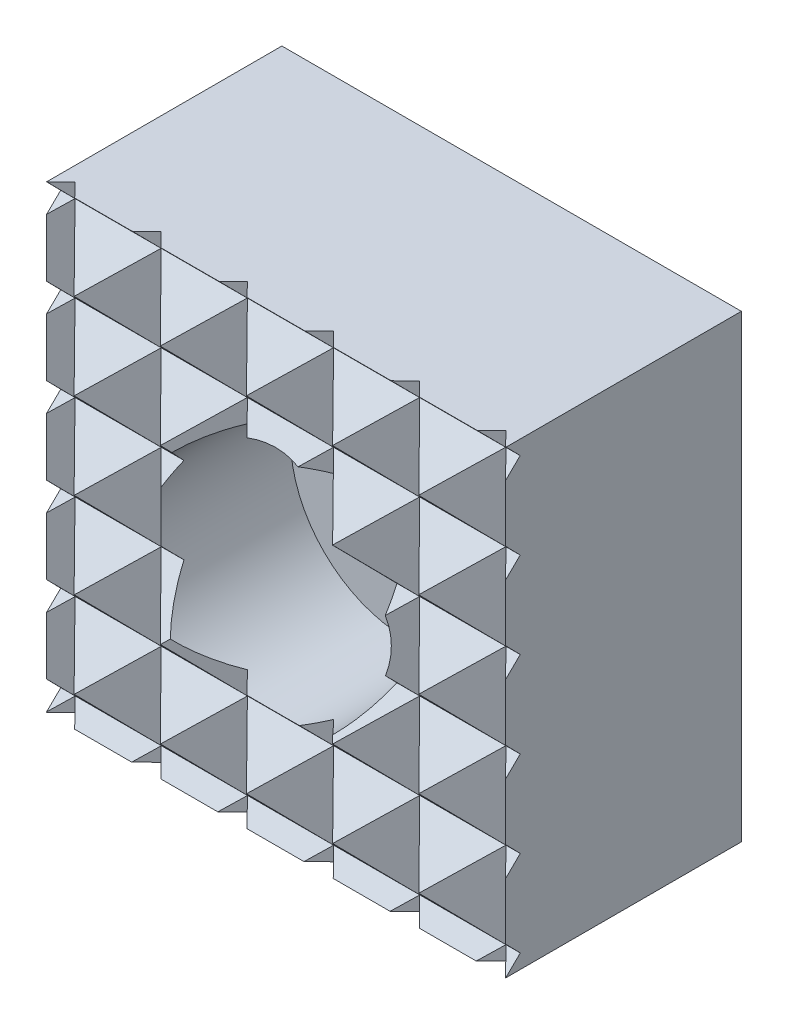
ISO-10303-21;
HEADER;
FILE_DESCRIPTION(('STEP AP214'),'2;1');
FILE_NAME('part.step','',(''),(''),'','','');
FILE_SCHEMA(('AUTOMOTIVE_DESIGN { 1 0 10303 214 1 1 1 1 }'));
ENDSEC;
DATA;
#1=APPLICATION_CONTEXT('core data for automotive mechanical design processes');
#2=APPLICATION_PROTOCOL_DEFINITION('international standard','automotive_design',2000,#1);
#3=PRODUCT_CONTEXT('',#1,'mechanical');
#4=PRODUCT('Part','Part','',(#3));
#5=PRODUCT_RELATED_PRODUCT_CATEGORY('part','',(#4));
#6=PRODUCT_DEFINITION_FORMATION('','',#4);
#7=PRODUCT_DEFINITION_CONTEXT('part definition',#1,'design');
#8=PRODUCT_DEFINITION('design','',#6,#7);
#9=PRODUCT_DEFINITION_SHAPE('','',#8);
#10=(LENGTH_UNIT() NAMED_UNIT(*) SI_UNIT(.MILLI.,.METRE.));
#11=(NAMED_UNIT(*) PLANE_ANGLE_UNIT() SI_UNIT($,.RADIAN.));
#12=(NAMED_UNIT(*) SI_UNIT($,.STERADIAN.) SOLID_ANGLE_UNIT());
#13=UNCERTAINTY_MEASURE_WITH_UNIT(LENGTH_MEASURE(1.E-05),#10,'distance_accuracy_value','');
#14=(GEOMETRIC_REPRESENTATION_CONTEXT(3) GLOBAL_UNCERTAINTY_ASSIGNED_CONTEXT((#13)) GLOBAL_UNIT_ASSIGNED_CONTEXT((#10,
#11,#12)) REPRESENTATION_CONTEXT('',''));
#15=CARTESIAN_POINT('',(0.,0.,0.));
#16=DIRECTION('',(0.,0.,1.));
#17=DIRECTION('',(1.,0.,0.));
#18=AXIS2_PLACEMENT_3D('',#15,#16,#17);
#19=CARTESIAN_POINT('',(8.,-8.,10.));
#20=DIRECTION('',(0.,0.,1.));
#21=DIRECTION('',(1.,0.,0.));
#22=AXIS2_PLACEMENT_3D('',#19,#20,#21);
#23=PLANE('',#22);
#24=DIRECTION('',(1.,0.,0.));
#25=VECTOR('',#24,1.);
#26=CARTESIAN_POINT('',(8.,6.0356448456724,10.));
#27=LINE('',#26,#25);
#28=CARTESIAN_POINT('',(-3.03488570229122,6.0356448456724,10.));
#29=VERTEX_POINT('',#28);
#30=CARTESIAN_POINT('',(-3.0333324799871,6.0356448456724,10.));
#31=VERTEX_POINT('',#30);
#32=EDGE_CURVE('E782',#29,#31,#27,.T.);
#33=ORIENTED_EDGE('',*,*,#32,.F.);
#34=DIRECTION('',(0.,1.,0.));
#35=VECTOR('',#34,1.);
#36=CARTESIAN_POINT('',(-3.03488570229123,-8.,10.));
#37=LINE('',#36,#35);
#38=CARTESIAN_POINT('',(-3.03488570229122,6.0325384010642,10.));
#39=VERTEX_POINT('',#38);
#40=EDGE_CURVE('E1187',#39,#29,#37,.T.);
#41=ORIENTED_EDGE('',*,*,#40,.F.);
#42=DIRECTION('',(-1.,0.,0.));
#43=VECTOR('',#42,1.);
#44=CARTESIAN_POINT('',(8.,6.0325384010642,10.));
#45=LINE('',#44,#43);
#46=CARTESIAN_POINT('',(-3.0333324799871,6.0325384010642,10.));
#47=VERTEX_POINT('',#46);
#48=EDGE_CURVE('E727',#47,#39,#45,.T.);
#49=ORIENTED_EDGE('',*,*,#48,.F.);
#50=DIRECTION('',(0.,-1.,0.));
#51=VECTOR('',#50,1.);
#52=CARTESIAN_POINT('',(-3.0333324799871,-8.,10.));
#53=LINE('',#52,#51);
#54=EDGE_CURVE('E1220',#31,#47,#53,.T.);
#55=ORIENTED_EDGE('',*,*,#54,.F.);
#56=EDGE_LOOP('',(#33,#41,#49,#55));
#57=FACE_BOUND('',#56,.T.);
#58=ADVANCED_FACE('F15',(#57),#23,.T.);
#59=DIRECTION('',(1.,0.,0.));
#60=VECTOR('',#59,1.);
#61=CARTESIAN_POINT('',(8.,6.0356448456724,10.));
#62=LINE('',#61,#60);
#63=CARTESIAN_POINT('',(-6.03564484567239,6.0356448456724,10.));
#64=VERTEX_POINT('',#63);
#65=CARTESIAN_POINT('',(-6.03253840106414,6.0356448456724,10.));
#66=VERTEX_POINT('',#65);
#67=EDGE_CURVE('E762',#64,#66,#62,.T.);
#68=ORIENTED_EDGE('',*,*,#67,.F.);
#69=DIRECTION('',(0.,1.,0.));
#70=VECTOR('',#69,1.);
#71=CARTESIAN_POINT('',(-6.03564484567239,-8.,10.));
#72=LINE('',#71,#70);
#73=CARTESIAN_POINT('',(-6.03564484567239,6.0325384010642,10.));
#74=VERTEX_POINT('',#73);
#75=EDGE_CURVE('E1232',#74,#64,#72,.T.);
#76=ORIENTED_EDGE('',*,*,#75,.F.);
#77=DIRECTION('',(-1.,0.,0.));
#78=VECTOR('',#77,1.);
#79=CARTESIAN_POINT('',(8.,6.0325384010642,10.));
#80=LINE('',#79,#78);
#81=CARTESIAN_POINT('',(-6.03253840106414,6.0325384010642,10.));
#82=VERTEX_POINT('',#81);
#83=EDGE_CURVE('E657',#82,#74,#80,.T.);
#84=ORIENTED_EDGE('',*,*,#83,.F.);
#85=DIRECTION('',(0.,-1.,0.));
#86=VECTOR('',#85,1.);
#87=CARTESIAN_POINT('',(-6.03253840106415,-8.,10.));
#88=LINE('',#87,#86);
#89=EDGE_CURVE('E1228',#66,#82,#88,.T.);
#90=ORIENTED_EDGE('',*,*,#89,.F.);
#91=EDGE_LOOP('',(#68,#76,#84,#90));
#92=FACE_BOUND('',#91,.T.);
#93=ADVANCED_FACE('F1596',(#92),#23,.T.);
#94=CARTESIAN_POINT('',(-4.5,-10.,8.50155282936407));
#95=DIRECTION('',(0.715014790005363,0.,-0.699109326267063));
#96=DIRECTION('',(-0.699109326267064,0.,-0.715014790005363));
#97=AXIS2_PLACEMENT_3D('',#94,#95,#96);
#98=PLANE('',#97);
#99=DIRECTION('',(0.,1.,0.));
#100=VECTOR('',#99,1.);
#101=CARTESIAN_POINT('',(-4.5,-10.,8.50155282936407));
#102=LINE('',#101,#100);
#103=CARTESIAN_POINT('',(-4.5,1.50079407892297,8.50155282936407));
#104=VERTEX_POINT('',#103);
#105=CARTESIAN_POINT('',(-4.49999999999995,4.5,8.50155282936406));
#106=VERTEX_POINT('',#105);
#107=EDGE_CURVE('E1626',#104,#106,#102,.T.);
#108=ORIENTED_EDGE('',*,*,#107,.F.);
#109=DIRECTION('',(0.564316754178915,0.590286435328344,0.577155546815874));
#110=VECTOR('',#109,1.);
#111=CARTESIAN_POINT('',(-8.33101255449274,-2.50652047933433,4.58338075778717));
#112=LINE('',#111,#110);
#113=CARTESIAN_POINT('',(-3.03488570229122,3.03333247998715,10.));
#114=VERTEX_POINT('',#113);
#115=EDGE_CURVE('E1116',#104,#114,#112,.T.);
#116=ORIENTED_EDGE('',*,*,#115,.T.);
#117=CARTESIAN_POINT('',(-3.03488570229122,3.03488570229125,10.));
#118=VERTEX_POINT('',#117);
#119=EDGE_CURVE('E1190',#114,#118,#37,.T.);
#120=ORIENTED_EDGE('',*,*,#119,.T.);
#121=DIRECTION('',(-0.572972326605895,0.572972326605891,-0.586008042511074));
#122=VECTOR('',#121,1.);
#123=CARTESIAN_POINT('',(0.260310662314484,-0.260310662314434,13.3701655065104));
#124=LINE('',#123,#122);
#125=EDGE_CURVE('E684',#118,#106,#124,.T.);
#126=ORIENTED_EDGE('',*,*,#125,.T.);
#127=EDGE_LOOP('',(#108,#116,#120,#126));
#128=FACE_BOUND('',#127,.T.);
#129=ADVANCED_FACE('F1603',(#128),#98,.F.);
#130=CARTESIAN_POINT('',(0.,0.,13.1039325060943));
#131=DIRECTION('',(0.715014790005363,0.,-0.699109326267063));
#132=DIRECTION('',(-0.699109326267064,0.,-0.715014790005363));
#133=AXIS2_PLACEMENT_3D('',#130,#131,#132);
#134=ELLIPSE('',#133,5.72156578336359,4.);
#135=CARTESIAN_POINT('',(-3.89805785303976,0.89729870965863,9.11718978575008));
#136=VERTEX_POINT('',#135);
#137=CARTESIAN_POINT('',(-3.90329301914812,-0.874244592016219,9.11183551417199));
#138=VERTEX_POINT('',#137);
#139=EDGE_CURVE('E1299',#136,#138,#134,.F.);
#140=ORIENTED_EDGE('',*,*,#139,.F.);
#141=DIRECTION('',(-0.572972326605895,0.572972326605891,-0.586008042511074));
#142=VECTOR('',#141,1.);
#143=CARTESIAN_POINT('',(-0.724830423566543,-2.27592871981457,12.3626114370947));
#144=LINE('',#143,#142);
#145=CARTESIAN_POINT('',(-4.5,1.49924085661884,8.50155282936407));
#146=VERTEX_POINT('',#145);
#147=EDGE_CURVE('E1103',#136,#146,#144,.T.);
#148=ORIENTED_EDGE('',*,*,#147,.T.);
#149=CARTESIAN_POINT('',(-4.5,-1.49841184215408,8.50155282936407));
#150=VERTEX_POINT('',#149);
#151=EDGE_CURVE('E1628',#150,#146,#102,.T.);
#152=ORIENTED_EDGE('',*,*,#151,.F.);
#153=DIRECTION('',(0.564316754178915,0.590286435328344,0.577155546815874));
#154=VECTOR('',#153,1.);
#155=CARTESIAN_POINT('',(-7.33195149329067,-4.46068886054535,5.60517149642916));
#156=LINE('',#155,#154);
#157=EDGE_CURVE('E1073',#150,#138,#156,.T.);
#158=ORIENTED_EDGE('',*,*,#157,.T.);
#159=EDGE_LOOP('',(#140,#148,#152,#158));
#160=FACE_BOUND('',#159,.T.);
#161=ADVANCED_FACE('F2332',(#160),#98,.F.);
#162=DIRECTION('',(-0.572972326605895,0.572972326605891,-0.586008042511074));
#163=VECTOR('',#162,1.);
#164=CARTESIAN_POINT('',(1.24545174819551,1.7553073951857,14.3777195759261));
#165=LINE('',#164,#163);
#166=CARTESIAN_POINT('',(-4.49924085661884,7.5,8.50232924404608));
#167=VERTEX_POINT('',#166);
#168=EDGE_CURVE('E784',#29,#167,#165,.T.);
#169=ORIENTED_EDGE('',*,*,#168,.T.);
#170=DIRECTION('',(0.564316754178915,0.590286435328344,0.577155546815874));
#171=VECTOR('',#170,1.);
#172=CARTESIAN_POINT('',(-10.3291346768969,1.40181628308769,2.53979928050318));
#173=LINE('',#172,#171);
#174=CARTESIAN_POINT('',(-4.021238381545,8.,8.9912067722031));
#175=VERTEX_POINT('',#174);
#176=EDGE_CURVE('E830',#167,#175,#173,.T.);
#177=ORIENTED_EDGE('',*,*,#176,.T.);
#178=DIRECTION('',(0.699109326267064,0.,0.715014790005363));
#179=VECTOR('',#178,1.);
#180=CARTESIAN_POINT('',(-5.46160443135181,8.,7.51807089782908));
#181=LINE('',#180,#179);
#182=CARTESIAN_POINT('',(-4.5,8.,8.50155282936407));
#183=VERTEX_POINT('',#182);
#184=EDGE_CURVE('E1191',#183,#175,#181,.T.);
#185=ORIENTED_EDGE('',*,*,#184,.F.);
#186=EDGE_CURVE('E1186',#106,#183,#102,.T.);
#187=ORIENTED_EDGE('',*,*,#186,.F.);
#188=DIRECTION('',(0.564316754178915,0.590286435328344,0.577155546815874));
#189=VECTOR('',#188,1.);
#190=CARTESIAN_POINT('',(-9.33007361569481,-0.552352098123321,3.56159001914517));
#191=LINE('',#190,#189);
#192=EDGE_CURVE('E724',#106,#39,#191,.T.);
#193=ORIENTED_EDGE('',*,*,#192,.T.);
#194=ORIENTED_EDGE('',*,*,#40,.T.);
#195=EDGE_LOOP('',(#169,#177,#185,#187,#193,#194));
#196=FACE_BOUND('',#195,.T.);
#197=ADVANCED_FACE('F1643',(#196),#98,.F.);
#198=CARTESIAN_POINT('',(-6.03412655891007,-10.,10.0015528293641));
#199=DIRECTION('',(-0.699109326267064,0.,-0.715014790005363));
#200=DIRECTION('',(-0.715014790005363,0.,0.699109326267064));
#201=AXIS2_PLACEMENT_3D('',#198,#199,#200);
#202=PLANE('',#201);
#203=CARTESIAN_POINT('',(-6.03253840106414,3.03488570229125,10.));
#204=VERTEX_POINT('',#203);
#205=CARTESIAN_POINT('',(-6.03253840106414,3.03333247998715,10.));
#206=VERTEX_POINT('',#205);
#207=EDGE_CURVE('E1225',#204,#206,#88,.T.);
#208=ORIENTED_EDGE('',*,*,#207,.T.);
#209=DIRECTION('',(0.581630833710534,-0.581630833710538,-0.568692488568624));
#210=VECTOR('',#209,1.);
#211=CARTESIAN_POINT('',(-1.62448555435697,-1.37472036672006,5.69000404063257));
#212=LINE('',#211,#210);
#213=EDGE_CURVE('E1113',#206,#104,#212,.T.);
#214=ORIENTED_EDGE('',*,*,#213,.T.);
#215=ORIENTED_EDGE('',*,*,#107,.T.);
#216=DIRECTION('',(-0.590286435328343,-0.564316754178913,0.577155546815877));
#217=VECTOR('',#216,1.);
#218=CARTESIAN_POINT('',(-10.3756523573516,-1.11715273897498,14.2465016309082));
#219=LINE('',#218,#217);
#220=EDGE_CURVE('E665',#106,#204,#219,.T.);
#221=ORIENTED_EDGE('',*,*,#220,.T.);
#222=EDGE_LOOP('',(#208,#214,#215,#221));
#223=FACE_BOUND('',#222,.T.);
#224=ADVANCED_FACE('F1624',(#223),#202,.F.);
#225=ORIENTED_EDGE('',*,*,#151,.T.);
#226=DIRECTION('',(-0.590286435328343,-0.564316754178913,0.577155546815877));
#227=VECTOR('',#226,1.);
#228=CARTESIAN_POINT('',(-9.37607390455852,-3.16230993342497,13.2691587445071));
#229=LINE('',#228,#227);
#230=CARTESIAN_POINT('',(-6.03253840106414,0.0341265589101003,10.));
#231=VERTEX_POINT('',#230);
#232=EDGE_CURVE('E1099',#146,#231,#229,.T.);
#233=ORIENTED_EDGE('',*,*,#232,.T.);
#234=DIRECTION('',(0.581630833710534,-0.581630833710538,-0.568692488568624));
#235=VECTOR('',#234,1.);
#236=CARTESIAN_POINT('',(-2.6391002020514,-3.35931164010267,6.68204864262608));
#237=LINE('',#236,#235);
#238=EDGE_CURVE('E1069',#231,#150,#237,.T.);
#239=ORIENTED_EDGE('',*,*,#238,.T.);
#240=EDGE_LOOP('',(#225,#233,#239));
#241=FACE_BOUND('',#240,.T.);
#242=ADVANCED_FACE('F2307',(#241),#202,.F.);
#243=DIRECTION('',(0.715014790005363,0.,-0.699109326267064));
#244=VECTOR('',#243,1.);
#245=CARTESIAN_POINT('',(-7.03839556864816,8.,10.983481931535));
#246=LINE('',#245,#244);
#247=CARTESIAN_POINT('',(-5.0007940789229,8.,8.9912067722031));
#248=VERTEX_POINT('',#247);
#249=EDGE_CURVE('E1326',#248,#183,#246,.T.);
#250=ORIENTED_EDGE('',*,*,#249,.F.);
#251=DIRECTION('',(0.581630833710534,-0.581630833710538,-0.568692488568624));
#252=VECTOR('',#251,1.);
#253=CARTESIAN_POINT('',(0.404743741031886,2.59446218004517,3.70591483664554));
#254=LINE('',#253,#252);
#255=CARTESIAN_POINT('',(-4.50079407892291,7.5,8.50232924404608));
#256=VERTEX_POINT('',#255);
#257=EDGE_CURVE('E810',#248,#256,#254,.T.);
#258=ORIENTED_EDGE('',*,*,#257,.T.);
#259=DIRECTION('',(-0.590286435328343,-0.564316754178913,0.577155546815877));
#260=VECTOR('',#259,1.);
#261=CARTESIAN_POINT('',(-11.3752308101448,0.928004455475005,15.2238445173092));
#262=LINE('',#261,#260);
#263=EDGE_CURVE('E764',#256,#66,#262,.T.);
#264=ORIENTED_EDGE('',*,*,#263,.T.);
#265=ORIENTED_EDGE('',*,*,#89,.T.);
#266=DIRECTION('',(0.581630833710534,-0.581630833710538,-0.568692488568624));
#267=VECTOR('',#266,1.);
#268=CARTESIAN_POINT('',(-0.60987090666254,0.60987090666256,4.69795943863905));
#269=LINE('',#268,#267);
#270=EDGE_CURVE('E721',#82,#106,#269,.T.);
#271=ORIENTED_EDGE('',*,*,#270,.T.);
#272=ORIENTED_EDGE('',*,*,#186,.T.);
#273=EDGE_LOOP('',(#250,#258,#264,#265,#271,#272));
#274=FACE_BOUND('',#273,.T.);
#275=ADVANCED_FACE('F1638',(#274),#202,.F.);
#276=CARTESIAN_POINT('',(2.96587344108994,-10.,9.99922358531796));
#277=DIRECTION('',(-0.699109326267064,0.,-0.715014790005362));
#278=DIRECTION('',(-0.715014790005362,0.,0.699109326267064));
#279=AXIS2_PLACEMENT_3D('',#276,#277,#278);
#280=PLANE('',#279);
#281=DIRECTION('',(0.,1.,0.));
#282=VECTOR('',#281,1.);
#283=CARTESIAN_POINT('',(2.96587344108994,-10.,9.99922358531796));
#284=LINE('',#283,#282);
#285=CARTESIAN_POINT('',(2.96587344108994,3.03253840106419,9.99922358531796));
#286=VERTEX_POINT('',#285);
#287=CARTESIAN_POINT('',(2.96587344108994,3.03564484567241,9.99922358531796));
#288=VERTEX_POINT('',#287);
#289=EDGE_CURVE('E1159',#286,#288,#284,.T.);
#290=ORIENTED_EDGE('',*,*,#289,.F.);
#291=DIRECTION('',(0.581630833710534,-0.581630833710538,-0.568692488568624));
#292=VECTOR('',#291,1.);
#293=CARTESIAN_POINT('',(7.37470854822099,-1.37629670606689,5.68846276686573));
#294=LINE('',#293,#292);
#295=CARTESIAN_POINT('',(4.49841184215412,1.5,8.50077641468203));
#296=VERTEX_POINT('',#295);
#297=EDGE_CURVE('E1143',#286,#296,#294,.T.);
#298=ORIENTED_EDGE('',*,*,#297,.T.);
#299=DIRECTION('',(-0.590286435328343,-0.564316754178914,0.577155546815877));
#300=VECTOR('',#299,1.);
#301=CARTESIAN_POINT('',(-0.376832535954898,-3.16075775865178,13.2675712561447));
#302=LINE('',#301,#300);
#303=CARTESIAN_POINT('',(3.89257038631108,0.920812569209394,9.09314096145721));
#304=VERTEX_POINT('',#303);
#305=EDGE_CURVE('E1093',#296,#304,#302,.T.);
#306=ORIENTED_EDGE('',*,*,#305,.T.);
#307=CARTESIAN_POINT('',(0.,0.,12.8991213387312));
#308=DIRECTION('',(-0.699109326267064,0.,-0.715014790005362));
#309=DIRECTION('',(0.715014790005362,0.,-0.699109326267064));
#310=AXIS2_PLACEMENT_3D('',#307,#308,#309);
#311=ELLIPSE('',#310,5.59428987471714,4.);
#312=CARTESIAN_POINT('',(3.89776704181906,-0.898561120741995,9.08805990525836));
#313=VERTEX_POINT('',#312);
#314=EDGE_CURVE('E1311',#313,#304,#311,.F.);
#315=ORIENTED_EDGE('',*,*,#314,.F.);
#316=DIRECTION('',(0.581630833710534,-0.581630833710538,-0.568692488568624));
#317=VECTOR('',#316,1.);
#318=CARTESIAN_POINT('',(6.36009390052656,-3.36088797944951,6.68050736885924));
#319=LINE('',#318,#317);
#320=CARTESIAN_POINT('',(4.49920592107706,-1.5,8.5));
#321=VERTEX_POINT('',#320);
#322=EDGE_CURVE('E1063',#313,#321,#319,.T.);
#323=ORIENTED_EDGE('',*,*,#322,.T.);
#324=DIRECTION('',(-0.590286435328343,-0.564316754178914,0.577155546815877));
#325=VECTOR('',#324,1.);
#326=CARTESIAN_POINT('',(0.622745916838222,-5.20591495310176,12.2902283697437));
#327=LINE('',#326,#325);
#328=CARTESIAN_POINT('',(2.96587344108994,-2.9658734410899,9.99922358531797));
#329=VERTEX_POINT('',#328);
#330=EDGE_CURVE('E1036',#321,#329,#327,.T.);
#331=ORIENTED_EDGE('',*,*,#330,.T.);
#332=DIRECTION('',(0.581630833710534,-0.581630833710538,-0.568692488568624));
#333=VECTOR('',#332,1.);
#334=CARTESIAN_POINT('',(5.34547925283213,-5.34547925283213,7.67255197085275));
#335=LINE('',#334,#333);
#336=CARTESIAN_POINT('',(4.5,-4.5,8.49922358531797));
#337=VERTEX_POINT('',#336);
#338=EDGE_CURVE('E978',#329,#337,#335,.T.);
#339=ORIENTED_EDGE('',*,*,#338,.T.);
#340=DIRECTION('',(0.,1.,0.));
#341=VECTOR('',#340,1.);
#342=CARTESIAN_POINT('',(4.5,-10.,8.49922358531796));
#343=LINE('',#342,#341);
#344=CARTESIAN_POINT('',(4.5,8.,8.49922358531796));
#345=VERTEX_POINT('',#344);
#346=EDGE_CURVE('E1167',#337,#345,#343,.T.);
#347=ORIENTED_EDGE('',*,*,#346,.T.);
#348=DIRECTION('',(0.715014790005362,0.,-0.699109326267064));
#349=VECTOR('',#348,1.);
#350=CARTESIAN_POINT('',(-2.64077524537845,8.,15.4811526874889));
#351=LINE('',#350,#349);
#352=CARTESIAN_POINT('',(3.99682368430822,8.,8.9912067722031));
#353=VERTEX_POINT('',#352);
#354=EDGE_CURVE('E1196',#353,#345,#351,.T.);
#355=ORIENTED_EDGE('',*,*,#354,.F.);
#356=DIRECTION('',(0.581630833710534,-0.581630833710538,-0.568692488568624));
#357=VECTOR('',#356,1.);
#358=CARTESIAN_POINT('',(9.40393784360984,2.59288584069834,3.7043735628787));
#359=LINE('',#358,#357);
#360=CARTESIAN_POINT('',(4.49682368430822,7.5,8.50232924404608));
#361=VERTEX_POINT('',#360);
#362=EDGE_CURVE('E843',#353,#361,#359,.T.);
#363=ORIENTED_EDGE('',*,*,#362,.T.);
#364=DIRECTION('',(-0.590286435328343,-0.564316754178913,0.577155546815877));
#365=VECTOR('',#364,1.);
#366=CARTESIAN_POINT('',(-2.37598944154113,0.929556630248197,15.2222570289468));
#367=LINE('',#366,#365);
#368=CARTESIAN_POINT('',(2.96587344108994,6.03640398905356,9.99922358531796));
#369=VERTEX_POINT('',#368);
#370=EDGE_CURVE('E796',#361,#369,#367,.T.);
#371=ORIENTED_EDGE('',*,*,#370,.T.);
#372=CARTESIAN_POINT('',(2.96587344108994,6.03174432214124,9.99922358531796));
#373=VERTEX_POINT('',#372);
#374=EDGE_CURVE('E1160',#373,#369,#284,.T.);
#375=ORIENTED_EDGE('',*,*,#374,.F.);
#376=DIRECTION('',(0.581630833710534,-0.581630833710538,-0.568692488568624));
#377=VECTOR('',#376,1.);
#378=CARTESIAN_POINT('',(8.38932319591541,0.608294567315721,4.69641816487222));
#379=LINE('',#378,#377);
#380=CARTESIAN_POINT('',(4.49761776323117,4.5,8.50155282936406));
#381=VERTEX_POINT('',#380);
#382=EDGE_CURVE('E753',#373,#381,#379,.T.);
#383=ORIENTED_EDGE('',*,*,#382,.T.);
#384=DIRECTION('',(-0.590286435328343,-0.564316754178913,0.577155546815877));
#385=VECTOR('',#384,1.);
#386=CARTESIAN_POINT('',(-1.37641098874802,-1.11560056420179,14.2449141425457));
#387=LINE('',#386,#385);
#388=EDGE_CURVE('E716',#381,#288,#387,.T.);
#389=ORIENTED_EDGE('',*,*,#388,.T.);
#390=EDGE_LOOP('',(#290,#298,#306,#315,#323,#331,#339,#347,#355,#363,#371,#375,#383,#389));
#391=FACE_BOUND('',#390,.T.);
#392=ADVANCED_FACE('F1466',(#391),#280,.F.);
#393=CARTESIAN_POINT('',(1.50000000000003,-10.,8.5));
#394=DIRECTION('',(0.715014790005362,0.,-0.699109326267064));
#395=DIRECTION('',(-0.699109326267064,0.,-0.715014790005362));
#396=AXIS2_PLACEMENT_3D('',#393,#394,#395);
#397=PLANE('',#396);
#398=DIRECTION('',(0.564316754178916,0.590286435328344,0.577155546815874));
#399=VECTOR('',#398,1.);
#400=CARTESIAN_POINT('',(-0.332361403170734,-6.41589202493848,6.62595047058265));
#401=LINE('',#400,#399);
#402=CARTESIAN_POINT('',(1.50000000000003,-4.49920592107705,8.5));
#403=VERTEX_POINT('',#402);
#404=EDGE_CURVE('E981',#403,#329,#401,.T.);
#405=ORIENTED_EDGE('',*,*,#404,.T.);
#406=DIRECTION('',(-0.572972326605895,0.57297232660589,-0.586008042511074));
#407=VECTOR('',#406,1.);
#408=CARTESIAN_POINT('',(4.29052693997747,-4.29052693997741,11.3540143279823));
#409=LINE('',#408,#407);
#410=CARTESIAN_POINT('',(2.82842712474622,-2.82842712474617,9.85865022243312));
#411=VERTEX_POINT('',#410);
#412=EDGE_CURVE('E1032',#329,#411,#409,.T.);
#413=ORIENTED_EDGE('',*,*,#412,.T.);
#414=CARTESIAN_POINT('',(0.,0.,6.96587344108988));
#415=DIRECTION('',(0.715014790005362,0.,-0.699109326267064));
#416=DIRECTION('',(-0.699109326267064,0.,-0.715014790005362));
#417=AXIS2_PLACEMENT_3D('',#414,#415,#416);
#418=ELLIPSE('',#417,5.72156578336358,4.);
#419=CARTESIAN_POINT('',(1.50000000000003,-3.70809924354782,8.5));
#420=VERTEX_POINT('',#419);
#421=EDGE_CURVE('E1316',#420,#411,#418,.F.);
#422=ORIENTED_EDGE('',*,*,#421,.F.);
#423=DIRECTION('',(0.,1.,0.));
#424=VECTOR('',#423,1.);
#425=CARTESIAN_POINT('',(1.50000000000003,-10.,8.5));
#426=LINE('',#425,#424);
#427=EDGE_CURVE('E1158',#403,#420,#426,.T.);
#428=ORIENTED_EDGE('',*,*,#427,.F.);
#429=EDGE_LOOP('',(#405,#413,#422,#428));
#430=FACE_BOUND('',#429,.T.);
#431=ADVANCED_FACE('F1556',(#430),#397,.F.);
#432=CARTESIAN_POINT('',(-0.0341265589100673,-10.,10.));
#433=DIRECTION('',(-0.699109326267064,0.,-0.715014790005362));
#434=DIRECTION('',(-0.715014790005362,0.,0.699109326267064));
#435=AXIS2_PLACEMENT_3D('',#432,#433,#434);
#436=PLANE('',#435);
#437=CARTESIAN_POINT('',(0.,0.,9.96663258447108));
#438=DIRECTION('',(-0.699109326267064,0.,-0.715014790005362));
#439=DIRECTION('',(0.715014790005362,0.,-0.699109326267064));
#440=AXIS2_PLACEMENT_3D('',#437,#438,#439);
#441=ELLIPSE('',#440,5.59428987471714,4.);
#442=CARTESIAN_POINT('',(0.898561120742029,-3.89776704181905,9.08805990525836));
#443=VERTEX_POINT('',#442);
#444=EDGE_CURVE('E1317',#443,#420,#441,.F.);
#445=ORIENTED_EDGE('',*,*,#444,.F.);
#446=DIRECTION('',(0.581630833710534,-0.581630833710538,-0.568692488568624));
#447=VECTOR('',#446,1.);
#448=CARTESIAN_POINT('',(2.34574788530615,-5.34495380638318,7.67306572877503));
#449=LINE('',#448,#447);
#450=EDGE_CURVE('E984',#443,#403,#449,.T.);
#451=ORIENTED_EDGE('',*,*,#450,.T.);
#452=ORIENTED_EDGE('',*,*,#427,.T.);
#453=EDGE_LOOP('',(#445,#451,#452));
#454=FACE_BOUND('',#453,.T.);
#455=ADVANCED_FACE('F1553',(#454),#436,.F.);
#456=CARTESIAN_POINT('',(-1.49999999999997,-10.,8.50077641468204));
#457=DIRECTION('',(0.715014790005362,0.,-0.699109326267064));
#458=DIRECTION('',(-0.699109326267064,0.,-0.715014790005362));
#459=AXIS2_PLACEMENT_3D('',#456,#457,#458);
#460=PLANE('',#459);
#461=DIRECTION('',(0.,1.,0.));
#462=VECTOR('',#461,1.);
#463=CARTESIAN_POINT('',(-1.49999999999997,-10.,8.50077641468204));
#464=LINE('',#463,#462);
#465=CARTESIAN_POINT('',(-1.49999999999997,-4.49841184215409,8.50077641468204));
#466=VERTEX_POINT('',#465);
#467=CARTESIAN_POINT('',(-1.49999999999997,-3.70809924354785,8.50077641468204));
#468=VERTEX_POINT('',#467);
#469=EDGE_CURVE('E1149',#466,#468,#464,.T.);
#470=ORIENTED_EDGE('',*,*,#469,.F.);
#471=DIRECTION('',(0.564316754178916,0.590286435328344,0.577155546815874));
#472=VECTOR('',#471,1.);
#473=CARTESIAN_POINT('',(-3.33262591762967,-6.41537463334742,6.62645635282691));
#474=LINE('',#473,#472);
#475=CARTESIAN_POINT('',(-0.920812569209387,-3.89257038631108,9.09314096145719));
#476=VERTEX_POINT('',#475);
#477=EDGE_CURVE('E990',#466,#476,#474,.T.);
#478=ORIENTED_EDGE('',*,*,#477,.T.);
#479=CARTESIAN_POINT('',(0.,0.,10.0349029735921));
#480=DIRECTION('',(0.715014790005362,0.,-0.699109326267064));
#481=DIRECTION('',(-0.699109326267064,0.,-0.715014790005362));
#482=AXIS2_PLACEMENT_3D('',#479,#480,#481);
#483=ELLIPSE('',#482,5.72156578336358,4.);
#484=EDGE_CURVE('E1322',#468,#476,#483,.F.);
#485=ORIENTED_EDGE('',*,*,#484,.F.);
#486=EDGE_LOOP('',(#470,#478,#485));
#487=FACE_BOUND('',#486,.T.);
#488=ADVANCED_FACE('F1566',(#487),#460,.F.);
#489=CARTESIAN_POINT('',(-3.03412655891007,-10.,10.000776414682));
#490=DIRECTION('',(-0.699109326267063,0.,-0.715014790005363));
#491=DIRECTION('',(-0.715014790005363,0.,0.699109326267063));
#492=AXIS2_PLACEMENT_3D('',#489,#490,#491);
#493=PLANE('',#492);
#494=CARTESIAN_POINT('',(0.,0.,7.03414383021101));
#495=DIRECTION('',(-0.699109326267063,0.,-0.715014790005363));
#496=DIRECTION('',(0.715014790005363,0.,-0.699109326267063));
#497=AXIS2_PLACEMENT_3D('',#494,#495,#496);
#498=ELLIPSE('',#497,5.59428987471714,4.);
#499=CARTESIAN_POINT('',(-2.85776122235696,-2.79878559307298,9.82833431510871));
#500=VERTEX_POINT('',#499);
#501=EDGE_CURVE('E1323',#500,#468,#498,.F.);
#502=ORIENTED_EDGE('',*,*,#501,.F.);
#503=DIRECTION('',(-0.590286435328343,-0.564316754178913,0.577155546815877));
#504=VECTOR('',#503,1.);
#505=CARTESIAN_POINT('',(-5.37674832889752,-5.20694973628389,12.2912866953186));
#506=LINE('',#505,#504);
#507=CARTESIAN_POINT('',(-3.03253840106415,-2.9658734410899,9.99922358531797));
#508=VERTEX_POINT('',#507);
#509=EDGE_CURVE('E1026',#500,#508,#506,.T.);
#510=ORIENTED_EDGE('',*,*,#509,.T.);
#511=DIRECTION('',(0.581630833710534,-0.581630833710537,-0.568692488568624));
#512=VECTOR('',#511,1.);
#513=CARTESIAN_POINT('',(-0.653983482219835,-5.34442835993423,7.67357948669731));
#514=LINE('',#513,#512);
#515=EDGE_CURVE('E993',#508,#466,#514,.T.);
#516=ORIENTED_EDGE('',*,*,#515,.T.);
#517=ORIENTED_EDGE('',*,*,#469,.T.);
#518=EDGE_LOOP('',(#502,#510,#516,#517));
#519=FACE_BOUND('',#518,.T.);
#520=ADVANCED_FACE('F1594',(#519),#493,.F.);
#521=CARTESIAN_POINT('',(7.5,-10.,8.49844717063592));
#522=DIRECTION('',(0.715014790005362,0.,-0.699109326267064));
#523=DIRECTION('',(-0.699109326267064,0.,-0.715014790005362));
#524=AXIS2_PLACEMENT_3D('',#521,#522,#523);
#525=PLANE('',#524);
#526=DIRECTION('',(-0.572972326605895,0.57297232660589,-0.586008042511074));
#527=VECTOR('',#526,1.);
#528=CARTESIAN_POINT('',(11.2761664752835,-2.27388904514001,12.3605253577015));
#529=LINE('',#528,#527);
#530=CARTESIAN_POINT('',(8.,1.00227743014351,9.00982269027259));
#531=VERTEX_POINT('',#530);
#532=CARTESIAN_POINT('',(7.50227743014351,1.5,8.50077641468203));
#533=VERTEX_POINT('',#532);
#534=EDGE_CURVE('E1087',#531,#533,#529,.T.);
#535=ORIENTED_EDGE('',*,*,#534,.T.);
#536=DIRECTION('',(0.564316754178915,0.590286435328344,0.577155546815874));
#537=VECTOR('',#536,1.);
#538=CARTESIAN_POINT('',(3.67004550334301,-2.5085900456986,4.58135722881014));
#539=LINE('',#538,#537);
#540=CARTESIAN_POINT('',(8.,2.02062760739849,9.00982269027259));
#541=VERTEX_POINT('',#540);
#542=EDGE_CURVE('E1134',#533,#541,#539,.T.);
#543=ORIENTED_EDGE('',*,*,#542,.T.);
#544=DIRECTION('',(0.,-1.,0.));
#545=VECTOR('',#544,1.);
#546=CARTESIAN_POINT('',(8.,8.,9.00982269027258));
#547=LINE('',#546,#545);
#548=CARTESIAN_POINT('',(8.,4.00303657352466,9.00982269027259));
#549=VERTEX_POINT('',#548);
#550=EDGE_CURVE('E1737',#549,#541,#547,.T.);
#551=ORIENTED_EDGE('',*,*,#550,.F.);
#552=DIRECTION('',(-0.572972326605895,0.57297232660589,-0.586008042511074));
#553=VECTOR('',#552,1.);
#554=CARTESIAN_POINT('',(12.2613075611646,-0.258270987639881,13.3680794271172));
#555=LINE('',#554,#553);
#556=CARTESIAN_POINT('',(7.50303657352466,4.5,8.50155282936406));
#557=VERTEX_POINT('',#556);
#558=EDGE_CURVE('E698',#549,#557,#555,.T.);
#559=ORIENTED_EDGE('',*,*,#558,.T.);
#560=DIRECTION('',(0.564316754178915,0.590286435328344,0.577155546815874));
#561=VECTOR('',#560,1.);
#562=CARTESIAN_POINT('',(2.67098444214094,-0.554421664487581,3.55956649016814));
#563=LINE('',#562,#561);
#564=CARTESIAN_POINT('',(8.,5.01983352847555,9.00982269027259));
#565=VERTEX_POINT('',#564);
#566=EDGE_CURVE('E738',#557,#565,#563,.T.);
#567=ORIENTED_EDGE('',*,*,#566,.T.);
#568=CARTESIAN_POINT('',(8.,7.00379571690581,9.00982269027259));
#569=VERTEX_POINT('',#568);
#570=EDGE_CURVE('E1250',#569,#565,#547,.T.);
#571=ORIENTED_EDGE('',*,*,#570,.F.);
#572=DIRECTION('',(-0.572972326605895,0.57297232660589,-0.586008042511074));
#573=VECTOR('',#572,1.);
#574=CARTESIAN_POINT('',(13.2464486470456,1.75734706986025,14.375633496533));
#575=LINE('',#574,#573);
#576=CARTESIAN_POINT('',(7.5037957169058,7.5,8.50232924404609));
#577=VERTEX_POINT('',#576);
#578=EDGE_CURVE('E773',#569,#577,#575,.T.);
#579=ORIENTED_EDGE('',*,*,#578,.T.);
#580=DIRECTION('',(0.564316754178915,0.590286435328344,0.577155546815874));
#581=VECTOR('',#580,1.);
#582=CARTESIAN_POINT('',(1.67192338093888,1.39974671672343,2.53777575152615));
#583=LINE('',#582,#581);
#584=CARTESIAN_POINT('',(7.98179819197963,8.,8.9912067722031));
#585=VERTEX_POINT('',#584);
#586=EDGE_CURVE('E819',#577,#585,#583,.T.);
#587=ORIENTED_EDGE('',*,*,#586,.T.);
#588=DIRECTION('',(0.699109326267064,0.,0.715014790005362));
#589=VECTOR('',#588,1.);
#590=CARTESIAN_POINT('',(0.674901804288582,8.,1.51807089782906));
#591=LINE('',#590,#589);
#592=CARTESIAN_POINT('',(7.5,8.,8.49844717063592));
#593=VERTEX_POINT('',#592);
#594=EDGE_CURVE('E1334',#593,#585,#591,.T.);
#595=ORIENTED_EDGE('',*,*,#594,.F.);
#596=DIRECTION('',(0.,1.,0.));
#597=VECTOR('',#596,1.);
#598=CARTESIAN_POINT('',(7.5,-10.,8.49844717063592));
#599=LINE('',#598,#597);
#600=CARTESIAN_POINT('',(7.5,-7.5,8.49844717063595));
#601=VERTEX_POINT('',#600);
#602=EDGE_CURVE('E1176',#601,#593,#599,.T.);
#603=ORIENTED_EDGE('',*,*,#602,.F.);
#604=DIRECTION('',(0.564316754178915,0.590286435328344,0.577155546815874));
#605=VECTOR('',#604,1.);
#606=CARTESIAN_POINT('',(6.66722868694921,-8.37109518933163,7.64672944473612));
#607=LINE('',#606,#605);
#608=CARTESIAN_POINT('',(8.,-6.97699015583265,9.00982269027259));
#609=VERTEX_POINT('',#608);
#610=EDGE_CURVE('E903',#601,#609,#607,.T.);
#611=ORIENTED_EDGE('',*,*,#610,.T.);
#612=CARTESIAN_POINT('',(8.,-4.99924085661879,9.00982269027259));
#613=VERTEX_POINT('',#612);
#614=EDGE_CURVE('E1246',#613,#609,#547,.T.);
#615=ORIENTED_EDGE('',*,*,#614,.F.);
#616=DIRECTION('',(-0.572972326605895,0.572972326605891,-0.586008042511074));
#617=VECTOR('',#616,1.);
#618=CARTESIAN_POINT('',(9.30588430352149,-6.30512516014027,10.34541721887));
#619=LINE('',#618,#617);
#620=CARTESIAN_POINT('',(7.50075914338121,-4.5,8.49922358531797));
#621=VERTEX_POINT('',#620);
#622=EDGE_CURVE('E943',#613,#621,#619,.T.);
#623=ORIENTED_EDGE('',*,*,#622,.T.);
#624=DIRECTION('',(0.564316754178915,0.590286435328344,0.577155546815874));
#625=VECTOR('',#624,1.);
#626=CARTESIAN_POINT('',(5.66816762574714,-6.41692680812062,6.62493870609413));
#627=LINE('',#626,#625);
#628=CARTESIAN_POINT('',(8.,-3.9777842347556,9.00982269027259));
#629=VERTEX_POINT('',#628);
#630=EDGE_CURVE('E996',#621,#629,#627,.T.);
#631=ORIENTED_EDGE('',*,*,#630,.T.);
#632=CARTESIAN_POINT('',(8.,-1.99848171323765,9.00982269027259));
#633=VERTEX_POINT('',#632);
#634=EDGE_CURVE('E1249',#633,#629,#547,.T.);
#635=ORIENTED_EDGE('',*,*,#634,.F.);
#636=DIRECTION('',(-0.572972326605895,0.572972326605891,-0.586008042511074));
#637=VECTOR('',#636,1.);
#638=CARTESIAN_POINT('',(10.2910253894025,-4.28950710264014,11.3529712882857));
#639=LINE('',#638,#637);
#640=CARTESIAN_POINT('',(7.50151828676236,-1.5,8.5));
#641=VERTEX_POINT('',#640);
#642=EDGE_CURVE('E1020',#633,#641,#639,.T.);
#643=ORIENTED_EDGE('',*,*,#642,.T.);
#644=DIRECTION('',(0.564316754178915,0.590286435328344,0.577155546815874));
#645=VECTOR('',#644,1.);
#646=CARTESIAN_POINT('',(4.66910656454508,-4.4627584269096,5.60314796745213));
#647=LINE('',#646,#645);
#648=CARTESIAN_POINT('',(8.,-0.978578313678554,9.00982269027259));
#649=VERTEX_POINT('',#648);
#650=EDGE_CURVE('E1057',#641,#649,#647,.T.);
#651=ORIENTED_EDGE('',*,*,#650,.T.);
#652=EDGE_CURVE('E1738',#531,#649,#547,.T.);
#653=ORIENTED_EDGE('',*,*,#652,.F.);
#654=EDGE_LOOP('',(#535,#543,#551,#559,#567,#571,#579,#587,#595,#603,#611,#615,#623,#631,#635,
#643,#651,#653));
#655=FACE_BOUND('',#654,.T.);
#656=ADVANCED_FACE('F1480',(#655),#525,.F.);
#657=CARTESIAN_POINT('',(5.96587344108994,-10.,9.99844717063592));
#658=DIRECTION('',(-0.699109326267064,0.,-0.715014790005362));
#659=DIRECTION('',(-0.715014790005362,0.,0.699109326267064));
#660=AXIS2_PLACEMENT_3D('',#657,#658,#659);
#661=PLANE('',#660);
#662=DIRECTION('',(0.,1.,0.));
#663=VECTOR('',#662,1.);
#664=CARTESIAN_POINT('',(5.96587344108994,-10.,9.99844717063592));
#665=LINE('',#664,#663);
#666=CARTESIAN_POINT('',(5.96587344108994,3.03174432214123,9.99844717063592));
#667=VERTEX_POINT('',#666);
#668=CARTESIAN_POINT('',(5.96587344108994,3.03640398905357,9.99844717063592));
#669=VERTEX_POINT('',#668);
#670=EDGE_CURVE('E1171',#667,#669,#665,.T.);
#671=ORIENTED_EDGE('',*,*,#670,.F.);
#672=DIRECTION('',(0.581630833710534,-0.581630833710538,-0.568692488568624));
#673=VECTOR('',#672,1.);
#674=CARTESIAN_POINT('',(10.374439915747,-1.37682215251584,5.68794900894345));
#675=LINE('',#674,#673);
#676=CARTESIAN_POINT('',(7.49761776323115,1.5,8.50077641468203));
#677=VERTEX_POINT('',#676);
#678=EDGE_CURVE('E1131',#667,#677,#675,.T.);
#679=ORIENTED_EDGE('',*,*,#678,.T.);
#680=DIRECTION('',(-0.590286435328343,-0.564316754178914,0.577155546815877));
#681=VECTOR('',#680,1.);
#682=CARTESIAN_POINT('',(2.62291458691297,-3.16024036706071,13.2670420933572));
#683=LINE('',#682,#681);
#684=CARTESIAN_POINT('',(5.96587344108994,0.035644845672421,9.99844717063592));
#685=VERTEX_POINT('',#684);
#686=EDGE_CURVE('E1084',#677,#685,#683,.T.);
#687=ORIENTED_EDGE('',*,*,#686,.T.);
#688=CARTESIAN_POINT('',(5.96587344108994,0.032538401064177,9.99844717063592));
#689=VERTEX_POINT('',#688);
#690=EDGE_CURVE('E2748',#689,#685,#665,.T.);
#691=ORIENTED_EDGE('',*,*,#690,.F.);
#692=DIRECTION('',(0.581630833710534,-0.581630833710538,-0.568692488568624));
#693=VECTOR('',#692,1.);
#694=CARTESIAN_POINT('',(9.35982526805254,-3.36141342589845,6.67999361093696));
#695=LINE('',#694,#693);
#696=CARTESIAN_POINT('',(7.4984118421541,-1.5,8.5));
#697=VERTEX_POINT('',#696);
#698=EDGE_CURVE('E1054',#689,#697,#695,.T.);
#699=ORIENTED_EDGE('',*,*,#698,.T.);
#700=DIRECTION('',(-0.590286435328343,-0.564316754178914,0.577155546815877));
#701=VECTOR('',#700,1.);
#702=CARTESIAN_POINT('',(3.62249303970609,-5.2053975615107,12.2896992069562));
#703=LINE('',#702,#701);
#704=CARTESIAN_POINT('',(5.96587344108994,-2.96511429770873,9.99844717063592));
#705=VERTEX_POINT('',#704);
#706=EDGE_CURVE('E1017',#697,#705,#703,.T.);
#707=ORIENTED_EDGE('',*,*,#706,.T.);
#708=CARTESIAN_POINT('',(5.96587344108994,-2.96666752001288,9.99844717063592));
#709=VERTEX_POINT('',#708);
#710=EDGE_CURVE('E1173',#709,#705,#665,.T.);
#711=ORIENTED_EDGE('',*,*,#710,.F.);
#712=DIRECTION('',(0.581630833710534,-0.581630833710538,-0.568692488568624));
#713=VECTOR('',#712,1.);
#714=CARTESIAN_POINT('',(8.34521062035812,-5.34600469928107,7.67203821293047));
#715=LINE('',#714,#713);
#716=CARTESIAN_POINT('',(7.49920592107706,-4.5,8.49922358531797));
#717=VERTEX_POINT('',#716);
#718=EDGE_CURVE('E976',#709,#717,#715,.T.);
#719=ORIENTED_EDGE('',*,*,#718,.T.);
#720=DIRECTION('',(-0.590286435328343,-0.564316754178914,0.577155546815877));
#721=VECTOR('',#720,1.);
#722=CARTESIAN_POINT('',(4.62207149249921,-7.25055475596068,11.3123563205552));
#723=LINE('',#722,#721);
#724=CARTESIAN_POINT('',(5.96587344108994,-5.96587344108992,9.99844717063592));
#725=VERTEX_POINT('',#724);
#726=EDGE_CURVE('E38',#717,#725,#723,.T.);
#727=ORIENTED_EDGE('',*,*,#726,.T.);
#728=DIRECTION('',(0.581630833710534,-0.581630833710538,-0.568692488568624));
#729=VECTOR('',#728,1.);
#730=CARTESIAN_POINT('',(7.33059597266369,-7.33059597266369,8.66408281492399));
#731=LINE('',#730,#729);
#732=EDGE_CURVE('E901',#725,#601,#731,.T.);
#733=ORIENTED_EDGE('',*,*,#732,.T.);
#734=ORIENTED_EDGE('',*,*,#602,.T.);
#735=DIRECTION('',(0.715014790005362,0.,-0.699109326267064));
#736=VECTOR('',#735,1.);
#737=CARTESIAN_POINT('',(-1.17490180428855,8.,16.9803762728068));
#738=LINE('',#737,#736);
#739=CARTESIAN_POINT('',(6.99602960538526,8.,8.9912067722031));
#740=VERTEX_POINT('',#739);
#741=EDGE_CURVE('E1337',#740,#593,#738,.T.);
#742=ORIENTED_EDGE('',*,*,#741,.F.);
#743=DIRECTION('',(0.581630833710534,-0.581630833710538,-0.568692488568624));
#744=VECTOR('',#743,1.);
#745=CARTESIAN_POINT('',(12.4036692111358,2.5923603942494,3.70385980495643));
#746=LINE('',#745,#744);
#747=CARTESIAN_POINT('',(7.49602960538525,7.5,8.50232924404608));
#748=VERTEX_POINT('',#747);
#749=EDGE_CURVE('E816',#740,#748,#746,.T.);
#750=ORIENTED_EDGE('',*,*,#749,.T.);
#751=DIRECTION('',(-0.590286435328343,-0.564316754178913,0.577155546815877));
#752=VECTOR('',#751,1.);
#753=CARTESIAN_POINT('',(0.623757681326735,0.930074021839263,15.2217278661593));
#754=LINE('',#753,#752);
#755=CARTESIAN_POINT('',(5.96587344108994,6.03716313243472,9.99844717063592));
#756=VERTEX_POINT('',#755);
#757=EDGE_CURVE('E770',#748,#756,#754,.T.);
#758=ORIENTED_EDGE('',*,*,#757,.T.);
#759=CARTESIAN_POINT('',(5.96587344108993,6.03095024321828,9.99844717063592));
#760=VERTEX_POINT('',#759);
#761=EDGE_CURVE('E1168',#760,#756,#665,.T.);
#762=ORIENTED_EDGE('',*,*,#761,.F.);
#763=DIRECTION('',(0.581630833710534,-0.581630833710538,-0.568692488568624));
#764=VECTOR('',#763,1.);
#765=CARTESIAN_POINT('',(11.3890545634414,0.607769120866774,4.69590440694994));
#766=LINE('',#765,#764);
#767=CARTESIAN_POINT('',(7.4968236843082,4.5,8.50155282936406));
#768=VERTEX_POINT('',#767);
#769=EDGE_CURVE('E735',#760,#768,#766,.T.);
#770=ORIENTED_EDGE('',*,*,#769,.T.);
#771=DIRECTION('',(-0.590286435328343,-0.564316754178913,0.577155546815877));
#772=VECTOR('',#771,1.);
#773=CARTESIAN_POINT('',(1.62333613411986,-1.11508317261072,14.2443849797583));
#774=LINE('',#773,#772);
#775=EDGE_CURVE('E695',#768,#669,#774,.T.);
#776=ORIENTED_EDGE('',*,*,#775,.T.);
#777=EDGE_LOOP('',(#671,#679,#687,#691,#699,#707,#711,#719,#727,#733,#734,#742,#750,#758,#762,
#770,#776));
#778=FACE_BOUND('',#777,.T.);
#779=ADVANCED_FACE('F1476',(#778),#661,.F.);
#780=CARTESIAN_POINT('',(4.5,-10.,8.49922358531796));
#781=DIRECTION('',(0.715014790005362,0.,-0.699109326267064));
#782=DIRECTION('',(-0.699109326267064,0.,-0.715014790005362));
#783=AXIS2_PLACEMENT_3D('',#780,#781,#782);
#784=PLANE('',#783);
#785=DIRECTION('',(-0.572972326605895,0.57297232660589,-0.586008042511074));
#786=VECTOR('',#785,1.);
#787=CARTESIAN_POINT('',(8.27591725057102,-2.27439896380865,12.3610468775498));
#788=LINE('',#787,#786);
#789=CARTESIAN_POINT('',(4.50151828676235,1.5,8.50077641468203));
#790=VERTEX_POINT('',#789);
#791=EDGE_CURVE('E1081',#685,#790,#788,.T.);
#792=ORIENTED_EDGE('',*,*,#791,.T.);
#793=DIRECTION('',(0.564316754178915,0.590286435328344,0.577155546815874));
#794=VECTOR('',#793,1.);
#795=CARTESIAN_POINT('',(0.669780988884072,-2.50807265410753,4.58186311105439));
#796=LINE('',#795,#794);
#797=EDGE_CURVE('E1127',#790,#667,#796,.T.);
#798=ORIENTED_EDGE('',*,*,#797,.T.);
#799=ORIENTED_EDGE('',*,*,#670,.T.);
#800=DIRECTION('',(-0.572972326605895,0.57297232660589,-0.586008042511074));
#801=VECTOR('',#800,1.);
#802=CARTESIAN_POINT('',(9.26105833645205,-0.25878090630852,13.3686009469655));
#803=LINE('',#802,#801);
#804=CARTESIAN_POINT('',(4.5022774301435,4.5,8.50155282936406));
#805=VERTEX_POINT('',#804);
#806=EDGE_CURVE('E692',#669,#805,#803,.T.);
#807=ORIENTED_EDGE('',*,*,#806,.T.);
#808=DIRECTION('',(0.564316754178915,0.590286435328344,0.577155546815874));
#809=VECTOR('',#808,1.);
#810=CARTESIAN_POINT('',(-0.329280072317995,-0.553904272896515,3.5600723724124));
#811=LINE('',#810,#809);
#812=EDGE_CURVE('E732',#805,#760,#811,.T.);
#813=ORIENTED_EDGE('',*,*,#812,.T.);
#814=ORIENTED_EDGE('',*,*,#761,.T.);
#815=DIRECTION('',(-0.572972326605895,0.57297232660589,-0.586008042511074));
#816=VECTOR('',#815,1.);
#817=CARTESIAN_POINT('',(10.2461994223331,1.75683715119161,14.3761550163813));
#818=LINE('',#817,#816);
#819=CARTESIAN_POINT('',(4.50303657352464,7.5,8.50232924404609));
#820=VERTEX_POINT('',#819);
#821=EDGE_CURVE('E767',#756,#820,#818,.T.);
#822=ORIENTED_EDGE('',*,*,#821,.T.);
#823=DIRECTION('',(0.564316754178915,0.590286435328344,0.577155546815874));
#824=VECTOR('',#823,1.);
#825=CARTESIAN_POINT('',(-1.32834113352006,1.4002641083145,2.53828163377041));
#826=LINE('',#825,#824);
#827=CARTESIAN_POINT('',(4.98103904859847,8.,8.9912067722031));
#828=VERTEX_POINT('',#827);
#829=EDGE_CURVE('E813',#820,#828,#826,.T.);
#830=ORIENTED_EDGE('',*,*,#829,.T.);
#831=DIRECTION('',(0.699109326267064,0.,0.715014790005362));
#832=VECTOR('',#831,1.);
#833=CARTESIAN_POINT('',(-0.859224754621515,8.,3.01807089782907));
#834=LINE('',#833,#832);
#835=EDGE_CURVE('E1339',#345,#828,#834,.T.);
#836=ORIENTED_EDGE('',*,*,#835,.F.);
#837=ORIENTED_EDGE('',*,*,#346,.F.);
#838=DIRECTION('',(0.564316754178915,0.590286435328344,0.577155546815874));
#839=VECTOR('',#838,1.);
#840=CARTESIAN_POINT('',(2.6679031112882,-6.41640941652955,6.62544458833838));
#841=LINE('',#840,#839);
#842=EDGE_CURVE('E973',#337,#709,#841,.T.);
#843=ORIENTED_EDGE('',*,*,#842,.T.);
#844=ORIENTED_EDGE('',*,*,#710,.T.);
#845=DIRECTION('',(-0.572972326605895,0.572972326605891,-0.586008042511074));
#846=VECTOR('',#845,1.);
#847=CARTESIAN_POINT('',(7.29077616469,-4.29001702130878,11.353492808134));
#848=LINE('',#847,#846);
#849=CARTESIAN_POINT('',(4.5007591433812,-1.5,8.5));
#850=VERTEX_POINT('',#849);
#851=EDGE_CURVE('E1014',#705,#850,#848,.T.);
#852=ORIENTED_EDGE('',*,*,#851,.T.);
#853=DIRECTION('',(0.564316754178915,0.590286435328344,0.577155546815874));
#854=VECTOR('',#853,1.);
#855=CARTESIAN_POINT('',(1.66884205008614,-4.46224103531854,5.60365384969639));
#856=LINE('',#855,#854);
#857=EDGE_CURVE('E1051',#850,#689,#856,.T.);
#858=ORIENTED_EDGE('',*,*,#857,.T.);
#859=ORIENTED_EDGE('',*,*,#690,.T.);
#860=EDGE_LOOP('',(#792,#798,#799,#807,#813,#814,#822,#830,#836,#837,#843,#844,#852,#858,#859));
#861=FACE_BOUND('',#860,.T.);
#862=ADVANCED_FACE('F1471',(#861),#784,.F.);
#863=CARTESIAN_POINT('',(-9.03412655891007,-10.,10.0023292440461));
#864=DIRECTION('',(-0.699109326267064,0.,-0.715014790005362));
#865=DIRECTION('',(-0.715014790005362,0.,0.699109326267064));
#866=AXIS2_PLACEMENT_3D('',#863,#864,#865);
#867=PLANE('',#866);
#868=DIRECTION('',(0.,1.,0.));
#869=VECTOR('',#868,1.);
#870=CARTESIAN_POINT('',(-8.,8.,8.99120677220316));
#871=LINE('',#870,#869);
#872=CARTESIAN_POINT('',(-8.,2.00158815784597,8.99120677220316));
#873=VERTEX_POINT('',#872);
#874=CARTESIAN_POINT('',(-8.,4.02123838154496,8.99120677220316));
#875=VERTEX_POINT('',#874);
#876=EDGE_CURVE('E675',#873,#875,#871,.T.);
#877=ORIENTED_EDGE('',*,*,#876,.F.);
#878=DIRECTION('',(0.581630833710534,-0.581630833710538,-0.568692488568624));
#879=VECTOR('',#878,1.);
#880=CARTESIAN_POINT('',(-4.62421692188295,-1.37419492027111,5.69051779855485));
#881=LINE('',#880,#879);
#882=CARTESIAN_POINT('',(-7.5,1.50158815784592,8.50232924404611));
#883=VERTEX_POINT('',#882);
#884=EDGE_CURVE('E1106',#873,#883,#881,.T.);
#885=ORIENTED_EDGE('',*,*,#884,.T.);
#886=DIRECTION('',(0.,1.,0.));
#887=VECTOR('',#886,1.);
#888=CARTESIAN_POINT('',(-7.5,-10.,8.50232924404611));
#889=LINE('',#888,#887);
#890=CARTESIAN_POINT('',(-7.5,4.49924085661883,8.50232924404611));
#891=VERTEX_POINT('',#890);
#892=EDGE_CURVE('E1385',#883,#891,#889,.T.);
#893=ORIENTED_EDGE('',*,*,#892,.T.);
#894=DIRECTION('',(-0.590286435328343,-0.564316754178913,0.577155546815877));
#895=VECTOR('',#894,1.);
#896=CARTESIAN_POINT('',(-13.3753994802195,-1.11767013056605,14.2470307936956));
#897=LINE('',#896,#895);
#898=EDGE_CURVE('E677',#891,#875,#897,.T.);
#899=ORIENTED_EDGE('',*,*,#898,.T.);
#900=EDGE_LOOP('',(#877,#885,#893,#899));
#901=FACE_BOUND('',#900,.T.);
#902=ADVANCED_FACE('F1939',(#901),#867,.F.);
#903=CARTESIAN_POINT('',(-7.5,-1.49761776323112,8.50232924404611));
#904=VERTEX_POINT('',#903);
#905=CARTESIAN_POINT('',(-7.5,1.49848171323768,8.50232924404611));
#906=VERTEX_POINT('',#905);
#907=EDGE_CURVE('E1376',#904,#906,#889,.T.);
#908=ORIENTED_EDGE('',*,*,#907,.T.);
#909=DIRECTION('',(-0.590286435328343,-0.564316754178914,0.577155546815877));
#910=VECTOR('',#909,1.);
#911=CARTESIAN_POINT('',(-12.3758210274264,-3.16282732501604,13.2696879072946));
#912=LINE('',#911,#910);
#913=CARTESIAN_POINT('',(-8.,1.02047923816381,8.99120677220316));
#914=VERTEX_POINT('',#913);
#915=EDGE_CURVE('E1076',#906,#914,#912,.T.);
#916=ORIENTED_EDGE('',*,*,#915,.T.);
#917=CARTESIAN_POINT('',(-8.,-0.997617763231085,8.99120677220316));
#918=VERTEX_POINT('',#917);
#919=EDGE_CURVE('E2725',#918,#914,#871,.T.);
#920=ORIENTED_EDGE('',*,*,#919,.F.);
#921=DIRECTION('',(0.581630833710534,-0.581630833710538,-0.568692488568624));
#922=VECTOR('',#921,1.);
#923=CARTESIAN_POINT('',(-5.63883156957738,-3.35878619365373,6.68256240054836));
#924=LINE('',#923,#922);
#925=EDGE_CURVE('E1045',#918,#904,#924,.T.);
#926=ORIENTED_EDGE('',*,*,#925,.T.);
#927=EDGE_LOOP('',(#908,#916,#920,#926));
#928=FACE_BOUND('',#927,.T.);
#929=ADVANCED_FACE('F1381',(#928),#867,.F.);
#930=CARTESIAN_POINT('',(-7.5,-4.49682368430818,8.50232924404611));
#931=VERTEX_POINT('',#930);
#932=CARTESIAN_POINT('',(-7.5,-1.50227743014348,8.50232924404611));
#933=VERTEX_POINT('',#932);
#934=EDGE_CURVE('E1384',#931,#933,#889,.T.);
#935=ORIENTED_EDGE('',*,*,#934,.T.);
#936=DIRECTION('',(-0.590286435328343,-0.564316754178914,0.577155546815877));
#937=VECTOR('',#936,1.);
#938=CARTESIAN_POINT('',(-11.3762425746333,-5.20798451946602,12.2923450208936));
#939=LINE('',#938,#937);
#940=CARTESIAN_POINT('',(-8.,-1.98027990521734,8.99120677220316));
#941=VERTEX_POINT('',#940);
#942=EDGE_CURVE('E1008',#933,#941,#939,.T.);
#943=ORIENTED_EDGE('',*,*,#942,.T.);
#944=CARTESIAN_POINT('',(-8.,-3.99682368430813,8.99120677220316));
#945=VERTEX_POINT('',#944);
#946=EDGE_CURVE('E2727',#945,#941,#871,.T.);
#947=ORIENTED_EDGE('',*,*,#946,.F.);
#948=DIRECTION('',(0.581630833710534,-0.581630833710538,-0.568692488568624));
#949=VECTOR('',#948,1.);
#950=CARTESIAN_POINT('',(-6.6534462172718,-5.34337746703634,7.67460700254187));
#951=LINE('',#950,#949);
#952=EDGE_CURVE('E967',#945,#931,#951,.T.);
#953=ORIENTED_EDGE('',*,*,#952,.T.);
#954=EDGE_LOOP('',(#935,#943,#947,#953));
#955=FACE_BOUND('',#954,.T.);
#956=ADVANCED_FACE('F2221',(#955),#867,.F.);
#957=CARTESIAN_POINT('',(-7.5,-7.49602960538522,8.50232924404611));
#958=VERTEX_POINT('',#957);
#959=CARTESIAN_POINT('',(-7.5,-4.50303657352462,8.50232924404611));
#960=VERTEX_POINT('',#959);
#961=EDGE_CURVE('E1180',#958,#960,#889,.T.);
#962=ORIENTED_EDGE('',*,*,#961,.T.);
#963=DIRECTION('',(-0.590286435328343,-0.564316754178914,0.577155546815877));
#964=VECTOR('',#963,1.);
#965=CARTESIAN_POINT('',(-10.3766641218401,-7.25314171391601,11.3150021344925));
#966=LINE('',#965,#964);
#967=CARTESIAN_POINT('',(-8.,-4.98103904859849,8.99120677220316));
#968=VERTEX_POINT('',#967);
#969=EDGE_CURVE('E930',#960,#968,#966,.T.);
#970=ORIENTED_EDGE('',*,*,#969,.T.);
#971=CARTESIAN_POINT('',(-8.,-6.99602960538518,8.99120677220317));
#972=VERTEX_POINT('',#971);
#973=EDGE_CURVE('E1243',#972,#968,#871,.T.);
#974=ORIENTED_EDGE('',*,*,#973,.F.);
#975=DIRECTION('',(0.581630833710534,-0.581630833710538,-0.568692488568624));
#976=VECTOR('',#975,1.);
#977=CARTESIAN_POINT('',(-7.66806086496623,-7.32796874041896,8.66665160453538));
#978=LINE('',#977,#976);
#979=EDGE_CURVE('E892',#972,#958,#978,.T.);
#980=ORIENTED_EDGE('',*,*,#979,.T.);
#981=EDGE_LOOP('',(#962,#970,#974,#980));
#982=FACE_BOUND('',#981,.T.);
#983=ADVANCED_FACE('F2213',(#982),#867,.F.);
#984=DIRECTION('',(0.715014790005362,0.,-0.699109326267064));
#985=VECTOR('',#984,1.);
#986=CARTESIAN_POINT('',(-8.50426900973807,8.,9.48425834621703));
#987=LINE('',#986,#985);
#988=CARTESIAN_POINT('',(-8.,8.,8.9912067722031));
#989=VERTEX_POINT('',#988);
#990=CARTESIAN_POINT('',(-7.5,8.,8.50232924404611));
#991=VERTEX_POINT('',#990);
#992=EDGE_CURVE('E1331',#989,#991,#987,.T.);
#993=ORIENTED_EDGE('',*,*,#992,.F.);
#994=DIRECTION('',(0.581630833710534,-0.581630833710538,-0.568692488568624));
#995=VECTOR('',#994,1.);
#996=CARTESIAN_POINT('',(-2.5949876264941,2.59498762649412,3.70642859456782));
#997=LINE('',#996,#995);
#998=CARTESIAN_POINT('',(-7.5,7.5,8.50232924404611));
#999=VERTEX_POINT('',#998);
#1000=EDGE_CURVE('E799',#989,#999,#997,.T.);
#1001=ORIENTED_EDGE('',*,*,#1000,.T.);
#1002=EDGE_CURVE('E1181',#999,#991,#889,.T.);
#1003=ORIENTED_EDGE('',*,*,#1002,.T.);
#1004=EDGE_LOOP('',(#993,#1001,#1003));
#1005=FACE_BOUND('',#1004,.T.);
#1006=ADVANCED_FACE('F1398',(#1005),#867,.F.);
#1007=CARTESIAN_POINT('',(-7.5,4.50079407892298,8.50232924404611));
#1008=VERTEX_POINT('',#1007);
#1009=EDGE_CURVE('E1388',#1008,#999,#889,.T.);
#1010=ORIENTED_EDGE('',*,*,#1009,.T.);
#1011=DIRECTION('',(-0.590286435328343,-0.564316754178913,0.577155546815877));
#1012=VECTOR('',#1011,1.);
#1013=CARTESIAN_POINT('',(-14.3749779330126,0.927487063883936,15.2243736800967));
#1014=LINE('',#1013,#1012);
#1015=CARTESIAN_POINT('',(-8.,7.02199752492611,8.99120677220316));
#1016=VERTEX_POINT('',#1015);
#1017=EDGE_CURVE('E756',#999,#1016,#1014,.T.);
#1018=ORIENTED_EDGE('',*,*,#1017,.T.);
#1019=CARTESIAN_POINT('',(-8.,5.00079407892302,8.99120677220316));
#1020=VERTEX_POINT('',#1019);
#1021=EDGE_CURVE('E1238',#1020,#1016,#871,.T.);
#1022=ORIENTED_EDGE('',*,*,#1021,.F.);
#1023=DIRECTION('',(0.581630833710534,-0.581630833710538,-0.568692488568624));
#1024=VECTOR('',#1023,1.);
#1025=CARTESIAN_POINT('',(-3.60960227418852,0.610396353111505,4.69847319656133));
#1026=LINE('',#1025,#1024);
#1027=EDGE_CURVE('E652',#1020,#1008,#1026,.T.);
#1028=ORIENTED_EDGE('',*,*,#1027,.T.);
#1029=EDGE_LOOP('',(#1010,#1018,#1022,#1028));
#1030=FACE_BOUND('',#1029,.T.);
#1031=ADVANCED_FACE('F1940',(#1030),#867,.F.);
#1032=CARTESIAN_POINT('',(-7.5,-10.,8.50232924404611));
#1033=DIRECTION('',(0.715014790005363,0.,-0.699109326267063));
#1034=DIRECTION('',(-0.699109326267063,0.,-0.715014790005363));
#1035=AXIS2_PLACEMENT_3D('',#1032,#1033,#1034);
#1036=PLANE('',#1035);
#1037=ORIENTED_EDGE('',*,*,#892,.F.);
#1038=DIRECTION('',(0.564316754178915,0.590286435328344,0.577155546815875));
#1039=VECTOR('',#1038,1.);
#1040=CARTESIAN_POINT('',(-11.3312770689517,-2.50600308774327,4.58388664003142));
#1041=LINE('',#1040,#1039);
#1042=CARTESIAN_POINT('',(-6.03564484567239,3.03333247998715,10.));
#1043=VERTEX_POINT('',#1042);
#1044=EDGE_CURVE('E9',#883,#1043,#1041,.T.);
#1045=ORIENTED_EDGE('',*,*,#1044,.T.);
#1046=CARTESIAN_POINT('',(-6.03564484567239,3.03488570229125,10.));
#1047=VERTEX_POINT('',#1046);
#1048=EDGE_CURVE('E1235',#1043,#1047,#72,.T.);
#1049=ORIENTED_EDGE('',*,*,#1048,.T.);
#1050=DIRECTION('',(-0.572972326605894,0.572972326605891,-0.586008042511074));
#1051=VECTOR('',#1050,1.);
#1052=CARTESIAN_POINT('',(-2.73993856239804,-0.260820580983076,13.3706870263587));
#1053=LINE('',#1052,#1051);
#1054=EDGE_CURVE('E1342',#1047,#891,#1053,.T.);
#1055=ORIENTED_EDGE('',*,*,#1054,.T.);
#1056=EDGE_LOOP('',(#1037,#1045,#1049,#1055));
#1057=FACE_BOUND('',#1056,.T.);
#1058=ADVANCED_FACE('F1930',(#1057),#1036,.F.);
#1059=DIRECTION('',(0.564316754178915,0.590286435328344,0.577155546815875));
#1060=VECTOR('',#1059,1.);
#1061=CARTESIAN_POINT('',(-10.3322160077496,-4.46017146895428,5.60567737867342));
#1062=LINE('',#1061,#1060);
#1063=CARTESIAN_POINT('',(-6.03564484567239,0.0341265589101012,10.));
#1064=VERTEX_POINT('',#1063);
#1065=EDGE_CURVE('E1369',#904,#1064,#1062,.T.);
#1066=ORIENTED_EDGE('',*,*,#1065,.T.);
#1067=DIRECTION('',(-0.572972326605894,0.572972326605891,-0.586008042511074));
#1068=VECTOR('',#1067,1.);
#1069=CARTESIAN_POINT('',(-3.72507964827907,-2.27643863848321,12.363132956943));
#1070=LINE('',#1069,#1068);
#1071=EDGE_CURVE('E23',#1064,#906,#1070,.T.);
#1072=ORIENTED_EDGE('',*,*,#1071,.T.);
#1073=ORIENTED_EDGE('',*,*,#907,.F.);
#1074=EDGE_LOOP('',(#1066,#1072,#1073));
#1075=FACE_BOUND('',#1074,.T.);
#1076=ADVANCED_FACE('F1375',(#1075),#1036,.F.);
#1077=DIRECTION('',(0.564316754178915,0.590286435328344,0.577155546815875));
#1078=VECTOR('',#1077,1.);
#1079=CARTESIAN_POINT('',(-9.33315494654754,-6.41433985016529,6.62746811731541));
#1080=LINE('',#1079,#1078);
#1081=CARTESIAN_POINT('',(-6.03640398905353,-2.9658734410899,9.99922358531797));
#1082=VERTEX_POINT('',#1081);
#1083=EDGE_CURVE('E1363',#931,#1082,#1080,.T.);
#1084=ORIENTED_EDGE('',*,*,#1083,.T.);
#1085=DIRECTION('',(-0.572972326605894,0.572972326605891,-0.586008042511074));
#1086=VECTOR('',#1085,1.);
#1087=CARTESIAN_POINT('',(-4.71022073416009,-4.29205669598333,11.3555788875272));
#1088=LINE('',#1087,#1086);
#1089=EDGE_CURVE('E1366',#1082,#933,#1088,.T.);
#1090=ORIENTED_EDGE('',*,*,#1089,.T.);
#1091=ORIENTED_EDGE('',*,*,#934,.F.);
#1092=EDGE_LOOP('',(#1084,#1090,#1091));
#1093=FACE_BOUND('',#1092,.T.);
#1094=ADVANCED_FACE('F2174',(#1093),#1036,.F.);
#1095=DIRECTION('',(0.564316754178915,0.590286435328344,0.577155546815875));
#1096=VECTOR('',#1095,1.);
#1097=CARTESIAN_POINT('',(-8.33409388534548,-8.3685082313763,7.64925885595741));
#1098=LINE('',#1097,#1096);
#1099=CARTESIAN_POINT('',(-6.03716313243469,-5.9658734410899,9.99844717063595));
#1100=VERTEX_POINT('',#1099);
#1101=EDGE_CURVE('E1357',#958,#1100,#1098,.T.);
#1102=ORIENTED_EDGE('',*,*,#1101,.T.);
#1103=DIRECTION('',(-0.572972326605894,0.572972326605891,-0.586008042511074));
#1104=VECTOR('',#1103,1.);
#1105=CARTESIAN_POINT('',(-5.69536182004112,-6.30767475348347,10.3480248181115));
#1106=LINE('',#1105,#1104);
#1107=EDGE_CURVE('E1360',#1100,#960,#1106,.T.);
#1108=ORIENTED_EDGE('',*,*,#1107,.T.);
#1109=ORIENTED_EDGE('',*,*,#961,.F.);
#1110=EDGE_LOOP('',(#1102,#1108,#1109));
#1111=FACE_BOUND('',#1110,.T.);
#1112=ADVANCED_FACE('F2166',(#1111),#1036,.F.);
#1113=ORIENTED_EDGE('',*,*,#1002,.F.);
#1114=DIRECTION('',(0.564316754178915,0.590286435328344,0.577155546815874));
#1115=VECTOR('',#1114,1.);
#1116=CARTESIAN_POINT('',(-13.3293991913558,1.40233367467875,2.54030516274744));
#1117=LINE('',#1116,#1115);
#1118=CARTESIAN_POINT('',(-7.02199752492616,8.,8.9912067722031));
#1119=VERTEX_POINT('',#1118);
#1120=EDGE_CURVE('E1351',#999,#1119,#1117,.T.);
#1121=ORIENTED_EDGE('',*,*,#1120,.T.);
#1122=DIRECTION('',(0.699109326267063,0.,0.715014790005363));
#1123=VECTOR('',#1122,1.);
#1124=CARTESIAN_POINT('',(-6.9957309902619,8.,9.01807089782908));
#1125=LINE('',#1124,#1123);
#1126=EDGE_CURVE('E1328',#991,#1119,#1125,.T.);
#1127=ORIENTED_EDGE('',*,*,#1126,.F.);
#1128=EDGE_LOOP('',(#1113,#1121,#1127));
#1129=FACE_BOUND('',#1128,.T.);
#1130=ADVANCED_FACE('F1401',(#1129),#1036,.F.);
#1131=ORIENTED_EDGE('',*,*,#75,.T.);
#1132=DIRECTION('',(-0.572972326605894,0.572972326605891,-0.586008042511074));
#1133=VECTOR('',#1132,1.);
#1134=CARTESIAN_POINT('',(-1.75479747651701,1.75479747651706,14.3782410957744));
#1135=LINE('',#1134,#1133);
#1136=EDGE_CURVE('E1348',#64,#999,#1135,.T.);
#1137=ORIENTED_EDGE('',*,*,#1136,.T.);
#1138=ORIENTED_EDGE('',*,*,#1009,.F.);
#1139=DIRECTION('',(0.564316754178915,0.590286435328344,0.577155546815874));
#1140=VECTOR('',#1139,1.);
#1141=CARTESIAN_POINT('',(-12.3303381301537,-0.551834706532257,3.56209590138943));
#1142=LINE('',#1141,#1140);
#1143=EDGE_CURVE('E1345',#1008,#74,#1142,.T.);
#1144=ORIENTED_EDGE('',*,*,#1143,.T.);
#1145=EDGE_LOOP('',(#1131,#1137,#1138,#1144));
#1146=FACE_BOUND('',#1145,.T.);
#1147=ADVANCED_FACE('F1615',(#1146),#1036,.F.);
#1148=DIRECTION('',(-1.,0.,0.));
#1149=VECTOR('',#1148,1.);
#1150=CARTESIAN_POINT('',(8.,3.03333247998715,10.));
#1151=LINE('',#1150,#1149);
#1152=CARTESIAN_POINT('',(-3.0333324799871,3.03333247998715,10.));
#1153=VERTEX_POINT('',#1152);
#1154=EDGE_CURVE('E1119',#1153,#114,#1151,.T.);
#1155=ORIENTED_EDGE('',*,*,#1154,.F.);
#1156=CARTESIAN_POINT('',(-3.0333324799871,3.03488570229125,10.));
#1157=VERTEX_POINT('',#1156);
#1158=EDGE_CURVE('E1217',#1157,#1153,#53,.T.);
#1159=ORIENTED_EDGE('',*,*,#1158,.F.);
#1160=DIRECTION('',(1.,0.,0.));
#1161=VECTOR('',#1160,1.);
#1162=CARTESIAN_POINT('',(8.,3.03488570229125,10.));
#1163=LINE('',#1162,#1161);
#1164=EDGE_CURVE('E687',#118,#1157,#1163,.T.);
#1165=ORIENTED_EDGE('',*,*,#1164,.F.);
#1166=ORIENTED_EDGE('',*,*,#119,.F.);
#1167=EDGE_LOOP('',(#1155,#1159,#1165,#1166));
#1168=FACE_BOUND('',#1167,.T.);
#1169=ADVANCED_FACE('F1605',(#1168),#23,.T.);
#1170=DIRECTION('',(-1.,0.,0.));
#1171=VECTOR('',#1170,1.);
#1172=CARTESIAN_POINT('',(8.,3.03333247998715,10.));
#1173=LINE('',#1172,#1171);
#1174=EDGE_CURVE('E1111',#206,#1043,#1173,.T.);
#1175=ORIENTED_EDGE('',*,*,#1174,.F.);
#1176=ORIENTED_EDGE('',*,*,#207,.F.);
#1177=DIRECTION('',(1.,0.,0.));
#1178=VECTOR('',#1177,1.);
#1179=CARTESIAN_POINT('',(8.,3.03488570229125,10.));
#1180=LINE('',#1179,#1178);
#1181=EDGE_CURVE('E676',#1047,#204,#1180,.T.);
#1182=ORIENTED_EDGE('',*,*,#1181,.F.);
#1183=ORIENTED_EDGE('',*,*,#1048,.F.);
#1184=EDGE_LOOP('',(#1175,#1176,#1182,#1183));
#1185=FACE_BOUND('',#1184,.T.);
#1186=ADVANCED_FACE('F1599',(#1185),#23,.T.);
#1187=CARTESIAN_POINT('',(-8.,8.,10.));
#1188=DIRECTION('',(1.,0.,0.));
#1189=DIRECTION('',(0.,1.,0.));
#1190=AXIS2_PLACEMENT_3D('',#1187,#1188,#1189);
#1191=PLANE('',#1190);
#1192=DIRECTION('',(0.,0.699109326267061,-0.715014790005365));
#1193=VECTOR('',#1192,1.);
#1194=CARTESIAN_POINT('',(-8.,3.9274778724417,6.01807089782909));
#1195=LINE('',#1194,#1193);
#1196=CARTESIAN_POINT('',(-8.,1.5,8.50077641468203));
#1197=VERTEX_POINT('',#1196);
#1198=EDGE_CURVE('E1079',#914,#1197,#1195,.T.);
#1199=ORIENTED_EDGE('',*,*,#1198,.T.);
#1200=DIRECTION('',(0.,0.715014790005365,0.699109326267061));
#1201=VECTOR('',#1200,1.);
#1202=CARTESIAN_POINT('',(-8.,5.5725221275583,12.4827055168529));
#1203=LINE('',#1202,#1201);
#1204=EDGE_CURVE('E1109',#1197,#873,#1203,.T.);
#1205=ORIENTED_EDGE('',*,*,#1204,.T.);
#1206=ORIENTED_EDGE('',*,*,#876,.T.);
#1207=DIRECTION('',(0.,0.699109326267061,-0.715014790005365));
#1208=VECTOR('',#1207,1.);
#1209=CARTESIAN_POINT('',(-8.,5.4616044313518,7.51807089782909));
#1210=LINE('',#1209,#1208);
#1211=CARTESIAN_POINT('',(-8.,4.5,8.50155282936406));
#1212=VERTEX_POINT('',#1211);
#1213=EDGE_CURVE('E662',#875,#1212,#1210,.T.);
#1214=ORIENTED_EDGE('',*,*,#1213,.T.);
#1215=DIRECTION('',(0.,0.715014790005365,0.699109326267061));
#1216=VECTOR('',#1215,1.);
#1217=CARTESIAN_POINT('',(-8.,7.0383955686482,10.983481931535));
#1218=LINE('',#1217,#1216);
#1219=EDGE_CURVE('E646',#1212,#1020,#1218,.T.);
#1220=ORIENTED_EDGE('',*,*,#1219,.T.);
#1221=ORIENTED_EDGE('',*,*,#1021,.T.);
#1222=DIRECTION('',(0.,0.699109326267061,-0.715014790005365));
#1223=VECTOR('',#1222,1.);
#1224=CARTESIAN_POINT('',(-8.,6.9957309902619,9.01807089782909));
#1225=LINE('',#1224,#1223);
#1226=CARTESIAN_POINT('',(-8.,7.5,8.50232924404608));
#1227=VERTEX_POINT('',#1226);
#1228=EDGE_CURVE('E759',#1016,#1227,#1225,.T.);
#1229=ORIENTED_EDGE('',*,*,#1228,.T.);
#1230=DIRECTION('',(0.,0.715014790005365,0.699109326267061));
#1231=VECTOR('',#1230,1.);
#1232=CARTESIAN_POINT('',(-8.,8.5042690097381,9.48425834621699));
#1233=LINE('',#1232,#1231);
#1234=EDGE_CURVE('E805',#1227,#989,#1233,.T.);
#1235=ORIENTED_EDGE('',*,*,#1234,.T.);
#1236=DIRECTION('',(0.,0.,-1.));
#1237=VECTOR('',#1236,1.);
#1238=CARTESIAN_POINT('',(-8.,8.,10.));
#1239=LINE('',#1238,#1237);
#1240=CARTESIAN_POINT('',(-8.,8.,0.8));
#1241=VERTEX_POINT('',#1240);
#1242=EDGE_CURVE('E1270',#989,#1241,#1239,.T.);
#1243=ORIENTED_EDGE('',*,*,#1242,.T.);
#1244=DIRECTION('',(0.,-1.,0.));
#1245=VECTOR('',#1244,1.);
#1246=CARTESIAN_POINT('',(-8.,8.,0.8));
#1247=LINE('',#1246,#1245);
#1248=CARTESIAN_POINT('',(-8.,-8.,0.8));
#1249=VERTEX_POINT('',#1248);
#1250=EDGE_CURVE('E1293',#1241,#1249,#1247,.T.);
#1251=ORIENTED_EDGE('',*,*,#1250,.T.);
#1252=DIRECTION('',(0.,0.,-1.));
#1253=VECTOR('',#1252,1.);
#1254=CARTESIAN_POINT('',(-8.,-8.,10.));
#1255=LINE('',#1254,#1253);
#1256=CARTESIAN_POINT('',(-8.,-8.,8.99120677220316));
#1257=VERTEX_POINT('',#1256);
#1258=EDGE_CURVE('E1276',#1257,#1249,#1255,.T.);
#1259=ORIENTED_EDGE('',*,*,#1258,.F.);
#1260=CARTESIAN_POINT('',(-8.,-7.98179819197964,8.99120677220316));
#1261=VERTEX_POINT('',#1260);
#1262=EDGE_CURVE('E1239',#1257,#1261,#871,.T.);
#1263=ORIENTED_EDGE('',*,*,#1262,.T.);
#1264=DIRECTION('',(0.,0.699109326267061,-0.715014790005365));
#1265=VECTOR('',#1264,1.);
#1266=CARTESIAN_POINT('',(-8.,-0.674901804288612,1.51807089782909));
#1267=LINE('',#1266,#1265);
#1268=CARTESIAN_POINT('',(-8.,-7.5,8.49844717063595));
#1269=VERTEX_POINT('',#1268);
#1270=EDGE_CURVE('E852',#1261,#1269,#1267,.T.);
#1271=ORIENTED_EDGE('',*,*,#1270,.T.);
#1272=DIRECTION('',(0.,0.715014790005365,0.699109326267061));
#1273=VECTOR('',#1272,1.);
#1274=CARTESIAN_POINT('',(-8.,1.1749018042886,16.9803762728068));
#1275=LINE('',#1274,#1273);
#1276=EDGE_CURVE('E895',#1269,#972,#1275,.T.);
#1277=ORIENTED_EDGE('',*,*,#1276,.T.);
#1278=ORIENTED_EDGE('',*,*,#973,.T.);
#1279=DIRECTION('',(0.,0.699109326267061,-0.715014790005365));
#1280=VECTOR('',#1279,1.);
#1281=CARTESIAN_POINT('',(-8.,0.859224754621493,3.0180708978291));
#1282=LINE('',#1281,#1280);
#1283=CARTESIAN_POINT('',(-8.,-4.5,8.49922358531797));
#1284=VERTEX_POINT('',#1283);
#1285=EDGE_CURVE('E933',#968,#1284,#1282,.T.);
#1286=ORIENTED_EDGE('',*,*,#1285,.T.);
#1287=DIRECTION('',(0.,0.715014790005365,0.699109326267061));
#1288=VECTOR('',#1287,1.);
#1289=CARTESIAN_POINT('',(-8.,2.6407752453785,15.4811526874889));
#1290=LINE('',#1289,#1288);
#1291=EDGE_CURVE('E970',#1284,#945,#1290,.T.);
#1292=ORIENTED_EDGE('',*,*,#1291,.T.);
#1293=ORIENTED_EDGE('',*,*,#946,.T.);
#1294=DIRECTION('',(0.,0.699109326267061,-0.715014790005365));
#1295=VECTOR('',#1294,1.);
#1296=CARTESIAN_POINT('',(-8.,2.39335131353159,4.51807089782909));
#1297=LINE('',#1296,#1295);
#1298=CARTESIAN_POINT('',(-8.,-1.5,8.5));
#1299=VERTEX_POINT('',#1298);
#1300=EDGE_CURVE('E1011',#941,#1299,#1297,.T.);
#1301=ORIENTED_EDGE('',*,*,#1300,.T.);
#1302=DIRECTION('',(0.,0.715014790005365,0.699109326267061));
#1303=VECTOR('',#1302,1.);
#1304=CARTESIAN_POINT('',(-8.,4.1066486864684,13.9819291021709));
#1305=LINE('',#1304,#1303);
#1306=EDGE_CURVE('E1048',#1299,#918,#1305,.T.);
#1307=ORIENTED_EDGE('',*,*,#1306,.T.);
#1308=ORIENTED_EDGE('',*,*,#919,.T.);
#1309=EDGE_LOOP('',(#1199,#1205,#1206,#1214,#1220,#1221,#1229,#1235,#1243,#1251,#1259,#1263,
#1271,#1277,#1278,#1286,#1292,#1293,#1301,#1307,#1308));
#1310=FACE_BOUND('',#1309,.T.);
#1311=ADVANCED_FACE('F672',(#1310),#1191,.F.);
#1312=CARTESIAN_POINT('',(-8.,-8.,10.));
#1313=DIRECTION('',(0.,1.,0.));
#1314=DIRECTION('',(0.,0.,1.));
#1315=AXIS2_PLACEMENT_3D('',#1312,#1313,#1314);
#1316=PLANE('',#1315);
#1317=DIRECTION('',(-0.715014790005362,0.,0.699109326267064));
#1318=VECTOR('',#1317,1.);
#1319=CARTESIAN_POINT('',(-1.17490180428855,-8.,16.9803762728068));
#1320=LINE('',#1319,#1318);
#1321=CARTESIAN_POINT('',(7.5,-8.,8.49844717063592));
#1322=VERTEX_POINT('',#1321);
#1323=CARTESIAN_POINT('',(6.9769901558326,-8.,9.00982269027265));
#1324=VERTEX_POINT('',#1323);
#1325=EDGE_CURVE('E1254',#1322,#1324,#1320,.T.);
#1326=ORIENTED_EDGE('',*,*,#1325,.T.);
#1327=DIRECTION('',(-1.,0.,0.));
#1328=VECTOR('',#1327,1.);
#1329=CARTESIAN_POINT('',(-8.,-8.,9.00982269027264));
#1330=LINE('',#1329,#1328);
#1331=CARTESIAN_POINT('',(4.9992408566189,-8.,9.00982269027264));
#1332=VERTEX_POINT('',#1331);
#1333=EDGE_CURVE('E853',#1324,#1332,#1330,.T.);
#1334=ORIENTED_EDGE('',*,*,#1333,.T.);
#1335=DIRECTION('',(-0.699109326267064,0.,-0.715014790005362));
#1336=VECTOR('',#1335,1.);
#1337=CARTESIAN_POINT('',(-0.859224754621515,-8.,3.01807089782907));
#1338=LINE('',#1337,#1336);
#1339=CARTESIAN_POINT('',(4.5,-8.,8.49922358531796));
#1340=VERTEX_POINT('',#1339);
#1341=EDGE_CURVE('E1257',#1332,#1340,#1338,.T.);
#1342=ORIENTED_EDGE('',*,*,#1341,.T.);
#1343=DIRECTION('',(-0.715014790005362,0.,0.699109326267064));
#1344=VECTOR('',#1343,1.);
#1345=CARTESIAN_POINT('',(-2.64077524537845,-8.,15.4811526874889));
#1346=LINE('',#1345,#1344);
#1347=CARTESIAN_POINT('',(3.97778423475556,-8.,9.00982269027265));
#1348=VERTEX_POINT('',#1347);
#1349=EDGE_CURVE('E1198',#1340,#1348,#1346,.T.);
#1350=ORIENTED_EDGE('',*,*,#1349,.T.);
#1351=CARTESIAN_POINT('',(1.99848171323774,-8.,9.00982269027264));
#1352=VERTEX_POINT('',#1351);
#1353=EDGE_CURVE('E876',#1348,#1352,#1330,.T.);
#1354=ORIENTED_EDGE('',*,*,#1353,.T.);
#1355=DIRECTION('',(-0.699109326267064,0.,-0.715014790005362));
#1356=VECTOR('',#1355,1.);
#1357=CARTESIAN_POINT('',(-2.39335131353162,-8.,4.51807089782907));
#1358=LINE('',#1357,#1356);
#1359=CARTESIAN_POINT('',(1.50000000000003,-8.,8.5));
#1360=VERTEX_POINT('',#1359);
#1361=EDGE_CURVE('E1204',#1352,#1360,#1358,.T.);
#1362=ORIENTED_EDGE('',*,*,#1361,.T.);
#1363=DIRECTION('',(-0.715014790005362,0.,0.699109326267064));
#1364=VECTOR('',#1363,1.);
#1365=CARTESIAN_POINT('',(-4.10664868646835,-8.,13.9819291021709));
#1366=LINE('',#1365,#1364);
#1367=CARTESIAN_POINT('',(0.978578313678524,-8.,9.00982269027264));
#1368=VERTEX_POINT('',#1367);
#1369=EDGE_CURVE('E1208',#1360,#1368,#1366,.T.);
#1370=ORIENTED_EDGE('',*,*,#1369,.T.);
#1371=CARTESIAN_POINT('',(-1.00227743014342,-8.,9.00982269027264));
#1372=VERTEX_POINT('',#1371);
#1373=EDGE_CURVE('E869',#1368,#1372,#1330,.T.);
#1374=ORIENTED_EDGE('',*,*,#1373,.T.);
#1375=DIRECTION('',(-0.699109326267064,0.,-0.715014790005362));
#1376=VECTOR('',#1375,1.);
#1377=CARTESIAN_POINT('',(-3.92747787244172,-8.,6.01807089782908));
#1378=LINE('',#1377,#1376);
#1379=CARTESIAN_POINT('',(-1.49999999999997,-8.,8.50077641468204));
#1380=VERTEX_POINT('',#1379);
#1381=EDGE_CURVE('E1214',#1372,#1380,#1378,.T.);
#1382=ORIENTED_EDGE('',*,*,#1381,.T.);
#1383=DIRECTION('',(-0.715014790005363,0.,0.699109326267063));
#1384=VECTOR('',#1383,1.);
#1385=CARTESIAN_POINT('',(-5.57252212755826,-8.,12.482705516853));
#1386=LINE('',#1385,#1384);
#1387=CARTESIAN_POINT('',(-2.02062760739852,-8.,9.00982269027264));
#1388=VERTEX_POINT('',#1387);
#1389=EDGE_CURVE('E1216',#1380,#1388,#1386,.T.);
#1390=ORIENTED_EDGE('',*,*,#1389,.T.);
#1391=CARTESIAN_POINT('',(-4.00303657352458,-8.,9.00982269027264));
#1392=VERTEX_POINT('',#1391);
#1393=EDGE_CURVE('E854',#1388,#1392,#1330,.T.);
#1394=ORIENTED_EDGE('',*,*,#1393,.T.);
#1395=DIRECTION('',(-0.699109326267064,0.,-0.715014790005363));
#1396=VECTOR('',#1395,1.);
#1397=CARTESIAN_POINT('',(-5.46160443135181,-8.,7.51807089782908));
#1398=LINE('',#1397,#1396);
#1399=CARTESIAN_POINT('',(-4.5,-8.,8.50155282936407));
#1400=VERTEX_POINT('',#1399);
#1401=EDGE_CURVE('E1194',#1392,#1400,#1398,.T.);
#1402=ORIENTED_EDGE('',*,*,#1401,.T.);
#1403=DIRECTION('',(-0.715014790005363,0.,0.699109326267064));
#1404=VECTOR('',#1403,1.);
#1405=CARTESIAN_POINT('',(-7.03839556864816,-8.,10.983481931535));
#1406=LINE('',#1405,#1404);
#1407=CARTESIAN_POINT('',(-5.01983352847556,-8.,9.00982269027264));
#1408=VERTEX_POINT('',#1407);
#1409=EDGE_CURVE('E1229',#1400,#1408,#1406,.T.);
#1410=ORIENTED_EDGE('',*,*,#1409,.T.);
#1411=CARTESIAN_POINT('',(-7.00379571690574,-8.,9.00982269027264));
#1412=VERTEX_POINT('',#1411);
#1413=EDGE_CURVE('E849',#1408,#1412,#1330,.T.);
#1414=ORIENTED_EDGE('',*,*,#1413,.T.);
#1415=DIRECTION('',(-0.699109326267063,0.,-0.715014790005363));
#1416=VECTOR('',#1415,1.);
#1417=CARTESIAN_POINT('',(-6.9957309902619,-8.,9.01807089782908));
#1418=LINE('',#1417,#1416);
#1419=CARTESIAN_POINT('',(-7.5,-8.,8.50232924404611));
#1420=VERTEX_POINT('',#1419);
#1421=EDGE_CURVE('E1236',#1412,#1420,#1418,.T.);
#1422=ORIENTED_EDGE('',*,*,#1421,.T.);
#1423=DIRECTION('',(-0.715014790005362,0.,0.699109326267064));
#1424=VECTOR('',#1423,1.);
#1425=CARTESIAN_POINT('',(-8.50426900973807,-8.,9.48425834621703));
#1426=LINE('',#1425,#1424);
#1427=EDGE_CURVE('E1242',#1420,#1257,#1426,.T.);
#1428=ORIENTED_EDGE('',*,*,#1427,.T.);
#1429=ORIENTED_EDGE('',*,*,#1258,.T.);
#1430=DIRECTION('',(1.,0.,0.));
#1431=VECTOR('',#1430,1.);
#1432=CARTESIAN_POINT('',(-8.,-8.,0.8));
#1433=LINE('',#1432,#1431);
#1434=CARTESIAN_POINT('',(8.,-8.,0.8));
#1435=VERTEX_POINT('',#1434);
#1436=EDGE_CURVE('E1290',#1249,#1435,#1433,.T.);
#1437=ORIENTED_EDGE('',*,*,#1436,.T.);
#1438=DIRECTION('',(0.,0.,-1.));
#1439=VECTOR('',#1438,1.);
#1440=CARTESIAN_POINT('',(8.,-8.,10.));
#1441=LINE('',#1440,#1439);
#1442=CARTESIAN_POINT('',(8.,-8.,9.00982269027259));
#1443=VERTEX_POINT('',#1442);
#1444=EDGE_CURVE('E1274',#1443,#1435,#1441,.T.);
#1445=ORIENTED_EDGE('',*,*,#1444,.F.);
#1446=DIRECTION('',(-0.699109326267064,0.,-0.715014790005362));
#1447=VECTOR('',#1446,1.);
#1448=CARTESIAN_POINT('',(0.674901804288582,-8.,1.51807089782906));
#1449=LINE('',#1448,#1447);
#1450=EDGE_CURVE('E1251',#1443,#1322,#1449,.T.);
#1451=ORIENTED_EDGE('',*,*,#1450,.T.);
#1452=EDGE_LOOP('',(#1326,#1334,#1342,#1350,#1354,#1362,#1370,#1374,#1382,#1390,#1394,#1402,
#1410,#1414,#1422,#1428,#1429,#1437,#1445,#1451));
#1453=FACE_BOUND('',#1452,.T.);
#1454=ADVANCED_FACE('F1504',(#1453),#1316,.F.);
#1455=CARTESIAN_POINT('',(8.,8.,10.));
#1456=DIRECTION('',(-1.,0.,0.));
#1457=DIRECTION('',(0.,0.,1.));
#1458=AXIS2_PLACEMENT_3D('',#1455,#1456,#1457);
#1459=PLANE('',#1458);
#1460=ORIENTED_EDGE('',*,*,#550,.T.);
#1461=DIRECTION('',(0.,-0.715014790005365,-0.699109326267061));
#1462=VECTOR('',#1461,1.);
#1463=CARTESIAN_POINT('',(8.,5.5725221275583,12.4827055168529));
#1464=LINE('',#1463,#1462);
#1465=CARTESIAN_POINT('',(8.,1.5,8.50077641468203));
#1466=VERTEX_POINT('',#1465);
#1467=EDGE_CURVE('E1137',#541,#1466,#1464,.T.);
#1468=ORIENTED_EDGE('',*,*,#1467,.T.);
#1469=DIRECTION('',(0.,-0.699109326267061,0.715014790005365));
#1470=VECTOR('',#1469,1.);
#1471=CARTESIAN_POINT('',(8.,3.9274778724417,6.01807089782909));
#1472=LINE('',#1471,#1470);
#1473=EDGE_CURVE('E1090',#1466,#531,#1472,.T.);
#1474=ORIENTED_EDGE('',*,*,#1473,.T.);
#1475=ORIENTED_EDGE('',*,*,#652,.T.);
#1476=DIRECTION('',(0.,-0.715014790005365,-0.699109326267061));
#1477=VECTOR('',#1476,1.);
#1478=CARTESIAN_POINT('',(8.,4.1066486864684,13.9819291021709));
#1479=LINE('',#1478,#1477);
#1480=CARTESIAN_POINT('',(8.,-1.5,8.5));
#1481=VERTEX_POINT('',#1480);
#1482=EDGE_CURVE('E1060',#649,#1481,#1479,.T.);
#1483=ORIENTED_EDGE('',*,*,#1482,.T.);
#1484=DIRECTION('',(0.,-0.699109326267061,0.715014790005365));
#1485=VECTOR('',#1484,1.);
#1486=CARTESIAN_POINT('',(8.,2.39335131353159,4.51807089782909));
#1487=LINE('',#1486,#1485);
#1488=EDGE_CURVE('E1023',#1481,#633,#1487,.T.);
#1489=ORIENTED_EDGE('',*,*,#1488,.T.);
#1490=ORIENTED_EDGE('',*,*,#634,.T.);
#1491=DIRECTION('',(0.,-0.715014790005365,-0.699109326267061));
#1492=VECTOR('',#1491,1.);
#1493=CARTESIAN_POINT('',(8.,2.6407752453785,15.4811526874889));
#1494=LINE('',#1493,#1492);
#1495=CARTESIAN_POINT('',(8.,-4.5,8.49922358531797));
#1496=VERTEX_POINT('',#1495);
#1497=EDGE_CURVE('E999',#629,#1496,#1494,.T.);
#1498=ORIENTED_EDGE('',*,*,#1497,.T.);
#1499=DIRECTION('',(0.,-0.699109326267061,0.715014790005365));
#1500=VECTOR('',#1499,1.);
#1501=CARTESIAN_POINT('',(8.,0.859224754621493,3.0180708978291));
#1502=LINE('',#1501,#1500);
#1503=EDGE_CURVE('E946',#1496,#613,#1502,.T.);
#1504=ORIENTED_EDGE('',*,*,#1503,.T.);
#1505=ORIENTED_EDGE('',*,*,#614,.T.);
#1506=DIRECTION('',(0.,-0.715014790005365,-0.699109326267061));
#1507=VECTOR('',#1506,1.);
#1508=CARTESIAN_POINT('',(8.,1.1749018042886,16.9803762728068));
#1509=LINE('',#1508,#1507);
#1510=CARTESIAN_POINT('',(8.,-7.5,8.49844717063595));
#1511=VERTEX_POINT('',#1510);
#1512=EDGE_CURVE('E909',#609,#1511,#1509,.T.);
#1513=ORIENTED_EDGE('',*,*,#1512,.T.);
#1514=DIRECTION('',(0.,-0.699109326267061,0.715014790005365));
#1515=VECTOR('',#1514,1.);
#1516=CARTESIAN_POINT('',(8.,-0.674901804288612,1.51807089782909));
#1517=LINE('',#1516,#1515);
#1518=EDGE_CURVE('E889',#1511,#1443,#1517,.T.);
#1519=ORIENTED_EDGE('',*,*,#1518,.T.);
#1520=ORIENTED_EDGE('',*,*,#1444,.T.);
#1521=DIRECTION('',(0.,1.,0.));
#1522=VECTOR('',#1521,1.);
#1523=CARTESIAN_POINT('',(8.,8.,0.8));
#1524=LINE('',#1523,#1522);
#1525=CARTESIAN_POINT('',(8.,8.,0.8));
#1526=VERTEX_POINT('',#1525);
#1527=EDGE_CURVE('E1278',#1435,#1526,#1524,.T.);
#1528=ORIENTED_EDGE('',*,*,#1527,.T.);
#1529=DIRECTION('',(0.,0.,-1.));
#1530=VECTOR('',#1529,1.);
#1531=CARTESIAN_POINT('',(8.,8.,10.));
#1532=LINE('',#1531,#1530);
#1533=CARTESIAN_POINT('',(8.,8.,8.9912067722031));
#1534=VERTEX_POINT('',#1533);
#1535=EDGE_CURVE('E1272',#1534,#1526,#1532,.T.);
#1536=ORIENTED_EDGE('',*,*,#1535,.F.);
#1537=DIRECTION('',(0.,-0.715014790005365,-0.699109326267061));
#1538=VECTOR('',#1537,1.);
#1539=CARTESIAN_POINT('',(8.,8.5042690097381,9.48425834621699));
#1540=LINE('',#1539,#1538);
#1541=CARTESIAN_POINT('',(8.,7.5,8.50232924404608));
#1542=VERTEX_POINT('',#1541);
#1543=EDGE_CURVE('E823',#1534,#1542,#1540,.T.);
#1544=ORIENTED_EDGE('',*,*,#1543,.T.);
#1545=DIRECTION('',(0.,-0.699109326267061,0.715014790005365));
#1546=VECTOR('',#1545,1.);
#1547=CARTESIAN_POINT('',(8.,6.9957309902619,9.01807089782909));
#1548=LINE('',#1547,#1546);
#1549=EDGE_CURVE('E776',#1542,#569,#1548,.T.);
#1550=ORIENTED_EDGE('',*,*,#1549,.T.);
#1551=ORIENTED_EDGE('',*,*,#570,.T.);
#1552=DIRECTION('',(0.,-0.715014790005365,-0.699109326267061));
#1553=VECTOR('',#1552,1.);
#1554=CARTESIAN_POINT('',(8.,7.0383955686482,10.983481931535));
#1555=LINE('',#1554,#1553);
#1556=CARTESIAN_POINT('',(8.,4.5,8.50155282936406));
#1557=VERTEX_POINT('',#1556);
#1558=EDGE_CURVE('E741',#565,#1557,#1555,.T.);
#1559=ORIENTED_EDGE('',*,*,#1558,.T.);
#1560=DIRECTION('',(0.,-0.699109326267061,0.715014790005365));
#1561=VECTOR('',#1560,1.);
#1562=CARTESIAN_POINT('',(8.,5.4616044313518,7.51807089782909));
#1563=LINE('',#1562,#1561);
#1564=EDGE_CURVE('E701',#1557,#549,#1563,.T.);
#1565=ORIENTED_EDGE('',*,*,#1564,.T.);
#1566=EDGE_LOOP('',(#1460,#1468,#1474,#1475,#1483,#1489,#1490,#1498,#1504,#1505,#1513,#1519,
#1520,#1528,#1536,#1544,#1550,#1551,#1559,#1565));
#1567=FACE_BOUND('',#1566,.T.);
#1568=ADVANCED_FACE('F1485',(#1567),#1459,.F.);
#1569=CARTESIAN_POINT('',(-8.,8.,10.));
#1570=DIRECTION('',(0.,-1.,0.));
#1571=DIRECTION('',(0.,0.,-1.));
#1572=AXIS2_PLACEMENT_3D('',#1569,#1570,#1571);
#1573=PLANE('',#1572);
#1574=ORIENTED_EDGE('',*,*,#1126,.T.);
#1575=DIRECTION('',(1.,0.,0.));
#1576=VECTOR('',#1575,1.);
#1577=CARTESIAN_POINT('',(-8.,8.,8.9912067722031));
#1578=LINE('',#1577,#1576);
#1579=EDGE_CURVE('E802',#1119,#248,#1578,.T.);
#1580=ORIENTED_EDGE('',*,*,#1579,.T.);
#1581=ORIENTED_EDGE('',*,*,#249,.T.);
#1582=ORIENTED_EDGE('',*,*,#184,.T.);
#1583=CARTESIAN_POINT('',(-2.00158815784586,8.,8.9912067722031));
#1584=VERTEX_POINT('',#1583);
#1585=EDGE_CURVE('E829',#175,#1584,#1578,.T.);
#1586=ORIENTED_EDGE('',*,*,#1585,.T.);
#1587=DIRECTION('',(0.715014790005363,0.,-0.699109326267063));
#1588=VECTOR('',#1587,1.);
#1589=CARTESIAN_POINT('',(-5.57252212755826,8.,12.482705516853));
#1590=LINE('',#1589,#1588);
#1591=CARTESIAN_POINT('',(-1.49999999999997,8.,8.50077641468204));
#1592=VERTEX_POINT('',#1591);
#1593=EDGE_CURVE('E1223',#1584,#1592,#1590,.T.);
#1594=ORIENTED_EDGE('',*,*,#1593,.T.);
#1595=DIRECTION('',(0.699109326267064,0.,0.715014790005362));
#1596=VECTOR('',#1595,1.);
#1597=CARTESIAN_POINT('',(-3.92747787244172,8.,6.01807089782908));
#1598=LINE('',#1597,#1596);
#1599=CARTESIAN_POINT('',(-1.02047923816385,8.,8.9912067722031));
#1600=VERTEX_POINT('',#1599);
#1601=EDGE_CURVE('E1211',#1592,#1600,#1598,.T.);
#1602=ORIENTED_EDGE('',*,*,#1601,.T.);
#1603=CARTESIAN_POINT('',(0.997617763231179,8.,8.9912067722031));
#1604=VERTEX_POINT('',#1603);
#1605=EDGE_CURVE('E836',#1600,#1604,#1578,.T.);
#1606=ORIENTED_EDGE('',*,*,#1605,.T.);
#1607=DIRECTION('',(0.715014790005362,0.,-0.699109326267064));
#1608=VECTOR('',#1607,1.);
#1609=CARTESIAN_POINT('',(-4.10664868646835,8.,13.9819291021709));
#1610=LINE('',#1609,#1608);
#1611=CARTESIAN_POINT('',(1.50000000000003,8.,8.5));
#1612=VERTEX_POINT('',#1611);
#1613=EDGE_CURVE('E1206',#1604,#1612,#1610,.T.);
#1614=ORIENTED_EDGE('',*,*,#1613,.T.);
#1615=DIRECTION('',(0.699109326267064,0.,0.715014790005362));
#1616=VECTOR('',#1615,1.);
#1617=CARTESIAN_POINT('',(-2.39335131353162,8.,4.51807089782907));
#1618=LINE('',#1617,#1616);
#1619=CARTESIAN_POINT('',(1.98027990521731,8.,8.9912067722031));
#1620=VERTEX_POINT('',#1619);
#1621=EDGE_CURVE('E1201',#1612,#1620,#1618,.T.);
#1622=ORIENTED_EDGE('',*,*,#1621,.T.);
#1623=EDGE_CURVE('E806',#1620,#353,#1578,.T.);
#1624=ORIENTED_EDGE('',*,*,#1623,.T.);
#1625=ORIENTED_EDGE('',*,*,#354,.T.);
#1626=ORIENTED_EDGE('',*,*,#835,.T.);
#1627=EDGE_CURVE('E807',#828,#740,#1578,.T.);
#1628=ORIENTED_EDGE('',*,*,#1627,.T.);
#1629=ORIENTED_EDGE('',*,*,#741,.T.);
#1630=ORIENTED_EDGE('',*,*,#594,.T.);
#1631=EDGE_CURVE('E822',#585,#1534,#1578,.T.);
#1632=ORIENTED_EDGE('',*,*,#1631,.T.);
#1633=ORIENTED_EDGE('',*,*,#1535,.T.);
#1634=DIRECTION('',(-1.,0.,0.));
#1635=VECTOR('',#1634,1.);
#1636=CARTESIAN_POINT('',(-8.,8.,0.8));
#1637=LINE('',#1636,#1635);
#1638=EDGE_CURVE('E1296',#1526,#1241,#1637,.T.);
#1639=ORIENTED_EDGE('',*,*,#1638,.T.);
#1640=ORIENTED_EDGE('',*,*,#1242,.F.);
#1641=ORIENTED_EDGE('',*,*,#992,.T.);
#1642=EDGE_LOOP('',(#1574,#1580,#1581,#1582,#1586,#1594,#1602,#1606,#1614,#1622,#1624,#1625,
#1626,#1628,#1629,#1630,#1632,#1633,#1639,#1640,#1641));
#1643=FACE_BOUND('',#1642,.T.);
#1644=ADVANCED_FACE('F1404',(#1643),#1573,.F.);
#1645=CARTESIAN_POINT('',(-8.,-8.,0.));
#1646=DIRECTION('',(0.,0.,1.));
#1647=DIRECTION('',(1.,0.,0.));
#1648=AXIS2_PLACEMENT_3D('',#1645,#1646,#1647);
#1649=PLANE('',#1648);
#1650=DIRECTION('',(1.,0.,0.));
#1651=VECTOR('',#1650,1.);
#1652=CARTESIAN_POINT('',(-8.,7.2,0.));
#1653=LINE('',#1652,#1651);
#1654=CARTESIAN_POINT('',(-7.2,7.2,0.));
#1655=VERTEX_POINT('',#1654);
#1656=CARTESIAN_POINT('',(7.2,7.2,0.));
#1657=VERTEX_POINT('',#1656);
#1658=EDGE_CURVE('E1281',#1655,#1657,#1653,.T.);
#1659=ORIENTED_EDGE('',*,*,#1658,.T.);
#1660=DIRECTION('',(0.,-1.,0.));
#1661=VECTOR('',#1660,1.);
#1662=CARTESIAN_POINT('',(7.2,-8.,0.));
#1663=LINE('',#1662,#1661);
#1664=CARTESIAN_POINT('',(7.2,-7.2,0.));
#1665=VERTEX_POINT('',#1664);
#1666=EDGE_CURVE('E1287',#1657,#1665,#1663,.T.);
#1667=ORIENTED_EDGE('',*,*,#1666,.T.);
#1668=DIRECTION('',(-1.,0.,0.));
#1669=VECTOR('',#1668,1.);
#1670=CARTESIAN_POINT('',(-8.,-7.2,0.));
#1671=LINE('',#1670,#1669);
#1672=CARTESIAN_POINT('',(-7.2,-7.2,0.));
#1673=VERTEX_POINT('',#1672);
#1674=EDGE_CURVE('E1285',#1665,#1673,#1671,.T.);
#1675=ORIENTED_EDGE('',*,*,#1674,.T.);
#1676=DIRECTION('',(0.,1.,0.));
#1677=VECTOR('',#1676,1.);
#1678=CARTESIAN_POINT('',(-7.2,-8.,0.));
#1679=LINE('',#1678,#1677);
#1680=EDGE_CURVE('E1283',#1673,#1655,#1679,.T.);
#1681=ORIENTED_EDGE('',*,*,#1680,.T.);
#1682=EDGE_LOOP('',(#1659,#1667,#1675,#1681));
#1683=FACE_BOUND('',#1682,.T.);
#1684=CARTESIAN_POINT('',(0.,0.,0.));
#1685=DIRECTION('',(0.,0.,-1.));
#1686=DIRECTION('',(-1.,0.,0.));
#1687=AXIS2_PLACEMENT_3D('',#1684,#1685,#1686);
#1688=CIRCLE('',#1687,2.25);
#1689=CARTESIAN_POINT('',(-2.25,0.,0.));
#1690=VERTEX_POINT('',#1689);
#1691=EDGE_CURVE('E1267',#1690,#1690,#1688,.T.);
#1692=ORIENTED_EDGE('',*,*,#1691,.F.);
#1693=EDGE_LOOP('',(#1692));
#1694=FACE_BOUND('',#1693,.T.);
#1695=ADVANCED_FACE('F2097',(#1683,#1694),#1649,.F.);
#1696=CARTESIAN_POINT('',(0.,0.,4.5));
#1697=DIRECTION('',(0.,0.,-1.));
#1698=DIRECTION('',(-1.,0.,0.));
#1699=AXIS2_PLACEMENT_3D('',#1696,#1697,#1698);
#1700=CYLINDRICAL_SURFACE('',#1699,2.25);
#1701=CARTESIAN_POINT('',(0.,0.,4.5));
#1702=DIRECTION('',(0.,0.,-1.));
#1703=DIRECTION('',(-1.,0.,0.));
#1704=AXIS2_PLACEMENT_3D('',#1701,#1702,#1703);
#1705=CIRCLE('',#1704,2.25);
#1706=CARTESIAN_POINT('',(-2.25,0.,4.5));
#1707=VERTEX_POINT('',#1706);
#1708=EDGE_CURVE('E1263',#1707,#1707,#1705,.F.);
#1709=ORIENTED_EDGE('',*,*,#1708,.T.);
#1710=EDGE_LOOP('',(#1709));
#1711=FACE_BOUND('',#1710,.T.);
#1712=ORIENTED_EDGE('',*,*,#1691,.T.);
#1713=EDGE_LOOP('',(#1712));
#1714=FACE_BOUND('',#1713,.T.);
#1715=ADVANCED_FACE('F2087',(#1711,#1714),#1700,.F.);
#1716=CARTESIAN_POINT('',(0.,0.,10.));
#1717=DIRECTION('',(0.,0.,-1.));
#1718=DIRECTION('',(-1.,0.,0.));
#1719=AXIS2_PLACEMENT_3D('',#1716,#1717,#1718);
#1720=CYLINDRICAL_SURFACE('',#1719,4.);
#1721=CARTESIAN_POINT('',(0.,0.,4.5));
#1722=DIRECTION('',(0.,0.,-1.));
#1723=DIRECTION('',(-1.,0.,0.));
#1724=AXIS2_PLACEMENT_3D('',#1721,#1722,#1723);
#1725=CIRCLE('',#1724,4.);
#1726=CARTESIAN_POINT('',(-4.,0.,4.5));
#1727=VERTEX_POINT('',#1726);
#1728=EDGE_CURVE('E1260',#1727,#1727,#1725,.T.);
#1729=ORIENTED_EDGE('',*,*,#1728,.T.);
#1730=EDGE_LOOP('',(#1729));
#1731=FACE_BOUND('',#1730,.T.);
#1732=CARTESIAN_POINT('',(-1.49999999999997,3.70809924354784,8.50077641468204));
#1733=VERTEX_POINT('',#1732);
#1734=CARTESIAN_POINT('',(-2.82842712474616,2.82842712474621,9.79965275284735));
#1735=VERTEX_POINT('',#1734);
#1736=EDGE_CURVE('E1325',#1733,#1735,#498,.F.);
#1737=ORIENTED_EDGE('',*,*,#1736,.T.);
#1738=CARTESIAN_POINT('',(0.,0.,7.03414383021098));
#1739=DIRECTION('',(0.,0.699109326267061,-0.715014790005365));
#1740=DIRECTION('',(0.,-0.715014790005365,-0.699109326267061));
#1741=AXIS2_PLACEMENT_3D('',#1738,#1739,#1740);
#1742=ELLIPSE('',#1741,5.59428987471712,4.);
#1743=CARTESIAN_POINT('',(-3.70809924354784,1.5,8.50077641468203));
#1744=VERTEX_POINT('',#1743);
#1745=EDGE_CURVE('E1124',#1735,#1744,#1742,.F.);
#1746=ORIENTED_EDGE('',*,*,#1745,.T.);
#1747=CARTESIAN_POINT('',(0.,0.,10.0349029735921));
#1748=DIRECTION('',(0.,-0.715014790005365,-0.699109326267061));
#1749=DIRECTION('',(0.,0.699109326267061,-0.715014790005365));
#1750=AXIS2_PLACEMENT_3D('',#1747,#1748,#1749);
#1751=ELLIPSE('',#1750,5.72156578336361,4.);
#1752=EDGE_CURVE('E1100',#1744,#136,#1751,.F.);
#1753=ORIENTED_EDGE('',*,*,#1752,.T.);
#1754=ORIENTED_EDGE('',*,*,#139,.T.);
#1755=CARTESIAN_POINT('',(0.,0.,9.96663258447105));
#1756=DIRECTION('',(0.,0.699109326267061,-0.715014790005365));
#1757=DIRECTION('',(0.,-0.715014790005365,-0.699109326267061));
#1758=AXIS2_PLACEMENT_3D('',#1755,#1756,#1757);
#1759=ELLIPSE('',#1758,5.59428987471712,4.);
#1760=CARTESIAN_POINT('',(-3.70809924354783,-1.5,8.5));
#1761=VERTEX_POINT('',#1760);
#1762=EDGE_CURVE('E1070',#138,#1761,#1759,.F.);
#1763=ORIENTED_EDGE('',*,*,#1762,.T.);
#1764=CARTESIAN_POINT('',(0.,0.,6.9658734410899));
#1765=DIRECTION('',(0.,-0.715014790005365,-0.699109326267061));
#1766=DIRECTION('',(0.,0.699109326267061,-0.715014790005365));
#1767=AXIS2_PLACEMENT_3D('',#1764,#1765,#1766);
#1768=ELLIPSE('',#1767,5.72156578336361,4.);
#1769=EDGE_CURVE('E1029',#1761,#500,#1768,.F.);
#1770=ORIENTED_EDGE('',*,*,#1769,.T.);
#1771=ORIENTED_EDGE('',*,*,#501,.T.);
#1772=ORIENTED_EDGE('',*,*,#484,.T.);
#1773=CARTESIAN_POINT('',(0.,0.,12.8991213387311));
#1774=DIRECTION('',(0.,0.699109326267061,-0.715014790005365));
#1775=DIRECTION('',(0.,-0.715014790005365,-0.699109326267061));
#1776=AXIS2_PLACEMENT_3D('',#1773,#1774,#1775);
#1777=ELLIPSE('',#1776,5.59428987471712,4.);
#1778=EDGE_CURVE('E987',#476,#443,#1777,.F.);
#1779=ORIENTED_EDGE('',*,*,#1778,.T.);
#1780=ORIENTED_EDGE('',*,*,#444,.T.);
#1781=ORIENTED_EDGE('',*,*,#421,.T.);
#1782=CARTESIAN_POINT('',(3.70809924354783,-1.5,8.5));
#1783=VERTEX_POINT('',#1782);
#1784=EDGE_CURVE('E1033',#411,#1783,#1768,.F.);
#1785=ORIENTED_EDGE('',*,*,#1784,.T.);
#1786=EDGE_CURVE('E1066',#1783,#313,#1759,.F.);
#1787=ORIENTED_EDGE('',*,*,#1786,.T.);
#1788=ORIENTED_EDGE('',*,*,#314,.T.);
#1789=CARTESIAN_POINT('',(3.70809924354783,1.5,8.50077641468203));
#1790=VERTEX_POINT('',#1789);
#1791=EDGE_CURVE('E1096',#304,#1790,#1751,.F.);
#1792=ORIENTED_EDGE('',*,*,#1791,.T.);
#1793=CARTESIAN_POINT('',(2.79878559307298,2.85776122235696,9.82833431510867));
#1794=VERTEX_POINT('',#1793);
#1795=EDGE_CURVE('E1128',#1790,#1794,#1742,.F.);
#1796=ORIENTED_EDGE('',*,*,#1795,.T.);
#1797=CARTESIAN_POINT('',(1.50000000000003,3.70809924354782,8.5));
#1798=VERTEX_POINT('',#1797);
#1799=EDGE_CURVE('E1314',#1794,#1798,#418,.F.);
#1800=ORIENTED_EDGE('',*,*,#1799,.T.);
#1801=CARTESIAN_POINT('',(0.874244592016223,3.90329301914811,9.11183551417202));
#1802=VERTEX_POINT('',#1801);
#1803=EDGE_CURVE('E1319',#1798,#1802,#441,.F.);
#1804=ORIENTED_EDGE('',*,*,#1803,.T.);
#1805=CARTESIAN_POINT('',(0.,0.,13.1039325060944));
#1806=DIRECTION('',(0.,-0.715014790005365,-0.699109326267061));
#1807=DIRECTION('',(0.,0.699109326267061,-0.715014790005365));
#1808=AXIS2_PLACEMENT_3D('',#1805,#1806,#1807);
#1809=ELLIPSE('',#1808,5.72156578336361,4.);
#1810=CARTESIAN_POINT('',(-0.897298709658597,3.89805785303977,9.11718978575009));
#1811=VERTEX_POINT('',#1810);
#1812=EDGE_CURVE('E707',#1802,#1811,#1809,.F.);
#1813=ORIENTED_EDGE('',*,*,#1812,.T.);
#1814=EDGE_CURVE('E1320',#1811,#1733,#483,.F.);
#1815=ORIENTED_EDGE('',*,*,#1814,.T.);
#1816=EDGE_LOOP('',(#1737,#1746,#1753,#1754,#1763,#1770,#1771,#1772,#1779,#1780,#1781,#1785,
#1787,#1788,#1792,#1796,#1800,#1804,#1813,#1815));
#1817=FACE_BOUND('',#1816,.T.);
#1818=ADVANCED_FACE('F1560',(#1731,#1817),#1720,.F.);
#1819=CARTESIAN_POINT('',(0.,0.,4.5));
#1820=DIRECTION('',(0.,0.,-1.));
#1821=DIRECTION('',(-1.,0.,0.));
#1822=AXIS2_PLACEMENT_3D('',#1819,#1820,#1821);
#1823=PLANE('',#1822);
#1824=ORIENTED_EDGE('',*,*,#1728,.F.);
#1825=EDGE_LOOP('',(#1824));
#1826=FACE_BOUND('',#1825,.T.);
#1827=ORIENTED_EDGE('',*,*,#1708,.F.);
#1828=EDGE_LOOP('',(#1827));
#1829=FACE_BOUND('',#1828,.T.);
#1830=ADVANCED_FACE('F2071',(#1826,#1829),#1823,.F.);
#1831=CARTESIAN_POINT('',(-8.,8.,0.8));
#1832=DIRECTION('',(0.707106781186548,0.,0.707106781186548));
#1833=DIRECTION('',(0.707106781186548,0.,-0.707106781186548));
#1834=AXIS2_PLACEMENT_3D('',#1831,#1832,#1833);
#1835=PLANE('',#1834);
#1836=DIRECTION('',(-0.577350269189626,0.577350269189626,0.577350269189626));
#1837=VECTOR('',#1836,1.);
#1838=CARTESIAN_POINT('',(-8.,8.,0.8));
#1839=LINE('',#1838,#1837);
#1840=EDGE_CURVE('E1304',#1655,#1241,#1839,.T.);
#1841=ORIENTED_EDGE('',*,*,#1840,.F.);
#1842=ORIENTED_EDGE('',*,*,#1680,.F.);
#1843=DIRECTION('',(-0.577350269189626,-0.577350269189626,0.577350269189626));
#1844=VECTOR('',#1843,1.);
#1845=CARTESIAN_POINT('',(-2.66666666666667,-2.66666666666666,-4.53333333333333));
#1846=LINE('',#1845,#1844);
#1847=EDGE_CURVE('E1264',#1249,#1673,#1846,.F.);
#1848=ORIENTED_EDGE('',*,*,#1847,.F.);
#1849=ORIENTED_EDGE('',*,*,#1250,.F.);
#1850=EDGE_LOOP('',(#1841,#1842,#1848,#1849));
#1851=FACE_BOUND('',#1850,.T.);
#1852=ADVANCED_FACE('F17',(#1851),#1835,.F.);
#1853=CARTESIAN_POINT('',(-8.,-8.,0.8));
#1854=DIRECTION('',(0.,0.707106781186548,0.707106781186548));
#1855=DIRECTION('',(0.,-0.707106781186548,0.707106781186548));
#1856=AXIS2_PLACEMENT_3D('',#1853,#1854,#1855);
#1857=PLANE('',#1856);
#1858=ORIENTED_EDGE('',*,*,#1847,.T.);
#1859=ORIENTED_EDGE('',*,*,#1674,.F.);
#1860=DIRECTION('',(0.577350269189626,-0.577350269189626,0.577350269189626));
#1861=VECTOR('',#1860,1.);
#1862=CARTESIAN_POINT('',(2.66666666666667,-2.66666666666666,-4.53333333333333));
#1863=LINE('',#1862,#1861);
#1864=EDGE_CURVE('E1302',#1435,#1665,#1863,.F.);
#1865=ORIENTED_EDGE('',*,*,#1864,.F.);
#1866=ORIENTED_EDGE('',*,*,#1436,.F.);
#1867=EDGE_LOOP('',(#1858,#1859,#1865,#1866));
#1868=FACE_BOUND('',#1867,.T.);
#1869=ADVANCED_FACE('F1502',(#1868),#1857,.F.);
#1870=CARTESIAN_POINT('',(-8.,8.,0.8));
#1871=DIRECTION('',(0.,-0.707106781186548,0.707106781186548));
#1872=DIRECTION('',(0.,-0.707106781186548,-0.707106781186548));
#1873=AXIS2_PLACEMENT_3D('',#1870,#1871,#1872);
#1874=PLANE('',#1873);
#1875=ORIENTED_EDGE('',*,*,#1840,.T.);
#1876=ORIENTED_EDGE('',*,*,#1638,.F.);
#1877=DIRECTION('',(-0.577350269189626,-0.577350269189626,-0.577350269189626));
#1878=VECTOR('',#1877,1.);
#1879=CARTESIAN_POINT('',(2.66666666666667,2.66666666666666,-4.53333333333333));
#1880=LINE('',#1879,#1878);
#1881=EDGE_CURVE('E1259',#1657,#1526,#1880,.F.);
#1882=ORIENTED_EDGE('',*,*,#1881,.F.);
#1883=ORIENTED_EDGE('',*,*,#1658,.F.);
#1884=EDGE_LOOP('',(#1875,#1876,#1882,#1883));
#1885=FACE_BOUND('',#1884,.T.);
#1886=ADVANCED_FACE('F1496',(#1885),#1874,.F.);
#1887=CARTESIAN_POINT('',(8.,8.,0.8));
#1888=DIRECTION('',(-0.707106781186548,0.,0.707106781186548));
#1889=DIRECTION('',(0.707106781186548,0.,0.707106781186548));
#1890=AXIS2_PLACEMENT_3D('',#1887,#1888,#1889);
#1891=PLANE('',#1890);
#1892=ORIENTED_EDGE('',*,*,#1864,.T.);
#1893=ORIENTED_EDGE('',*,*,#1666,.F.);
#1894=ORIENTED_EDGE('',*,*,#1881,.T.);
#1895=ORIENTED_EDGE('',*,*,#1527,.F.);
#1896=EDGE_LOOP('',(#1892,#1893,#1894,#1895));
#1897=FACE_BOUND('',#1896,.T.);
#1898=ADVANCED_FACE('F1489',(#1897),#1891,.F.);
#1899=ORIENTED_EDGE('',*,*,#1401,.F.);
#1900=DIRECTION('',(-0.572972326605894,0.572972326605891,-0.586008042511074));
#1901=VECTOR('',#1900,1.);
#1902=CARTESIAN_POINT('',(-3.68025368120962,-8.32278289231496,9.33994922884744));
#1903=LINE('',#1902,#1901);
#1904=CARTESIAN_POINT('',(-4.5,-7.50303657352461,8.50155282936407));
#1905=VERTEX_POINT('',#1904);
#1906=EDGE_CURVE('E860',#1392,#1905,#1903,.T.);
#1907=ORIENTED_EDGE('',*,*,#1906,.T.);
#1908=EDGE_CURVE('E1182',#1400,#1905,#102,.T.);
#1909=ORIENTED_EDGE('',*,*,#1908,.F.);
#1910=EDGE_LOOP('',(#1899,#1907,#1909));
#1911=FACE_BOUND('',#1910,.T.);
#1912=ADVANCED_FACE('F1521',(#1911),#98,.F.);
#1913=ORIENTED_EDGE('',*,*,#1908,.T.);
#1914=DIRECTION('',(-0.590286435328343,-0.564316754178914,0.577155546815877));
#1915=VECTOR('',#1914,1.);
#1916=CARTESIAN_POINT('',(-6.37733854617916,-9.29778151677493,10.337130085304));
#1917=LINE('',#1916,#1915);
#1918=EDGE_CURVE('E857',#1905,#1408,#1917,.T.);
#1919=ORIENTED_EDGE('',*,*,#1918,.T.);
#1920=ORIENTED_EDGE('',*,*,#1409,.F.);
#1921=EDGE_LOOP('',(#1913,#1919,#1920));
#1922=FACE_BOUND('',#1921,.T.);
#1923=ADVANCED_FACE('F1517',(#1922),#202,.F.);
#1924=CARTESIAN_POINT('',(4.5,-7.50075914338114,8.49922358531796));
#1925=VERTEX_POINT('',#1924);
#1926=EDGE_CURVE('E1163',#1340,#1925,#343,.T.);
#1927=ORIENTED_EDGE('',*,*,#1926,.T.);
#1928=DIRECTION('',(-0.590286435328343,-0.564316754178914,0.577155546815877));
#1929=VECTOR('',#1928,1.);
#1930=CARTESIAN_POINT('',(2.62190282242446,-9.29622934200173,10.3355425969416));
#1931=LINE('',#1930,#1929);
#1932=EDGE_CURVE('E877',#1925,#1348,#1931,.T.);
#1933=ORIENTED_EDGE('',*,*,#1932,.T.);
#1934=ORIENTED_EDGE('',*,*,#1349,.F.);
#1935=EDGE_LOOP('',(#1927,#1933,#1934));
#1936=FACE_BOUND('',#1935,.T.);
#1937=ADVANCED_FACE('F1536',(#1936),#280,.F.);
#1938=ORIENTED_EDGE('',*,*,#1799,.F.);
#1939=DIRECTION('',(0.564316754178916,0.590286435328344,0.577155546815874));
#1940=VECTOR('',#1939,1.);
#1941=CARTESIAN_POINT('',(-2.33048352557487,-2.50755526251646,4.58236899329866));
#1942=LINE('',#1941,#1940);
#1943=EDGE_CURVE('E1140',#1794,#286,#1942,.T.);
#1944=ORIENTED_EDGE('',*,*,#1943,.T.);
#1945=ORIENTED_EDGE('',*,*,#289,.T.);
#1946=DIRECTION('',(-0.572972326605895,0.57297232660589,-0.586008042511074));
#1947=VECTOR('',#1946,1.);
#1948=CARTESIAN_POINT('',(6.26080911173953,-0.259290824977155,13.3691224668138));
#1949=LINE('',#1948,#1947);
#1950=CARTESIAN_POINT('',(1.50151828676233,4.5,8.50155282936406));
#1951=VERTEX_POINT('',#1950);
#1952=EDGE_CURVE('E713',#288,#1951,#1949,.T.);
#1953=ORIENTED_EDGE('',*,*,#1952,.T.);
#1954=DIRECTION('',(0.564316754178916,0.590286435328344,0.577155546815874));
#1955=VECTOR('',#1954,1.);
#1956=CARTESIAN_POINT('',(-3.32954458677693,-0.553386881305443,3.56057825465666));
#1957=LINE('',#1956,#1955);
#1958=EDGE_CURVE('E750',#1951,#373,#1957,.T.);
#1959=ORIENTED_EDGE('',*,*,#1958,.T.);
#1960=ORIENTED_EDGE('',*,*,#374,.T.);
#1961=DIRECTION('',(-0.572972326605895,0.57297232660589,-0.586008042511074));
#1962=VECTOR('',#1961,1.);
#1963=CARTESIAN_POINT('',(7.24595019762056,1.75632723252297,14.3766765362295));
#1964=LINE('',#1963,#1962);
#1965=CARTESIAN_POINT('',(1.50227743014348,7.5,8.50232924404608));
#1966=VERTEX_POINT('',#1965);
#1967=EDGE_CURVE('E793',#369,#1966,#1964,.T.);
#1968=ORIENTED_EDGE('',*,*,#1967,.T.);
#1969=DIRECTION('',(0.564316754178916,0.590286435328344,0.577155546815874));
#1970=VECTOR('',#1969,1.);
#1971=CARTESIAN_POINT('',(-4.32860564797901,1.40078149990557,2.53878751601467));
#1972=LINE('',#1971,#1970);
#1973=EDGE_CURVE('E840',#1966,#1620,#1972,.T.);
#1974=ORIENTED_EDGE('',*,*,#1973,.T.);
#1975=ORIENTED_EDGE('',*,*,#1621,.F.);
#1976=EDGE_CURVE('E1155',#1798,#1612,#426,.T.);
#1977=ORIENTED_EDGE('',*,*,#1976,.F.);
#1978=EDGE_LOOP('',(#1938,#1944,#1945,#1953,#1959,#1960,#1968,#1974,#1975,#1977));
#1979=FACE_BOUND('',#1978,.T.);
#1980=ADVANCED_FACE('F1655',(#1979),#397,.F.);
#1981=ORIENTED_EDGE('',*,*,#1361,.F.);
#1982=DIRECTION('',(-0.572972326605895,0.57297232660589,-0.586008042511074));
#1983=VECTOR('',#1982,1.);
#1984=CARTESIAN_POINT('',(2.32024476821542,-8.32176305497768,9.33890618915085));
#1985=LINE('',#1984,#1983);
#1986=CARTESIAN_POINT('',(1.50000000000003,-7.5015182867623,8.5));
#1987=VERTEX_POINT('',#1986);
#1988=EDGE_CURVE('E873',#1352,#1987,#1985,.T.);
#1989=ORIENTED_EDGE('',*,*,#1988,.T.);
#1990=EDGE_CURVE('E1154',#1360,#1987,#426,.T.);
#1991=ORIENTED_EDGE('',*,*,#1990,.F.);
#1992=EDGE_LOOP('',(#1981,#1989,#1991));
#1993=FACE_BOUND('',#1992,.T.);
#1994=ADVANCED_FACE('F1540',(#1993),#397,.F.);
#1995=ORIENTED_EDGE('',*,*,#1990,.T.);
#1996=DIRECTION('',(-0.590286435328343,-0.564316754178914,0.577155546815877));
#1997=VECTOR('',#1996,1.);
#1998=CARTESIAN_POINT('',(-0.37784430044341,-9.2967467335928,10.3360717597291));
#1999=LINE('',#1998,#1997);
#2000=EDGE_CURVE('E870',#1987,#1368,#1999,.T.);
#2001=ORIENTED_EDGE('',*,*,#2000,.T.);
#2002=ORIENTED_EDGE('',*,*,#1369,.F.);
#2003=EDGE_LOOP('',(#1995,#2001,#2002));
#2004=FACE_BOUND('',#2003,.T.);
#2005=ADVANCED_FACE('F1543',(#2004),#436,.F.);
#2006=ORIENTED_EDGE('',*,*,#1613,.F.);
#2007=DIRECTION('',(0.581630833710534,-0.581630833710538,-0.568692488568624));
#2008=VECTOR('',#2007,1.);
#2009=CARTESIAN_POINT('',(6.40420647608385,2.59341128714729,3.70488732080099));
#2010=LINE('',#2009,#2008);
#2011=CARTESIAN_POINT('',(1.49761776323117,7.5,8.50232924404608));
#2012=VERTEX_POINT('',#2011);
#2013=EDGE_CURVE('E837',#1604,#2012,#2010,.T.);
#2014=ORIENTED_EDGE('',*,*,#2013,.T.);
#2015=DIRECTION('',(-0.590286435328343,-0.564316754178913,0.577155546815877));
#2016=VECTOR('',#2015,1.);
#2017=CARTESIAN_POINT('',(-5.37573656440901,0.92903923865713,15.2227861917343));
#2018=LINE('',#2017,#2016);
#2019=CARTESIAN_POINT('',(-0.0341265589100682,6.0356448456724,10.));
#2020=VERTEX_POINT('',#2019);
#2021=EDGE_CURVE('E790',#2012,#2020,#2018,.T.);
#2022=ORIENTED_EDGE('',*,*,#2021,.T.);
#2023=DIRECTION('',(0.,1.,0.));
#2024=VECTOR('',#2023,1.);
#2025=CARTESIAN_POINT('',(-0.0341265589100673,-10.,10.));
#2026=LINE('',#2025,#2024);
#2027=CARTESIAN_POINT('',(-0.0341265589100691,6.0325384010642,10.));
#2028=VERTEX_POINT('',#2027);
#2029=EDGE_CURVE('E1150',#2028,#2020,#2026,.T.);
#2030=ORIENTED_EDGE('',*,*,#2029,.F.);
#2031=DIRECTION('',(0.581630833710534,-0.581630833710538,-0.568692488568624));
#2032=VECTOR('',#2031,1.);
#2033=CARTESIAN_POINT('',(5.38959182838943,0.608820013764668,4.6969319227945));
#2034=LINE('',#2033,#2032);
#2035=CARTESIAN_POINT('',(1.49841184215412,4.5,8.50155282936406));
#2036=VERTEX_POINT('',#2035);
#2037=EDGE_CURVE('E747',#2028,#2036,#2034,.T.);
#2038=ORIENTED_EDGE('',*,*,#2037,.T.);
#2039=DIRECTION('',(-0.590286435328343,-0.564316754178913,0.577155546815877));
#2040=VECTOR('',#2039,1.);
#2041=CARTESIAN_POINT('',(-4.37615811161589,-1.11611795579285,14.2454433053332));
#2042=LINE('',#2041,#2040);
#2043=EDGE_CURVE('E710',#2036,#1802,#2042,.T.);
#2044=ORIENTED_EDGE('',*,*,#2043,.T.);
#2045=ORIENTED_EDGE('',*,*,#1803,.F.);
#2046=ORIENTED_EDGE('',*,*,#1976,.T.);
#2047=EDGE_LOOP('',(#2006,#2014,#2022,#2030,#2038,#2044,#2045,#2046));
#2048=FACE_BOUND('',#2047,.T.);
#2049=ADVANCED_FACE('F1589',(#2048),#436,.F.);
#2050=DIRECTION('',(-0.572972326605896,0.57297232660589,-0.586008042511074));
#2051=VECTOR('',#2050,1.);
#2052=CARTESIAN_POINT('',(4.24570097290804,1.75581731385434,14.3771980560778));
#2053=LINE('',#2052,#2051);
#2054=CARTESIAN_POINT('',(-1.49848171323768,7.5,8.50232924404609));
#2055=VERTEX_POINT('',#2054);
#2056=EDGE_CURVE('E787',#2020,#2055,#2053,.T.);
#2057=ORIENTED_EDGE('',*,*,#2056,.T.);
#2058=DIRECTION('',(0.564316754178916,0.590286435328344,0.577155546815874));
#2059=VECTOR('',#2058,1.);
#2060=CARTESIAN_POINT('',(-7.32887016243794,1.40129889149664,2.53929339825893));
#2061=LINE('',#2060,#2059);
#2062=EDGE_CURVE('E833',#2055,#1600,#2061,.T.);
#2063=ORIENTED_EDGE('',*,*,#2062,.T.);
#2064=ORIENTED_EDGE('',*,*,#1601,.F.);
#2065=EDGE_CURVE('E1146',#1733,#1592,#464,.T.);
#2066=ORIENTED_EDGE('',*,*,#2065,.F.);
#2067=ORIENTED_EDGE('',*,*,#1814,.F.);
#2068=DIRECTION('',(-0.572972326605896,0.57297232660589,-0.586008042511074));
#2069=VECTOR('',#2068,1.);
#2070=CARTESIAN_POINT('',(3.260559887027,-0.259800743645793,13.3696439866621));
#2071=LINE('',#2070,#2069);
#2072=CARTESIAN_POINT('',(-1.49924085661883,4.5,8.50155282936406));
#2073=VERTEX_POINT('',#2072);
#2074=EDGE_CURVE('E704',#1811,#2073,#2071,.T.);
#2075=ORIENTED_EDGE('',*,*,#2074,.T.);
#2076=DIRECTION('',(0.564316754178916,0.590286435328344,0.577155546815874));
#2077=VECTOR('',#2076,1.);
#2078=CARTESIAN_POINT('',(-6.32980910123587,-0.552869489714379,3.56108413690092));
#2079=LINE('',#2078,#2077);
#2080=EDGE_CURVE('E744',#2073,#2028,#2079,.T.);
#2081=ORIENTED_EDGE('',*,*,#2080,.T.);
#2082=ORIENTED_EDGE('',*,*,#2029,.T.);
#2083=EDGE_LOOP('',(#2057,#2063,#2064,#2066,#2067,#2075,#2081,#2082));
#2084=FACE_BOUND('',#2083,.T.);
#2085=ADVANCED_FACE('F1456',(#2084),#460,.F.);
#2086=ORIENTED_EDGE('',*,*,#1381,.F.);
#2087=DIRECTION('',(-0.572972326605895,0.57297232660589,-0.586008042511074));
#2088=VECTOR('',#2087,1.);
#2089=CARTESIAN_POINT('',(-0.680004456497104,-8.32227297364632,9.33942770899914));
#2090=LINE('',#2089,#2088);
#2091=CARTESIAN_POINT('',(-1.49999999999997,-7.50227743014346,8.50077641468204));
#2092=VERTEX_POINT('',#2091);
#2093=EDGE_CURVE('E866',#1372,#2092,#2090,.T.);
#2094=ORIENTED_EDGE('',*,*,#2093,.T.);
#2095=EDGE_CURVE('E1151',#1380,#2092,#464,.T.);
#2096=ORIENTED_EDGE('',*,*,#2095,.F.);
#2097=EDGE_LOOP('',(#2086,#2094,#2096));
#2098=FACE_BOUND('',#2097,.T.);
#2099=ADVANCED_FACE('F1579',(#2098),#460,.F.);
#2100=ORIENTED_EDGE('',*,*,#2095,.T.);
#2101=DIRECTION('',(-0.590286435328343,-0.564316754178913,0.577155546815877));
#2102=VECTOR('',#2101,1.);
#2103=CARTESIAN_POINT('',(-3.37759142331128,-9.29726412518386,10.3366009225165));
#2104=LINE('',#2103,#2102);
#2105=EDGE_CURVE('E863',#2092,#1388,#2104,.T.);
#2106=ORIENTED_EDGE('',*,*,#2105,.T.);
#2107=ORIENTED_EDGE('',*,*,#1389,.F.);
#2108=EDGE_LOOP('',(#2100,#2106,#2107));
#2109=FACE_BOUND('',#2108,.T.);
#2110=ADVANCED_FACE('F1577',(#2109),#493,.F.);
#2111=ORIENTED_EDGE('',*,*,#1158,.T.);
#2112=DIRECTION('',(0.581630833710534,-0.581630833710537,-0.568692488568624));
#2113=VECTOR('',#2112,1.);
#2114=CARTESIAN_POINT('',(1.37524581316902,-1.375245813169,5.68949028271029));
#2115=LINE('',#2114,#2113);
#2116=EDGE_CURVE('E1121',#1153,#1735,#2115,.T.);
#2117=ORIENTED_EDGE('',*,*,#2116,.T.);
#2118=ORIENTED_EDGE('',*,*,#1736,.F.);
#2119=ORIENTED_EDGE('',*,*,#2065,.T.);
#2120=ORIENTED_EDGE('',*,*,#1593,.F.);
#2121=DIRECTION('',(0.581630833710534,-0.581630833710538,-0.568692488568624));
#2122=VECTOR('',#2121,1.);
#2123=CARTESIAN_POINT('',(3.40447510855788,2.59393673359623,3.70540107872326));
#2124=LINE('',#2123,#2122);
#2125=CARTESIAN_POINT('',(-1.50158815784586,7.5,8.50232924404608));
#2126=VERTEX_POINT('',#2125);
#2127=EDGE_CURVE('E826',#1584,#2126,#2124,.T.);
#2128=ORIENTED_EDGE('',*,*,#2127,.T.);
#2129=DIRECTION('',(-0.590286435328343,-0.564316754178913,0.577155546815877));
#2130=VECTOR('',#2129,1.);
#2131=CARTESIAN_POINT('',(-8.37548368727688,0.928521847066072,15.2233153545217));
#2132=LINE('',#2131,#2130);
#2133=EDGE_CURVE('E779',#2126,#31,#2132,.T.);
#2134=ORIENTED_EDGE('',*,*,#2133,.T.);
#2135=ORIENTED_EDGE('',*,*,#54,.T.);
#2136=DIRECTION('',(0.581630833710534,-0.581630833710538,-0.568692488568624));
#2137=VECTOR('',#2136,1.);
#2138=CARTESIAN_POINT('',(2.38986046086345,0.609345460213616,4.69744568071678));
#2139=LINE('',#2138,#2137);
#2140=CARTESIAN_POINT('',(-1.50079407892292,4.5,8.50155282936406));
#2141=VERTEX_POINT('',#2140);
#2142=EDGE_CURVE('E729',#47,#2141,#2139,.T.);
#2143=ORIENTED_EDGE('',*,*,#2142,.T.);
#2144=DIRECTION('',(-0.590286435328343,-0.564316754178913,0.577155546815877));
#2145=VECTOR('',#2144,1.);
#2146=CARTESIAN_POINT('',(-7.37590523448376,-1.11663534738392,14.2459724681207));
#2147=LINE('',#2146,#2145);
#2148=EDGE_CURVE('E689',#2141,#1157,#2147,.T.);
#2149=ORIENTED_EDGE('',*,*,#2148,.T.);
#2150=EDGE_LOOP('',(#2111,#2117,#2118,#2119,#2120,#2128,#2134,#2135,#2143,#2149));
#2151=FACE_BOUND('',#2150,.T.);
#2152=ADVANCED_FACE('F1448',(#2151),#493,.F.);
#2153=ORIENTED_EDGE('',*,*,#1450,.F.);
#2154=DIRECTION('',(-0.572972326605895,0.572972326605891,-0.586008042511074));
#2155=VECTOR('',#2154,1.);
#2156=CARTESIAN_POINT('',(8.32074321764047,-8.3207432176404,9.33786314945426));
#2157=LINE('',#2156,#2155);
#2158=EDGE_CURVE('E886',#1443,#601,#2157,.T.);
#2159=ORIENTED_EDGE('',*,*,#2158,.T.);
#2160=EDGE_CURVE('E1172',#1322,#601,#599,.T.);
#2161=ORIENTED_EDGE('',*,*,#2160,.F.);
#2162=EDGE_LOOP('',(#2153,#2159,#2161));
#2163=FACE_BOUND('',#2162,.T.);
#2164=ADVANCED_FACE('F1870',(#2163),#525,.F.);
#2165=ORIENTED_EDGE('',*,*,#2160,.T.);
#2166=DIRECTION('',(-0.590286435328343,-0.564316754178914,0.577155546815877));
#2167=VECTOR('',#2166,1.);
#2168=CARTESIAN_POINT('',(5.62164994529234,-9.29571195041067,10.3350134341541));
#2169=LINE('',#2168,#2167);
#2170=EDGE_CURVE('E883',#601,#1324,#2169,.T.);
#2171=ORIENTED_EDGE('',*,*,#2170,.T.);
#2172=ORIENTED_EDGE('',*,*,#1325,.F.);
#2173=EDGE_LOOP('',(#2165,#2171,#2172));
#2174=FACE_BOUND('',#2173,.T.);
#2175=ADVANCED_FACE('F1867',(#2174),#661,.F.);
#2176=ORIENTED_EDGE('',*,*,#1341,.F.);
#2177=DIRECTION('',(-0.572972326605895,0.572972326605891,-0.586008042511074));
#2178=VECTOR('',#2177,1.);
#2179=CARTESIAN_POINT('',(5.32049399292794,-8.32125313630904,9.33838466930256));
#2180=LINE('',#2179,#2178);
#2181=EDGE_CURVE('E880',#1332,#1925,#2180,.T.);
#2182=ORIENTED_EDGE('',*,*,#2181,.T.);
#2183=ORIENTED_EDGE('',*,*,#1926,.F.);
#2184=EDGE_LOOP('',(#2176,#2182,#2183));
#2185=FACE_BOUND('',#2184,.T.);
#2186=ADVANCED_FACE('F1534',(#2185),#784,.F.);
#2187=CARTESIAN_POINT('',(-7.5,-7.50379571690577,8.50232924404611));
#2188=VERTEX_POINT('',#2187);
#2189=EDGE_CURVE('E1177',#1420,#2188,#889,.T.);
#2190=ORIENTED_EDGE('',*,*,#2189,.T.);
#2191=DIRECTION('',(-0.590286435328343,-0.564316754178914,0.577155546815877));
#2192=VECTOR('',#2191,1.);
#2193=CARTESIAN_POINT('',(-9.37708566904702,-9.29829890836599,10.3376592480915));
#2194=LINE('',#2193,#2192);
#2195=EDGE_CURVE('E846',#2188,#1261,#2194,.T.);
#2196=ORIENTED_EDGE('',*,*,#2195,.T.);
#2197=ORIENTED_EDGE('',*,*,#1262,.F.);
#2198=ORIENTED_EDGE('',*,*,#1427,.F.);
#2199=EDGE_LOOP('',(#2190,#2196,#2197,#2198));
#2200=FACE_BOUND('',#2199,.T.);
#2201=ADVANCED_FACE('F1507',(#2200),#867,.F.);
#2202=ORIENTED_EDGE('',*,*,#1421,.F.);
#2203=DIRECTION('',(-0.572972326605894,0.572972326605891,-0.586008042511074));
#2204=VECTOR('',#2203,1.);
#2205=CARTESIAN_POINT('',(-6.68050290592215,-8.32329281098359,9.34047074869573));
#2206=LINE('',#2205,#2204);
#2207=EDGE_CURVE('E1354',#1412,#2188,#2206,.T.);
#2208=ORIENTED_EDGE('',*,*,#2207,.T.);
#2209=ORIENTED_EDGE('',*,*,#2189,.F.);
#2210=EDGE_LOOP('',(#2202,#2208,#2209));
#2211=FACE_BOUND('',#2210,.T.);
#2212=ADVANCED_FACE('F1514',(#2211),#1036,.F.);
#2213=CARTESIAN_POINT('',(-10.,4.5,8.50155282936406));
#2214=DIRECTION('',(0.,-0.715014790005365,-0.699109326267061));
#2215=DIRECTION('',(0.,0.699109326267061,-0.715014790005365));
#2216=AXIS2_PLACEMENT_3D('',#2213,#2214,#2215);
#2217=PLANE('',#2216);
#2218=DIRECTION('',(1.,0.,0.));
#2219=VECTOR('',#2218,1.);
#2220=CARTESIAN_POINT('',(-10.,4.5,8.50155282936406));
#2221=LINE('',#2220,#2219);
#2222=EDGE_CURVE('E649',#1212,#106,#2221,.T.);
#2223=ORIENTED_EDGE('',*,*,#2222,.F.);
#2224=ORIENTED_EDGE('',*,*,#1213,.F.);
#2225=ORIENTED_EDGE('',*,*,#898,.F.);
#2226=ORIENTED_EDGE('',*,*,#1054,.F.);
#2227=ORIENTED_EDGE('',*,*,#1181,.T.);
#2228=ORIENTED_EDGE('',*,*,#220,.F.);
#2229=EDGE_LOOP('',(#2223,#2224,#2225,#2226,#2227,#2228));
#2230=FACE_BOUND('',#2229,.T.);
#2231=ADVANCED_FACE('F661',(#2230),#2217,.F.);
#2232=CARTESIAN_POINT('',(-10.,6.0341265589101,10.0015528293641));
#2233=DIRECTION('',(0.,0.699109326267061,-0.715014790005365));
#2234=DIRECTION('',(0.,0.715014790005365,0.699109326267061));
#2235=AXIS2_PLACEMENT_3D('',#2232,#2233,#2234);
#2236=PLANE('',#2235);
#2237=ORIENTED_EDGE('',*,*,#83,.T.);
#2238=ORIENTED_EDGE('',*,*,#1143,.F.);
#2239=ORIENTED_EDGE('',*,*,#1027,.F.);
#2240=ORIENTED_EDGE('',*,*,#1219,.F.);
#2241=ORIENTED_EDGE('',*,*,#2222,.T.);
#2242=ORIENTED_EDGE('',*,*,#270,.F.);
#2243=EDGE_LOOP('',(#2237,#2238,#2239,#2240,#2241,#2242));
#2244=FACE_BOUND('',#2243,.T.);
#2245=ADVANCED_FACE('F648',(#2244),#2236,.F.);
#2246=CARTESIAN_POINT('',(-10.,7.5,8.50232924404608));
#2247=DIRECTION('',(0.,-0.715014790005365,-0.699109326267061));
#2248=DIRECTION('',(0.,0.699109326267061,-0.715014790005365));
#2249=AXIS2_PLACEMENT_3D('',#2246,#2247,#2248);
#2250=PLANE('',#2249);
#2251=DIRECTION('',(1.,0.,0.));
#2252=VECTOR('',#2251,1.);
#2253=CARTESIAN_POINT('',(-10.,7.5,8.50232924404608));
#2254=LINE('',#2253,#2252);
#2255=EDGE_CURVE('E1418',#999,#256,#2254,.T.);
#2256=ORIENTED_EDGE('',*,*,#2255,.F.);
#2257=ORIENTED_EDGE('',*,*,#1136,.F.);
#2258=ORIENTED_EDGE('',*,*,#67,.T.);
#2259=ORIENTED_EDGE('',*,*,#263,.F.);
#2260=EDGE_LOOP('',(#2256,#2257,#2258,#2259));
#2261=FACE_BOUND('',#2260,.T.);
#2262=ADVANCED_FACE('F1697',(#2261),#2250,.F.);
#2263=CARTESIAN_POINT('',(-10.,9.0341265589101,10.0023292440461));
#2264=DIRECTION('',(0.,0.699109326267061,-0.715014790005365));
#2265=DIRECTION('',(0.,0.715014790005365,0.699109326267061));
#2266=AXIS2_PLACEMENT_3D('',#2263,#2264,#2265);
#2267=PLANE('',#2266);
#2268=ORIENTED_EDGE('',*,*,#1579,.F.);
#2269=ORIENTED_EDGE('',*,*,#1120,.F.);
#2270=ORIENTED_EDGE('',*,*,#2255,.T.);
#2271=ORIENTED_EDGE('',*,*,#257,.F.);
#2272=EDGE_LOOP('',(#2268,#2269,#2270,#2271));
#2273=FACE_BOUND('',#2272,.T.);
#2274=ADVANCED_FACE('F1703',(#2273),#2267,.F.);
#2275=CARTESIAN_POINT('',(-10.,-7.5,8.49844717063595));
#2276=DIRECTION('',(0.,-0.715014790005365,-0.699109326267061));
#2277=DIRECTION('',(0.,0.699109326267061,-0.715014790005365));
#2278=AXIS2_PLACEMENT_3D('',#2275,#2276,#2277);
#2279=PLANE('',#2278);
#2280=DIRECTION('',(1.,0.,0.));
#2281=VECTOR('',#2280,1.);
#2282=CARTESIAN_POINT('',(-10.,-7.5,8.49844717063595));
#2283=LINE('',#2282,#2281);
#2284=EDGE_CURVE('E1421',#1269,#601,#2283,.T.);
#2285=ORIENTED_EDGE('',*,*,#2284,.F.);
#2286=ORIENTED_EDGE('',*,*,#1270,.F.);
#2287=ORIENTED_EDGE('',*,*,#2195,.F.);
#2288=ORIENTED_EDGE('',*,*,#2207,.F.);
#2289=ORIENTED_EDGE('',*,*,#1413,.F.);
#2290=ORIENTED_EDGE('',*,*,#1918,.F.);
#2291=ORIENTED_EDGE('',*,*,#1906,.F.);
#2292=ORIENTED_EDGE('',*,*,#1393,.F.);
#2293=ORIENTED_EDGE('',*,*,#2105,.F.);
#2294=ORIENTED_EDGE('',*,*,#2093,.F.);
#2295=ORIENTED_EDGE('',*,*,#1373,.F.);
#2296=ORIENTED_EDGE('',*,*,#2000,.F.);
#2297=ORIENTED_EDGE('',*,*,#1988,.F.);
#2298=ORIENTED_EDGE('',*,*,#1353,.F.);
#2299=ORIENTED_EDGE('',*,*,#1932,.F.);
#2300=ORIENTED_EDGE('',*,*,#2181,.F.);
#2301=ORIENTED_EDGE('',*,*,#1333,.F.);
#2302=ORIENTED_EDGE('',*,*,#2170,.F.);
#2303=EDGE_LOOP('',(#2285,#2286,#2287,#2288,#2289,#2290,#2291,#2292,#2293,#2294,#2295,#2296,
#2297,#2298,#2299,#2300,#2301,#2302));
#2304=FACE_BOUND('',#2303,.T.);
#2305=ADVANCED_FACE('F1511',(#2304),#2279,.F.);
#2306=CARTESIAN_POINT('',(-10.,-5.9658734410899,9.99844717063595));
#2307=DIRECTION('',(0.,0.699109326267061,-0.715014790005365));
#2308=DIRECTION('',(0.,0.715014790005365,0.699109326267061));
#2309=AXIS2_PLACEMENT_3D('',#2306,#2307,#2308);
#2310=PLANE('',#2309);
#2311=DIRECTION('',(0.581630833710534,-0.581630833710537,-0.568692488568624));
#2312=VECTOR('',#2311,1.);
#2313=CARTESIAN_POINT('',(-4.66832949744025,-7.32849418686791,8.6661378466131));
#2314=LINE('',#2313,#2312);
#2315=CARTESIAN_POINT('',(-6.03095024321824,-5.9658734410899,9.99844717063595));
#2316=VERTEX_POINT('',#2315);
#2317=CARTESIAN_POINT('',(-4.5,-7.49682368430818,8.50155282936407));
#2318=VERTEX_POINT('',#2317);
#2319=EDGE_CURVE('E924',#2316,#2318,#2314,.T.);
#2320=ORIENTED_EDGE('',*,*,#2319,.F.);
#2321=DIRECTION('',(1.,0.,0.));
#2322=VECTOR('',#2321,1.);
#2323=CARTESIAN_POINT('',(-10.,-5.9658734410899,9.99844717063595));
#2324=LINE('',#2323,#2322);
#2325=EDGE_CURVE('E1752',#1100,#2316,#2324,.T.);
#2326=ORIENTED_EDGE('',*,*,#2325,.F.);
#2327=ORIENTED_EDGE('',*,*,#1101,.F.);
#2328=ORIENTED_EDGE('',*,*,#979,.F.);
#2329=ORIENTED_EDGE('',*,*,#1276,.F.);
#2330=ORIENTED_EDGE('',*,*,#2284,.T.);
#2331=ORIENTED_EDGE('',*,*,#732,.F.);
#2332=DIRECTION('',(0.564316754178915,0.590286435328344,0.577155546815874));
#2333=VECTOR('',#2332,1.);
#2334=CARTESIAN_POINT('',(3.66696417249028,-8.37057779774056,7.64723532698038));
#2335=LINE('',#2334,#2333);
#2336=CARTESIAN_POINT('',(4.5,-7.49920592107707,8.49922358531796));
#2337=VERTEX_POINT('',#2336);
#2338=EDGE_CURVE('E898',#2337,#725,#2335,.T.);
#2339=ORIENTED_EDGE('',*,*,#2338,.F.);
#2340=DIRECTION('',(0.581630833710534,-0.581630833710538,-0.568692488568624));
#2341=VECTOR('',#2340,1.);
#2342=CARTESIAN_POINT('',(4.33086460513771,-7.33007052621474,8.66459657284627));
#2343=LINE('',#2342,#2341);
#2344=CARTESIAN_POINT('',(2.96666752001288,-5.9658734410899,9.99844717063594));
#2345=VERTEX_POINT('',#2344);
#2346=EDGE_CURVE('E906',#2345,#2337,#2343,.T.);
#2347=ORIENTED_EDGE('',*,*,#2346,.F.);
#2348=CARTESIAN_POINT('',(2.9651142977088,-5.9658734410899,9.99844717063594));
#2349=VERTEX_POINT('',#2348);
#2350=EDGE_CURVE('E1758',#2349,#2345,#2324,.T.);
#2351=ORIENTED_EDGE('',*,*,#2350,.F.);
#2352=DIRECTION('',(0.564316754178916,0.590286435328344,0.577155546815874));
#2353=VECTOR('',#2352,1.);
#2354=CARTESIAN_POINT('',(0.666699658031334,-8.3700604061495,7.64774120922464));
#2355=LINE('',#2354,#2353);
#2356=CARTESIAN_POINT('',(1.50000000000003,-7.4984118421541,8.5));
#2357=VERTEX_POINT('',#2356);
#2358=EDGE_CURVE('E921',#2357,#2349,#2355,.T.);
#2359=ORIENTED_EDGE('',*,*,#2358,.F.);
#2360=DIRECTION('',(0.581630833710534,-0.581630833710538,-0.568692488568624));
#2361=VECTOR('',#2360,1.);
#2362=CARTESIAN_POINT('',(1.33113323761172,-7.3295450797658,8.66511033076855));
#2363=LINE('',#2362,#2361);
#2364=CARTESIAN_POINT('',(-0.0325384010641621,-5.9658734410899,9.99844717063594));
#2365=VERTEX_POINT('',#2364);
#2366=EDGE_CURVE('E918',#2365,#2357,#2363,.T.);
#2367=ORIENTED_EDGE('',*,*,#2366,.F.);
#2368=CARTESIAN_POINT('',(-0.0356448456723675,-5.9658734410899,9.99844717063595));
#2369=VERTEX_POINT('',#2368);
#2370=EDGE_CURVE('E1863',#2369,#2365,#2324,.T.);
#2371=ORIENTED_EDGE('',*,*,#2370,.F.);
#2372=DIRECTION('',(0.564316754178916,0.590286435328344,0.577155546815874));
#2373=VECTOR('',#2372,1.);
#2374=CARTESIAN_POINT('',(-2.3335648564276,-8.36954301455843,7.6482470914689));
#2375=LINE('',#2374,#2373);
#2376=CARTESIAN_POINT('',(-1.49999999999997,-7.49761776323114,8.50077641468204));
#2377=VERTEX_POINT('',#2376);
#2378=EDGE_CURVE('E915',#2377,#2369,#2375,.T.);
#2379=ORIENTED_EDGE('',*,*,#2378,.F.);
#2380=DIRECTION('',(0.581630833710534,-0.581630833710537,-0.568692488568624));
#2381=VECTOR('',#2380,1.);
#2382=CARTESIAN_POINT('',(-1.66859812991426,-7.32901963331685,8.66562408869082));
#2383=LINE('',#2382,#2381);
#2384=CARTESIAN_POINT('',(-3.03174432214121,-5.9658734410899,9.99844717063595));
#2385=VERTEX_POINT('',#2384);
#2386=EDGE_CURVE('E912',#2385,#2377,#2383,.T.);
#2387=ORIENTED_EDGE('',*,*,#2386,.F.);
#2388=CARTESIAN_POINT('',(-3.03640398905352,-5.9658734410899,9.99844717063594));
#2389=VERTEX_POINT('',#2388);
#2390=EDGE_CURVE('E1756',#2389,#2385,#2324,.T.);
#2391=ORIENTED_EDGE('',*,*,#2390,.F.);
#2392=DIRECTION('',(0.564316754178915,0.590286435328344,0.577155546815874));
#2393=VECTOR('',#2392,1.);
#2394=CARTESIAN_POINT('',(-5.33382937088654,-8.36902562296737,7.64875297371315));
#2395=LINE('',#2394,#2393);
#2396=EDGE_CURVE('E927',#2318,#2389,#2395,.T.);
#2397=ORIENTED_EDGE('',*,*,#2396,.F.);
#2398=EDGE_LOOP('',(#2320,#2326,#2327,#2328,#2329,#2330,#2331,#2339,#2347,#2351,#2359,#2367,
#2371,#2379,#2387,#2391,#2397));
#2399=FACE_BOUND('',#2398,.T.);
#2400=ADVANCED_FACE('F1839',(#2399),#2310,.F.);
#2401=CARTESIAN_POINT('',(-10.,-4.5,8.49922358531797));
#2402=DIRECTION('',(0.,-0.715014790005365,-0.699109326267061));
#2403=DIRECTION('',(0.,0.699109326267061,-0.715014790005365));
#2404=AXIS2_PLACEMENT_3D('',#2401,#2402,#2403);
#2405=PLANE('',#2404);
#2406=ORIENTED_EDGE('',*,*,#2390,.T.);
#2407=DIRECTION('',(-0.590286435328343,-0.564316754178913,0.577155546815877));
#2408=VECTOR('',#2407,1.);
#2409=CARTESIAN_POINT('',(-4.37716987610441,-7.25210693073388,11.3139438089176));
#2410=LINE('',#2409,#2408);
#2411=CARTESIAN_POINT('',(-1.49999999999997,-4.50151828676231,8.50077641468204));
#2412=VERTEX_POINT('',#2411);
#2413=EDGE_CURVE('E949',#2412,#2385,#2410,.T.);
#2414=ORIENTED_EDGE('',*,*,#2413,.F.);
#2415=DIRECTION('',(-0.572972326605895,0.57297232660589,-0.586008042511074));
#2416=VECTOR('',#2415,1.);
#2417=CARTESIAN_POINT('',(0.305136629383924,-6.30665491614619,10.3469817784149));
#2418=LINE('',#2417,#2416);
#2419=EDGE_CURVE('E952',#2369,#2412,#2418,.T.);
#2420=ORIENTED_EDGE('',*,*,#2419,.F.);
#2421=ORIENTED_EDGE('',*,*,#2370,.T.);
#2422=DIRECTION('',(-0.590286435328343,-0.564316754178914,0.577155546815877));
#2423=VECTOR('',#2422,1.);
#2424=CARTESIAN_POINT('',(-1.37742275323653,-7.25158953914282,11.3134146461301));
#2425=LINE('',#2424,#2423);
#2426=CARTESIAN_POINT('',(1.50000000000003,-4.50075914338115,8.5));
#2427=VERTEX_POINT('',#2426);
#2428=EDGE_CURVE('E955',#2427,#2365,#2425,.T.);
#2429=ORIENTED_EDGE('',*,*,#2428,.F.);
#2430=DIRECTION('',(-0.572972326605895,0.57297232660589,-0.586008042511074));
#2431=VECTOR('',#2430,1.);
#2432=CARTESIAN_POINT('',(3.30538585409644,-6.30614499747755,10.3464602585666));
#2433=LINE('',#2432,#2431);
#2434=EDGE_CURVE('E958',#2349,#2427,#2433,.T.);
#2435=ORIENTED_EDGE('',*,*,#2434,.F.);
#2436=ORIENTED_EDGE('',*,*,#2350,.T.);
#2437=DIRECTION('',(-0.590286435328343,-0.564316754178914,0.577155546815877));
#2438=VECTOR('',#2437,1.);
#2439=CARTESIAN_POINT('',(1.62232436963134,-7.25107214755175,11.3128854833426));
#2440=LINE('',#2439,#2438);
#2441=EDGE_CURVE('E940',#337,#2345,#2440,.T.);
#2442=ORIENTED_EDGE('',*,*,#2441,.F.);
#2443=DIRECTION('',(1.,0.,0.));
#2444=VECTOR('',#2443,1.);
#2445=CARTESIAN_POINT('',(-10.,-4.5,8.49922358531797));
#2446=LINE('',#2445,#2444);
#2447=EDGE_CURVE('E30',#1284,#337,#2446,.T.);
#2448=ORIENTED_EDGE('',*,*,#2447,.F.);
#2449=ORIENTED_EDGE('',*,*,#1285,.F.);
#2450=ORIENTED_EDGE('',*,*,#969,.F.);
#2451=ORIENTED_EDGE('',*,*,#1107,.F.);
#2452=ORIENTED_EDGE('',*,*,#2325,.T.);
#2453=DIRECTION('',(-0.590286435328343,-0.564316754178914,0.577155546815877));
#2454=VECTOR('',#2453,1.);
#2455=CARTESIAN_POINT('',(-7.37691699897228,-7.25262432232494,11.314472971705));
#2456=LINE('',#2455,#2454);
#2457=CARTESIAN_POINT('',(-4.5,-4.50227743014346,8.50155282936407));
#2458=VERTEX_POINT('',#2457);
#2459=EDGE_CURVE('E961',#2458,#2316,#2456,.T.);
#2460=ORIENTED_EDGE('',*,*,#2459,.F.);
#2461=DIRECTION('',(-0.572972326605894,0.572972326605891,-0.586008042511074));
#2462=VECTOR('',#2461,1.);
#2463=CARTESIAN_POINT('',(-2.6951125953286,-6.30716483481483,10.3475032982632));
#2464=LINE('',#2463,#2462);
#2465=EDGE_CURVE('E964',#2389,#2458,#2464,.T.);
#2466=ORIENTED_EDGE('',*,*,#2465,.F.);
#2467=EDGE_LOOP('',(#2406,#2414,#2420,#2421,#2429,#2435,#2436,#2442,#2448,#2449,#2450,#2451,
#2452,#2460,#2466));
#2468=FACE_BOUND('',#2467,.T.);
#2469=ADVANCED_FACE('F1835',(#2468),#2405,.F.);
#2470=CARTESIAN_POINT('',(-10.,-2.9658734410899,9.99922358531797));
#2471=DIRECTION('',(0.,0.699109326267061,-0.715014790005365));
#2472=DIRECTION('',(0.,0.715014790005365,0.699109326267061));
#2473=AXIS2_PLACEMENT_3D('',#2470,#2471,#2472);
#2474=PLANE('',#2473);
#2475=DIRECTION('',(0.581630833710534,-0.581630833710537,-0.568692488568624));
#2476=VECTOR('',#2475,1.);
#2477=CARTESIAN_POINT('',(-3.65371484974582,-5.34390291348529,7.67409324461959));
#2478=LINE('',#2477,#2476);
#2479=CARTESIAN_POINT('',(-6.03174432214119,-2.9658734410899,9.99922358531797));
#2480=VERTEX_POINT('',#2479);
#2481=CARTESIAN_POINT('',(-4.5,-4.49761776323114,8.50155282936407));
#2482=VERTEX_POINT('',#2481);
#2483=EDGE_CURVE('E1002',#2480,#2482,#2478,.T.);
#2484=ORIENTED_EDGE('',*,*,#2483,.F.);
#2485=DIRECTION('',(1.,0.,0.));
#2486=VECTOR('',#2485,1.);
#2487=CARTESIAN_POINT('',(-10.,-2.9658734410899,9.99922358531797));
#2488=LINE('',#2487,#2486);
#2489=EDGE_CURVE('E1762',#1082,#2480,#2488,.T.);
#2490=ORIENTED_EDGE('',*,*,#2489,.F.);
#2491=ORIENTED_EDGE('',*,*,#1083,.F.);
#2492=ORIENTED_EDGE('',*,*,#952,.F.);
#2493=ORIENTED_EDGE('',*,*,#1291,.F.);
#2494=ORIENTED_EDGE('',*,*,#2447,.T.);
#2495=ORIENTED_EDGE('',*,*,#338,.F.);
#2496=ORIENTED_EDGE('',*,*,#404,.F.);
#2497=ORIENTED_EDGE('',*,*,#450,.F.);
#2498=ORIENTED_EDGE('',*,*,#1778,.F.);
#2499=ORIENTED_EDGE('',*,*,#477,.F.);
#2500=ORIENTED_EDGE('',*,*,#515,.F.);
#2501=CARTESIAN_POINT('',(-3.03564484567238,-2.9658734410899,9.99922358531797));
#2502=VERTEX_POINT('',#2501);
#2503=EDGE_CURVE('E1760',#2502,#508,#2488,.T.);
#2504=ORIENTED_EDGE('',*,*,#2503,.F.);
#2505=DIRECTION('',(0.564316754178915,0.590286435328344,0.577155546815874));
#2506=VECTOR('',#2505,1.);
#2507=CARTESIAN_POINT('',(-6.3328904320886,-6.41485724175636,6.62696223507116));
#2508=LINE('',#2507,#2506);
#2509=EDGE_CURVE('E1005',#2482,#2502,#2508,.T.);
#2510=ORIENTED_EDGE('',*,*,#2509,.F.);
#2511=EDGE_LOOP('',(#2484,#2490,#2491,#2492,#2493,#2494,#2495,#2496,#2497,#2498,#2499,#2500,
#2504,#2510));
#2512=FACE_BOUND('',#2511,.T.);
#2513=ADVANCED_FACE('F1563',(#2512),#2474,.F.);
#2514=CARTESIAN_POINT('',(-10.,-1.5,8.5));
#2515=DIRECTION('',(0.,-0.715014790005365,-0.699109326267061));
#2516=DIRECTION('',(0.,0.699109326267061,-0.715014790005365));
#2517=AXIS2_PLACEMENT_3D('',#2514,#2515,#2516);
#2518=PLANE('',#2517);
#2519=ORIENTED_EDGE('',*,*,#2503,.T.);
#2520=ORIENTED_EDGE('',*,*,#509,.F.);
#2521=ORIENTED_EDGE('',*,*,#1769,.F.);
#2522=DIRECTION('',(1.,0.,0.));
#2523=VECTOR('',#2522,1.);
#2524=CARTESIAN_POINT('',(-10.,-1.5,8.5));
#2525=LINE('',#2524,#2523);
#2526=EDGE_CURVE('E1771',#1299,#1761,#2525,.T.);
#2527=ORIENTED_EDGE('',*,*,#2526,.F.);
#2528=ORIENTED_EDGE('',*,*,#1300,.F.);
#2529=ORIENTED_EDGE('',*,*,#942,.F.);
#2530=ORIENTED_EDGE('',*,*,#1089,.F.);
#2531=ORIENTED_EDGE('',*,*,#2489,.T.);
#2532=DIRECTION('',(-0.590286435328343,-0.564316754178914,0.577155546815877));
#2533=VECTOR('',#2532,1.);
#2534=CARTESIAN_POINT('',(-8.3764954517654,-5.20746712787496,12.2918158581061));
#2535=LINE('',#2534,#2533);
#2536=CARTESIAN_POINT('',(-4.5,-1.50151828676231,8.50155282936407));
#2537=VERTEX_POINT('',#2536);
#2538=EDGE_CURVE('E1039',#2537,#2480,#2535,.T.);
#2539=ORIENTED_EDGE('',*,*,#2538,.F.);
#2540=DIRECTION('',(-0.572972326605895,0.572972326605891,-0.586008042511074));
#2541=VECTOR('',#2540,1.);
#2542=CARTESIAN_POINT('',(-1.70997150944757,-4.29154677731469,11.3550573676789));
#2543=LINE('',#2542,#2541);
#2544=EDGE_CURVE('E1042',#2502,#2537,#2543,.T.);
#2545=ORIENTED_EDGE('',*,*,#2544,.F.);
#2546=EDGE_LOOP('',(#2519,#2520,#2521,#2527,#2528,#2529,#2530,#2531,#2539,#2545));
#2547=FACE_BOUND('',#2546,.T.);
#2548=ADVANCED_FACE('F1815',(#2547),#2518,.F.);
#2549=CARTESIAN_POINT('',(-10.,0.0341265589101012,10.));
#2550=DIRECTION('',(0.,0.699109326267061,-0.715014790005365));
#2551=DIRECTION('',(0.,0.715014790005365,0.699109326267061));
#2552=AXIS2_PLACEMENT_3D('',#2549,#2550,#2551);
#2553=PLANE('',#2552);
#2554=ORIENTED_EDGE('',*,*,#157,.F.);
#2555=ORIENTED_EDGE('',*,*,#238,.F.);
#2556=DIRECTION('',(1.,0.,0.));
#2557=VECTOR('',#2556,1.);
#2558=CARTESIAN_POINT('',(-10.,0.0341265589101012,10.));
#2559=LINE('',#2558,#2557);
#2560=EDGE_CURVE('E1772',#1064,#231,#2559,.T.);
#2561=ORIENTED_EDGE('',*,*,#2560,.F.);
#2562=ORIENTED_EDGE('',*,*,#1065,.F.);
#2563=ORIENTED_EDGE('',*,*,#925,.F.);
#2564=ORIENTED_EDGE('',*,*,#1306,.F.);
#2565=ORIENTED_EDGE('',*,*,#2526,.T.);
#2566=ORIENTED_EDGE('',*,*,#1762,.F.);
#2567=EDGE_LOOP('',(#2554,#2555,#2561,#2562,#2563,#2564,#2565,#2566));
#2568=FACE_BOUND('',#2567,.T.);
#2569=ADVANCED_FACE('F1826',(#2568),#2553,.F.);
#2570=CARTESIAN_POINT('',(-10.,1.5,8.50077641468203));
#2571=DIRECTION('',(0.,-0.715014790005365,-0.699109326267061));
#2572=DIRECTION('',(0.,0.699109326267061,-0.715014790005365));
#2573=AXIS2_PLACEMENT_3D('',#2570,#2571,#2572);
#2574=PLANE('',#2573);
#2575=DIRECTION('',(1.,0.,0.));
#2576=VECTOR('',#2575,1.);
#2577=CARTESIAN_POINT('',(-10.,1.5,8.50077641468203));
#2578=LINE('',#2577,#2576);
#2579=EDGE_CURVE('E680',#1197,#1744,#2578,.T.);
#2580=ORIENTED_EDGE('',*,*,#2579,.F.);
#2581=ORIENTED_EDGE('',*,*,#1198,.F.);
#2582=ORIENTED_EDGE('',*,*,#915,.F.);
#2583=ORIENTED_EDGE('',*,*,#1071,.F.);
#2584=ORIENTED_EDGE('',*,*,#2560,.T.);
#2585=ORIENTED_EDGE('',*,*,#232,.F.);
#2586=ORIENTED_EDGE('',*,*,#147,.F.);
#2587=ORIENTED_EDGE('',*,*,#1752,.F.);
#2588=EDGE_LOOP('',(#2580,#2581,#2582,#2583,#2584,#2585,#2586,#2587));
#2589=FACE_BOUND('',#2588,.T.);
#2590=ADVANCED_FACE('F1704',(#2589),#2574,.F.);
#2591=CARTESIAN_POINT('',(-10.,3.0341265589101,10.000776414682));
#2592=DIRECTION('',(0.,0.699109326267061,-0.715014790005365));
#2593=DIRECTION('',(0.,0.715014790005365,0.699109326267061));
#2594=AXIS2_PLACEMENT_3D('',#2591,#2592,#2593);
#2595=PLANE('',#2594);
#2596=ORIENTED_EDGE('',*,*,#2116,.F.);
#2597=ORIENTED_EDGE('',*,*,#1154,.T.);
#2598=ORIENTED_EDGE('',*,*,#115,.F.);
#2599=ORIENTED_EDGE('',*,*,#213,.F.);
#2600=ORIENTED_EDGE('',*,*,#1174,.T.);
#2601=ORIENTED_EDGE('',*,*,#1044,.F.);
#2602=ORIENTED_EDGE('',*,*,#884,.F.);
#2603=ORIENTED_EDGE('',*,*,#1204,.F.);
#2604=ORIENTED_EDGE('',*,*,#2579,.T.);
#2605=ORIENTED_EDGE('',*,*,#1745,.F.);
#2606=EDGE_LOOP('',(#2596,#2597,#2598,#2599,#2600,#2601,#2602,#2603,#2604,#2605));
#2607=FACE_BOUND('',#2606,.T.);
#2608=ADVANCED_FACE('F1696',(#2607),#2595,.F.);
#2609=ORIENTED_EDGE('',*,*,#1017,.F.);
#2610=EDGE_CURVE('E1412',#1227,#999,#2254,.T.);
#2611=ORIENTED_EDGE('',*,*,#2610,.F.);
#2612=ORIENTED_EDGE('',*,*,#1228,.F.);
#2613=EDGE_LOOP('',(#2609,#2611,#2612));
#2614=FACE_BOUND('',#2613,.T.);
#2615=ADVANCED_FACE('F1415',(#2614),#2250,.F.);
#2616=ORIENTED_EDGE('',*,*,#2610,.T.);
#2617=ORIENTED_EDGE('',*,*,#1000,.F.);
#2618=ORIENTED_EDGE('',*,*,#1234,.F.);
#2619=EDGE_LOOP('',(#2616,#2617,#2618));
#2620=FACE_BOUND('',#2619,.T.);
#2621=ADVANCED_FACE('F1411',(#2620),#2267,.F.);
#2622=EDGE_CURVE('E1789',#805,#768,#2221,.T.);
#2623=ORIENTED_EDGE('',*,*,#2622,.F.);
#2624=ORIENTED_EDGE('',*,*,#806,.F.);
#2625=ORIENTED_EDGE('',*,*,#775,.F.);
#2626=EDGE_LOOP('',(#2623,#2624,#2625));
#2627=FACE_BOUND('',#2626,.T.);
#2628=ADVANCED_FACE('F1702',(#2627),#2217,.F.);
#2629=ORIENTED_EDGE('',*,*,#812,.F.);
#2630=ORIENTED_EDGE('',*,*,#2622,.T.);
#2631=ORIENTED_EDGE('',*,*,#769,.F.);
#2632=EDGE_LOOP('',(#2629,#2630,#2631));
#2633=FACE_BOUND('',#2632,.T.);
#2634=ADVANCED_FACE('F1716',(#2633),#2236,.F.);
#2635=EDGE_CURVE('E1426',#820,#748,#2254,.T.);
#2636=ORIENTED_EDGE('',*,*,#2635,.F.);
#2637=ORIENTED_EDGE('',*,*,#821,.F.);
#2638=ORIENTED_EDGE('',*,*,#757,.F.);
#2639=EDGE_LOOP('',(#2636,#2637,#2638));
#2640=FACE_BOUND('',#2639,.T.);
#2641=ADVANCED_FACE('F1708',(#2640),#2250,.F.);
#2642=ORIENTED_EDGE('',*,*,#1627,.F.);
#2643=ORIENTED_EDGE('',*,*,#829,.F.);
#2644=ORIENTED_EDGE('',*,*,#2635,.T.);
#2645=ORIENTED_EDGE('',*,*,#749,.F.);
#2646=EDGE_LOOP('',(#2642,#2643,#2644,#2645));
#2647=FACE_BOUND('',#2646,.T.);
#2648=ADVANCED_FACE('F1714',(#2647),#2267,.F.);
#2649=ORIENTED_EDGE('',*,*,#2338,.T.);
#2650=DIRECTION('',(-0.572972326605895,0.572972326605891,-0.586008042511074));
#2651=VECTOR('',#2650,1.);
#2652=CARTESIAN_POINT('',(6.30563507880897,-6.30563507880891,10.3459387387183));
#2653=LINE('',#2652,#2651);
#2654=EDGE_CURVE('E936',#725,#337,#2653,.T.);
#2655=ORIENTED_EDGE('',*,*,#2654,.T.);
#2656=EDGE_CURVE('E1166',#2337,#337,#343,.T.);
#2657=ORIENTED_EDGE('',*,*,#2656,.F.);
#2658=EDGE_LOOP('',(#2649,#2655,#2657));
#2659=FACE_BOUND('',#2658,.T.);
#2660=ADVANCED_FACE('F1722',(#2659),#784,.F.);
#2661=ORIENTED_EDGE('',*,*,#2656,.T.);
#2662=ORIENTED_EDGE('',*,*,#2441,.T.);
#2663=ORIENTED_EDGE('',*,*,#2346,.T.);
#2664=EDGE_LOOP('',(#2661,#2662,#2663));
#2665=FACE_BOUND('',#2664,.T.);
#2666=ADVANCED_FACE('F1848',(#2665),#280,.F.);
#2667=EDGE_CURVE('E1751',#337,#717,#2446,.T.);
#2668=ORIENTED_EDGE('',*,*,#2667,.F.);
#2669=ORIENTED_EDGE('',*,*,#2654,.F.);
#2670=ORIENTED_EDGE('',*,*,#726,.F.);
#2671=EDGE_LOOP('',(#2668,#2669,#2670));
#2672=FACE_BOUND('',#2671,.T.);
#2673=ADVANCED_FACE('F1842',(#2672),#2405,.F.);
#2674=ORIENTED_EDGE('',*,*,#842,.F.);
#2675=ORIENTED_EDGE('',*,*,#2667,.T.);
#2676=ORIENTED_EDGE('',*,*,#718,.F.);
#2677=EDGE_LOOP('',(#2674,#2675,#2676));
#2678=FACE_BOUND('',#2677,.T.);
#2679=ADVANCED_FACE('F1814',(#2678),#2474,.F.);
#2680=EDGE_CURVE('E1770',#850,#697,#2525,.T.);
#2681=ORIENTED_EDGE('',*,*,#2680,.F.);
#2682=ORIENTED_EDGE('',*,*,#851,.F.);
#2683=ORIENTED_EDGE('',*,*,#706,.F.);
#2684=EDGE_LOOP('',(#2681,#2682,#2683));
#2685=FACE_BOUND('',#2684,.T.);
#2686=ADVANCED_FACE('F1802',(#2685),#2518,.F.);
#2687=ORIENTED_EDGE('',*,*,#857,.F.);
#2688=ORIENTED_EDGE('',*,*,#2680,.T.);
#2689=ORIENTED_EDGE('',*,*,#698,.F.);
#2690=EDGE_LOOP('',(#2687,#2688,#2689));
#2691=FACE_BOUND('',#2690,.T.);
#2692=ADVANCED_FACE('F1810',(#2691),#2553,.F.);
#2693=EDGE_CURVE('E1776',#790,#677,#2578,.T.);
#2694=ORIENTED_EDGE('',*,*,#2693,.F.);
#2695=ORIENTED_EDGE('',*,*,#791,.F.);
#2696=ORIENTED_EDGE('',*,*,#686,.F.);
#2697=EDGE_LOOP('',(#2694,#2695,#2696));
#2698=FACE_BOUND('',#2697,.T.);
#2699=ADVANCED_FACE('F2420',(#2698),#2574,.F.);
#2700=ORIENTED_EDGE('',*,*,#797,.F.);
#2701=ORIENTED_EDGE('',*,*,#2693,.T.);
#2702=ORIENTED_EDGE('',*,*,#678,.F.);
#2703=EDGE_LOOP('',(#2700,#2701,#2702));
#2704=FACE_BOUND('',#2703,.T.);
#2705=ADVANCED_FACE('F1705',(#2704),#2595,.F.);
#2706=EDGE_CURVE('E669',#557,#1557,#2221,.T.);
#2707=ORIENTED_EDGE('',*,*,#2706,.F.);
#2708=ORIENTED_EDGE('',*,*,#558,.F.);
#2709=ORIENTED_EDGE('',*,*,#1564,.F.);
#2710=EDGE_LOOP('',(#2707,#2708,#2709));
#2711=FACE_BOUND('',#2710,.T.);
#2712=ADVANCED_FACE('F1732',(#2711),#2217,.F.);
#2713=ORIENTED_EDGE('',*,*,#566,.F.);
#2714=ORIENTED_EDGE('',*,*,#2706,.T.);
#2715=ORIENTED_EDGE('',*,*,#1558,.F.);
#2716=EDGE_LOOP('',(#2713,#2714,#2715));
#2717=FACE_BOUND('',#2716,.T.);
#2718=ADVANCED_FACE('F1681',(#2717),#2236,.F.);
#2719=EDGE_CURVE('E666',#577,#1542,#2254,.T.);
#2720=ORIENTED_EDGE('',*,*,#2719,.F.);
#2721=ORIENTED_EDGE('',*,*,#578,.F.);
#2722=ORIENTED_EDGE('',*,*,#1549,.F.);
#2723=EDGE_LOOP('',(#2720,#2721,#2722));
#2724=FACE_BOUND('',#2723,.T.);
#2725=ADVANCED_FACE('F1685',(#2724),#2250,.F.);
#2726=ORIENTED_EDGE('',*,*,#1631,.F.);
#2727=ORIENTED_EDGE('',*,*,#586,.F.);
#2728=ORIENTED_EDGE('',*,*,#2719,.T.);
#2729=ORIENTED_EDGE('',*,*,#1543,.F.);
#2730=EDGE_LOOP('',(#2726,#2727,#2728,#2729));
#2731=FACE_BOUND('',#2730,.T.);
#2732=ADVANCED_FACE('F1723',(#2731),#2267,.F.);
#2733=EDGE_CURVE('E1417',#601,#1511,#2283,.T.);
#2734=ORIENTED_EDGE('',*,*,#2733,.F.);
#2735=ORIENTED_EDGE('',*,*,#2158,.F.);
#2736=ORIENTED_EDGE('',*,*,#1518,.F.);
#2737=EDGE_LOOP('',(#2734,#2735,#2736));
#2738=FACE_BOUND('',#2737,.T.);
#2739=ADVANCED_FACE('F1731',(#2738),#2279,.F.);
#2740=ORIENTED_EDGE('',*,*,#610,.F.);
#2741=ORIENTED_EDGE('',*,*,#2733,.T.);
#2742=ORIENTED_EDGE('',*,*,#1512,.F.);
#2743=EDGE_LOOP('',(#2740,#2741,#2742));
#2744=FACE_BOUND('',#2743,.T.);
#2745=ADVANCED_FACE('F1874',(#2744),#2310,.F.);
#2746=EDGE_CURVE('E1749',#621,#1496,#2446,.T.);
#2747=ORIENTED_EDGE('',*,*,#2746,.F.);
#2748=ORIENTED_EDGE('',*,*,#622,.F.);
#2749=ORIENTED_EDGE('',*,*,#1503,.F.);
#2750=EDGE_LOOP('',(#2747,#2748,#2749));
#2751=FACE_BOUND('',#2750,.T.);
#2752=ADVANCED_FACE('F1812',(#2751),#2405,.F.);
#2753=ORIENTED_EDGE('',*,*,#630,.F.);
#2754=ORIENTED_EDGE('',*,*,#2746,.T.);
#2755=ORIENTED_EDGE('',*,*,#1497,.F.);
#2756=EDGE_LOOP('',(#2753,#2754,#2755));
#2757=FACE_BOUND('',#2756,.T.);
#2758=ADVANCED_FACE('F1748',(#2757),#2474,.F.);
#2759=EDGE_CURVE('E1766',#641,#1481,#2525,.T.);
#2760=ORIENTED_EDGE('',*,*,#2759,.F.);
#2761=ORIENTED_EDGE('',*,*,#642,.F.);
#2762=ORIENTED_EDGE('',*,*,#1488,.F.);
#2763=EDGE_LOOP('',(#2760,#2761,#2762));
#2764=FACE_BOUND('',#2763,.T.);
#2765=ADVANCED_FACE('F1799',(#2764),#2518,.F.);
#2766=ORIENTED_EDGE('',*,*,#650,.F.);
#2767=ORIENTED_EDGE('',*,*,#2759,.T.);
#2768=ORIENTED_EDGE('',*,*,#1482,.F.);
#2769=EDGE_LOOP('',(#2766,#2767,#2768));
#2770=FACE_BOUND('',#2769,.T.);
#2771=ADVANCED_FACE('F1797',(#2770),#2553,.F.);
#2772=EDGE_CURVE('E1774',#533,#1466,#2578,.T.);
#2773=ORIENTED_EDGE('',*,*,#2772,.F.);
#2774=ORIENTED_EDGE('',*,*,#534,.F.);
#2775=ORIENTED_EDGE('',*,*,#1473,.F.);
#2776=EDGE_LOOP('',(#2773,#2774,#2775));
#2777=FACE_BOUND('',#2776,.T.);
#2778=ADVANCED_FACE('F1808',(#2777),#2574,.F.);
#2779=ORIENTED_EDGE('',*,*,#542,.F.);
#2780=ORIENTED_EDGE('',*,*,#2772,.T.);
#2781=ORIENTED_EDGE('',*,*,#1467,.F.);
#2782=EDGE_LOOP('',(#2779,#2780,#2781));
#2783=FACE_BOUND('',#2782,.T.);
#2784=ADVANCED_FACE('F1793',(#2783),#2595,.F.);
#2785=EDGE_CURVE('E667',#106,#2141,#2221,.T.);
#2786=ORIENTED_EDGE('',*,*,#2785,.F.);
#2787=ORIENTED_EDGE('',*,*,#125,.F.);
#2788=ORIENTED_EDGE('',*,*,#1164,.T.);
#2789=ORIENTED_EDGE('',*,*,#2148,.F.);
#2790=EDGE_LOOP('',(#2786,#2787,#2788,#2789));
#2791=FACE_BOUND('',#2790,.T.);
#2792=ADVANCED_FACE('F1921',(#2791),#2217,.F.);
#2793=ORIENTED_EDGE('',*,*,#48,.T.);
#2794=ORIENTED_EDGE('',*,*,#192,.F.);
#2795=ORIENTED_EDGE('',*,*,#2785,.T.);
#2796=ORIENTED_EDGE('',*,*,#2142,.F.);
#2797=EDGE_LOOP('',(#2793,#2794,#2795,#2796));
#2798=FACE_BOUND('',#2797,.T.);
#2799=ADVANCED_FACE('F1684',(#2798),#2236,.F.);
#2800=ORIENTED_EDGE('',*,*,#32,.T.);
#2801=ORIENTED_EDGE('',*,*,#2133,.F.);
#2802=EDGE_CURVE('E1424',#167,#2126,#2254,.T.);
#2803=ORIENTED_EDGE('',*,*,#2802,.F.);
#2804=ORIENTED_EDGE('',*,*,#168,.F.);
#2805=EDGE_LOOP('',(#2800,#2801,#2803,#2804));
#2806=FACE_BOUND('',#2805,.T.);
#2807=ADVANCED_FACE('F1671',(#2806),#2250,.F.);
#2808=ORIENTED_EDGE('',*,*,#2802,.T.);
#2809=ORIENTED_EDGE('',*,*,#2127,.F.);
#2810=ORIENTED_EDGE('',*,*,#1585,.F.);
#2811=ORIENTED_EDGE('',*,*,#176,.F.);
#2812=EDGE_LOOP('',(#2808,#2809,#2810,#2811));
#2813=FACE_BOUND('',#2812,.T.);
#2814=ADVANCED_FACE('F1443',(#2813),#2267,.F.);
#2815=EDGE_CURVE('E1570',#2377,#2412,#464,.T.);
#2816=ORIENTED_EDGE('',*,*,#2815,.T.);
#2817=ORIENTED_EDGE('',*,*,#2413,.T.);
#2818=ORIENTED_EDGE('',*,*,#2386,.T.);
#2819=EDGE_LOOP('',(#2816,#2817,#2818));
#2820=FACE_BOUND('',#2819,.T.);
#2821=ADVANCED_FACE('F1588',(#2820),#493,.F.);
#2822=ORIENTED_EDGE('',*,*,#2378,.T.);
#2823=ORIENTED_EDGE('',*,*,#2419,.T.);
#2824=ORIENTED_EDGE('',*,*,#2815,.F.);
#2825=EDGE_LOOP('',(#2822,#2823,#2824));
#2826=FACE_BOUND('',#2825,.T.);
#2827=ADVANCED_FACE('F1590',(#2826),#460,.F.);
#2828=EDGE_CURVE('E1663',#2073,#2036,#2221,.T.);
#2829=ORIENTED_EDGE('',*,*,#2828,.F.);
#2830=ORIENTED_EDGE('',*,*,#2074,.F.);
#2831=ORIENTED_EDGE('',*,*,#1812,.F.);
#2832=ORIENTED_EDGE('',*,*,#2043,.F.);
#2833=EDGE_LOOP('',(#2829,#2830,#2831,#2832));
#2834=FACE_BOUND('',#2833,.T.);
#2835=ADVANCED_FACE('F1661',(#2834),#2217,.F.);
#2836=ORIENTED_EDGE('',*,*,#2080,.F.);
#2837=ORIENTED_EDGE('',*,*,#2828,.T.);
#2838=ORIENTED_EDGE('',*,*,#2037,.F.);
#2839=EDGE_LOOP('',(#2836,#2837,#2838));
#2840=FACE_BOUND('',#2839,.T.);
#2841=ADVANCED_FACE('F1666',(#2840),#2236,.F.);
#2842=EDGE_CURVE('E1434',#2055,#2012,#2254,.T.);
#2843=ORIENTED_EDGE('',*,*,#2842,.F.);
#2844=ORIENTED_EDGE('',*,*,#2056,.F.);
#2845=ORIENTED_EDGE('',*,*,#2021,.F.);
#2846=EDGE_LOOP('',(#2843,#2844,#2845));
#2847=FACE_BOUND('',#2846,.T.);
#2848=ADVANCED_FACE('F1668',(#2847),#2250,.F.);
#2849=ORIENTED_EDGE('',*,*,#1605,.F.);
#2850=ORIENTED_EDGE('',*,*,#2062,.F.);
#2851=ORIENTED_EDGE('',*,*,#2842,.T.);
#2852=ORIENTED_EDGE('',*,*,#2013,.F.);
#2853=EDGE_LOOP('',(#2849,#2850,#2851,#2852));
#2854=FACE_BOUND('',#2853,.T.);
#2855=ADVANCED_FACE('F1458',(#2854),#2267,.F.);
#2856=EDGE_CURVE('E1544',#2357,#2427,#426,.T.);
#2857=ORIENTED_EDGE('',*,*,#2856,.T.);
#2858=ORIENTED_EDGE('',*,*,#2428,.T.);
#2859=ORIENTED_EDGE('',*,*,#2366,.T.);
#2860=EDGE_LOOP('',(#2857,#2858,#2859));
#2861=FACE_BOUND('',#2860,.T.);
#2862=ADVANCED_FACE('F1677',(#2861),#436,.F.);
#2863=ORIENTED_EDGE('',*,*,#2358,.T.);
#2864=ORIENTED_EDGE('',*,*,#2434,.T.);
#2865=ORIENTED_EDGE('',*,*,#2856,.F.);
#2866=EDGE_LOOP('',(#2863,#2864,#2865));
#2867=FACE_BOUND('',#2866,.T.);
#2868=ADVANCED_FACE('F1819',(#2867),#397,.F.);
#2869=ORIENTED_EDGE('',*,*,#412,.F.);
#2870=ORIENTED_EDGE('',*,*,#330,.F.);
#2871=EDGE_CURVE('E2741',#1783,#321,#2525,.T.);
#2872=ORIENTED_EDGE('',*,*,#2871,.F.);
#2873=ORIENTED_EDGE('',*,*,#1784,.F.);
#2874=EDGE_LOOP('',(#2869,#2870,#2872,#2873));
#2875=FACE_BOUND('',#2874,.T.);
#2876=ADVANCED_FACE('F1803',(#2875),#2518,.F.);
#2877=ORIENTED_EDGE('',*,*,#2871,.T.);
#2878=ORIENTED_EDGE('',*,*,#322,.F.);
#2879=ORIENTED_EDGE('',*,*,#1786,.F.);
#2880=EDGE_LOOP('',(#2877,#2878,#2879));
#2881=FACE_BOUND('',#2880,.T.);
#2882=ADVANCED_FACE('F1811',(#2881),#2553,.F.);
#2883=EDGE_CURVE('E1665',#1951,#381,#2221,.T.);
#2884=ORIENTED_EDGE('',*,*,#2883,.F.);
#2885=ORIENTED_EDGE('',*,*,#1952,.F.);
#2886=ORIENTED_EDGE('',*,*,#388,.F.);
#2887=EDGE_LOOP('',(#2884,#2885,#2886));
#2888=FACE_BOUND('',#2887,.T.);
#2889=ADVANCED_FACE('F1693',(#2888),#2217,.F.);
#2890=ORIENTED_EDGE('',*,*,#1958,.F.);
#2891=ORIENTED_EDGE('',*,*,#2883,.T.);
#2892=ORIENTED_EDGE('',*,*,#382,.F.);
#2893=EDGE_LOOP('',(#2890,#2891,#2892));
#2894=FACE_BOUND('',#2893,.T.);
#2895=ADVANCED_FACE('F1682',(#2894),#2236,.F.);
#2896=EDGE_CURVE('E1430',#1966,#361,#2254,.T.);
#2897=ORIENTED_EDGE('',*,*,#2896,.F.);
#2898=ORIENTED_EDGE('',*,*,#1967,.F.);
#2899=ORIENTED_EDGE('',*,*,#370,.F.);
#2900=EDGE_LOOP('',(#2897,#2898,#2899));
#2901=FACE_BOUND('',#2900,.T.);
#2902=ADVANCED_FACE('F1672',(#2901),#2250,.F.);
#2903=ORIENTED_EDGE('',*,*,#1623,.F.);
#2904=ORIENTED_EDGE('',*,*,#1973,.F.);
#2905=ORIENTED_EDGE('',*,*,#2896,.T.);
#2906=ORIENTED_EDGE('',*,*,#362,.F.);
#2907=EDGE_LOOP('',(#2903,#2904,#2905,#2906));
#2908=FACE_BOUND('',#2907,.T.);
#2909=ADVANCED_FACE('F1679',(#2908),#2267,.F.);
#2910=EDGE_CURVE('E1780',#1790,#296,#2578,.T.);
#2911=ORIENTED_EDGE('',*,*,#2910,.T.);
#2912=ORIENTED_EDGE('',*,*,#297,.F.);
#2913=ORIENTED_EDGE('',*,*,#1943,.F.);
#2914=ORIENTED_EDGE('',*,*,#1795,.F.);
#2915=EDGE_LOOP('',(#2911,#2912,#2913,#2914));
#2916=FACE_BOUND('',#2915,.T.);
#2917=ADVANCED_FACE('F1692',(#2916),#2595,.F.);
#2918=ORIENTED_EDGE('',*,*,#305,.F.);
#2919=ORIENTED_EDGE('',*,*,#2910,.F.);
#2920=ORIENTED_EDGE('',*,*,#1791,.F.);
#2921=EDGE_LOOP('',(#2918,#2919,#2920));
#2922=FACE_BOUND('',#2921,.T.);
#2923=ADVANCED_FACE('F2387',(#2922),#2574,.F.);
#2924=EDGE_CURVE('E1185',#2318,#2458,#102,.T.);
#2925=ORIENTED_EDGE('',*,*,#2924,.T.);
#2926=ORIENTED_EDGE('',*,*,#2459,.T.);
#2927=ORIENTED_EDGE('',*,*,#2319,.T.);
#2928=EDGE_LOOP('',(#2925,#2926,#2927));
#2929=FACE_BOUND('',#2928,.T.);
#2930=ADVANCED_FACE('F2308',(#2929),#202,.F.);
#2931=ORIENTED_EDGE('',*,*,#2396,.T.);
#2932=ORIENTED_EDGE('',*,*,#2465,.T.);
#2933=ORIENTED_EDGE('',*,*,#2924,.F.);
#2934=EDGE_LOOP('',(#2931,#2932,#2933));
#2935=FACE_BOUND('',#2934,.T.);
#2936=ADVANCED_FACE('F2333',(#2935),#98,.F.);
#2937=EDGE_CURVE('E2738',#2482,#2537,#102,.T.);
#2938=ORIENTED_EDGE('',*,*,#2937,.T.);
#2939=ORIENTED_EDGE('',*,*,#2538,.T.);
#2940=ORIENTED_EDGE('',*,*,#2483,.T.);
#2941=EDGE_LOOP('',(#2938,#2939,#2940));
#2942=FACE_BOUND('',#2941,.T.);
#2943=ADVANCED_FACE('F2317',(#2942),#202,.F.);
#2944=ORIENTED_EDGE('',*,*,#2509,.T.);
#2945=ORIENTED_EDGE('',*,*,#2544,.T.);
#2946=ORIENTED_EDGE('',*,*,#2937,.F.);
#2947=EDGE_LOOP('',(#2944,#2945,#2946));
#2948=FACE_BOUND('',#2947,.T.);
#2949=ADVANCED_FACE('F2342',(#2948),#98,.F.);
#2950=CLOSED_SHELL('',(#58,#93,#129,#161,#197,#224,#242,#275,#392,#431,#455,#488,#520,#656,#779,
#862,#902,#929,#956,#983,#1006,#1031,#1058,#1076,#1094,#1112,#1130,#1147,#1169,#1186,#1311,
#1454,#1568,#1644,#1695,#1715,#1818,#1830,#1852,#1869,#1886,#1898,#1912,#1923,#1937,#1980,#1994,
#2005,#2049,#2085,#2099,#2110,#2152,#2164,#2175,#2186,#2201,#2212,#2231,#2245,#2262,#2274,#2305,
#2400,#2469,#2513,#2548,#2569,#2590,#2608,#2615,#2621,#2628,#2634,#2641,#2648,#2660,#2666,#2673,
#2679,#2686,#2692,#2699,#2705,#2712,#2718,#2725,#2732,#2739,#2745,#2752,#2758,#2765,#2771,#2778,
#2784,#2792,#2799,#2807,#2814,#2821,#2827,#2835,#2841,#2848,#2855,#2862,#2868,#2876,#2882,#2889,
#2895,#2902,#2909,#2917,#2923,#2930,#2936,#2943,#2949));
#2951=MANIFOLD_SOLID_BREP('B1',#2950);
#2952=ADVANCED_BREP_SHAPE_REPRESENTATION('',(#18,#2951),#14);
#2953=SHAPE_DEFINITION_REPRESENTATION(#9,#2952);
ENDSEC;
END-ISO-10303-21;
